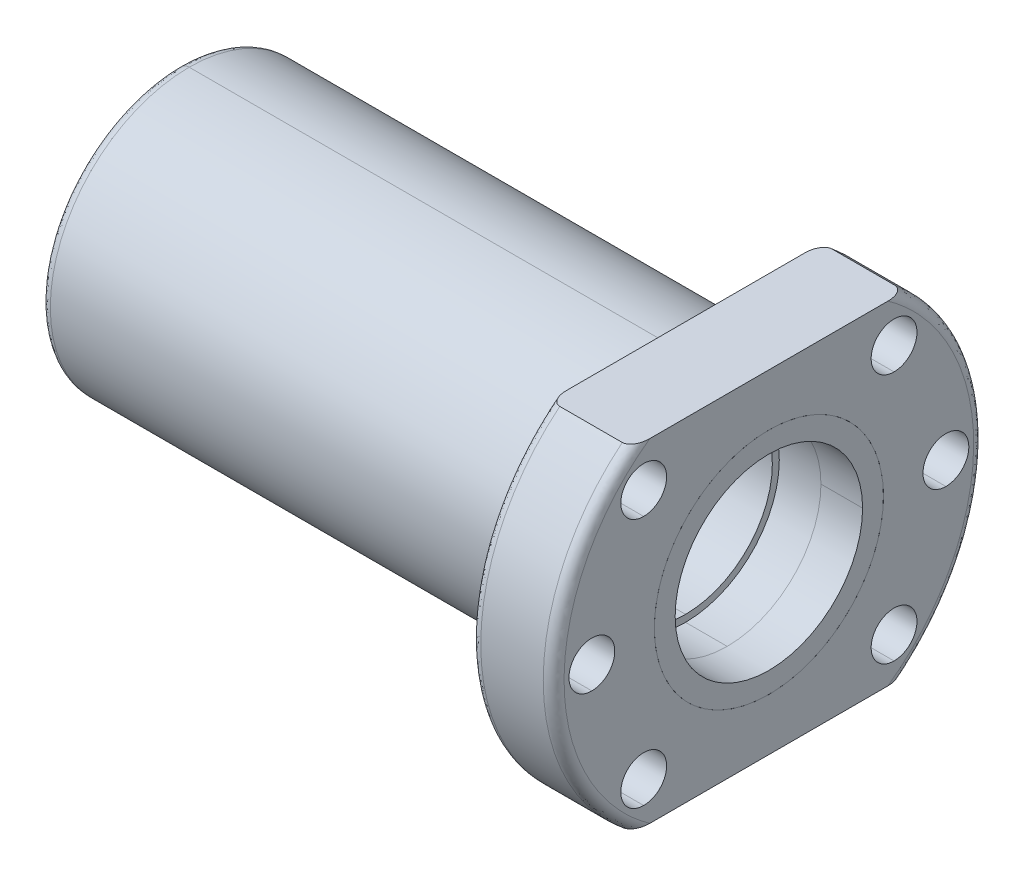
ISO-10303-21;
HEADER;
FILE_DESCRIPTION(('STEP AP214'),'2;1');
FILE_NAME('part.step','',(''),(''),'','','');
FILE_SCHEMA(('AUTOMOTIVE_DESIGN { 1 0 10303 214 1 1 1 1 }'));
ENDSEC;
DATA;
#1=APPLICATION_CONTEXT('core data for automotive mechanical design processes');
#2=APPLICATION_PROTOCOL_DEFINITION('international standard','automotive_design',2000,#1);
#3=PRODUCT_CONTEXT('',#1,'mechanical');
#4=PRODUCT('Part','Part','',(#3));
#5=PRODUCT_RELATED_PRODUCT_CATEGORY('part','',(#4));
#6=PRODUCT_DEFINITION_FORMATION('','',#4);
#7=PRODUCT_DEFINITION_CONTEXT('part definition',#1,'design');
#8=PRODUCT_DEFINITION('design','',#6,#7);
#9=PRODUCT_DEFINITION_SHAPE('','',#8);
#10=(LENGTH_UNIT() NAMED_UNIT(*) SI_UNIT(.MILLI.,.METRE.));
#11=(NAMED_UNIT(*) PLANE_ANGLE_UNIT() SI_UNIT($,.RADIAN.));
#12=(NAMED_UNIT(*) SI_UNIT($,.STERADIAN.) SOLID_ANGLE_UNIT());
#13=UNCERTAINTY_MEASURE_WITH_UNIT(LENGTH_MEASURE(1.E-05),#10,'distance_accuracy_value','');
#14=(GEOMETRIC_REPRESENTATION_CONTEXT(3) GLOBAL_UNCERTAINTY_ASSIGNED_CONTEXT((#13)) GLOBAL_UNIT_ASSIGNED_CONTEXT((#10,
#11,#12)) REPRESENTATION_CONTEXT('',''));
#15=CARTESIAN_POINT('',(0.,0.,0.));
#16=DIRECTION('',(0.,0.,1.));
#17=DIRECTION('',(1.,0.,0.));
#18=AXIS2_PLACEMENT_3D('',#15,#16,#17);
#19=CARTESIAN_POINT('',(-27.0000000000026,0.,0.));
#20=DIRECTION('',(-1.,0.,0.));
#21=DIRECTION('',(0.,0.,1.));
#22=AXIS2_PLACEMENT_3D('',#19,#20,#21);
#23=PLANE('',#22);
#24=CARTESIAN_POINT('',(-27.0000000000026,0.,0.));
#25=DIRECTION('',(-1.,0.,0.));
#26=DIRECTION('',(0.,-1.,0.));
#27=AXIS2_PLACEMENT_3D('',#24,#25,#26);
#28=CIRCLE('',#27,12.5);
#29=CARTESIAN_POINT('',(-27.0000000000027,-12.5,0.));
#30=VERTEX_POINT('',#29);
#31=CARTESIAN_POINT('',(-27.0000000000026,12.5,0.));
#32=VERTEX_POINT('',#31);
#33=EDGE_CURVE('P0_E11',#30,#32,#28,.T.);
#34=ORIENTED_EDGE('',*,*,#33,.T.);
#35=CARTESIAN_POINT('',(-27.0000000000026,0.,0.));
#36=DIRECTION('',(-1.,0.,0.));
#37=DIRECTION('',(0.,-1.,0.));
#38=AXIS2_PLACEMENT_3D('',#35,#36,#37);
#39=CIRCLE('',#38,12.5);
#40=EDGE_CURVE('P0_E296',#32,#30,#39,.T.);
#41=ORIENTED_EDGE('',*,*,#40,.T.);
#42=EDGE_LOOP('',(#34,#41));
#43=FACE_BOUND('',#42,.T.);
#44=CARTESIAN_POINT('',(-27.0000000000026,0.,0.));
#45=DIRECTION('',(1.,0.,0.));
#46=DIRECTION('',(0.,-1.,0.));
#47=AXIS2_PLACEMENT_3D('',#44,#45,#46);
#48=CIRCLE('',#47,13.5);
#49=CARTESIAN_POINT('',(-27.0000000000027,-13.5,0.));
#50=VERTEX_POINT('',#49);
#51=CARTESIAN_POINT('',(-27.0000000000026,13.5,0.));
#52=VERTEX_POINT('',#51);
#53=EDGE_CURVE('P0_E324',#50,#52,#48,.T.);
#54=ORIENTED_EDGE('',*,*,#53,.T.);
#55=CARTESIAN_POINT('',(-27.0000000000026,0.,0.));
#56=DIRECTION('',(1.,0.,0.));
#57=DIRECTION('',(0.,-1.,0.));
#58=AXIS2_PLACEMENT_3D('',#55,#56,#57);
#59=CIRCLE('',#58,13.5);
#60=EDGE_CURVE('P0_E334',#52,#50,#59,.T.);
#61=ORIENTED_EDGE('',*,*,#60,.T.);
#62=EDGE_LOOP('',(#54,#61));
#63=FACE_BOUND('',#62,.T.);
#64=ADVANCED_FACE('P0_F17',(#43,#63),#23,.F.);
#65=CARTESIAN_POINT('',(0.,0.,0.));
#66=DIRECTION('',(-1.,0.,0.));
#67=DIRECTION('',(0.,-1.,0.));
#68=AXIS2_PLACEMENT_3D('',#65,#66,#67);
#69=CYLINDRICAL_SURFACE('',#68,12.5);
#70=DIRECTION('',(-1.,0.,0.));
#71=VECTOR('',#70,1.);
#72=CARTESIAN_POINT('',(0.,12.5,0.));
#73=LINE('',#72,#71);
#74=CARTESIAN_POINT('',(-98.5,12.5,0.));
#75=VERTEX_POINT('',#74);
#76=EDGE_CURVE('P0_E301',#32,#75,#73,.T.);
#77=ORIENTED_EDGE('',*,*,#76,.F.);
#78=ORIENTED_EDGE('',*,*,#33,.F.);
#79=DIRECTION('',(-1.,0.,0.));
#80=VECTOR('',#79,1.);
#81=CARTESIAN_POINT('',(0.,-12.5,0.));
#82=LINE('',#81,#80);
#83=CARTESIAN_POINT('',(-98.5,-12.5,0.));
#84=VERTEX_POINT('',#83);
#85=EDGE_CURVE('P0_E311',#30,#84,#82,.T.);
#86=ORIENTED_EDGE('',*,*,#85,.T.);
#87=CARTESIAN_POINT('',(-98.5,0.,0.));
#88=DIRECTION('',(-1.,0.,0.));
#89=DIRECTION('',(0.,1.,0.));
#90=AXIS2_PLACEMENT_3D('',#87,#88,#89);
#91=CIRCLE('',#90,12.5);
#92=EDGE_CURVE('P0_E303',#84,#75,#91,.T.);
#93=ORIENTED_EDGE('',*,*,#92,.T.);
#94=EDGE_LOOP('',(#77,#78,#86,#93));
#95=FACE_BOUND('',#94,.T.);
#96=ADVANCED_FACE('P0_F302',(#95),#69,.F.);
#97=CARTESIAN_POINT('',(-98.5,-20.0000000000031,0.));
#98=CARTESIAN_POINT('',(-98.5,-20.0000000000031,-40.0000000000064));
#99=CARTESIAN_POINT('',(-98.5,20.0000000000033,-40.0000000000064));
#100=CARTESIAN_POINT('',(-98.5,20.0000000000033,0.));
#101=CARTESIAN_POINT('',(-99.3786796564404,-20.0000000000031,0.));
#102=CARTESIAN_POINT('',(-99.3786796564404,-20.0000000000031,-40.0000000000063));
#103=CARTESIAN_POINT('',(-99.3786796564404,20.0000000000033,-40.0000000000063));
#104=CARTESIAN_POINT('',(-99.3786796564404,20.0000000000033,0.));
#105=CARTESIAN_POINT('',(-100.,-19.3786796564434,0.));
#106=CARTESIAN_POINT('',(-100.,-19.3786796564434,-38.757359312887));
#107=CARTESIAN_POINT('',(-100.,19.3786796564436,-38.7573593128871));
#108=CARTESIAN_POINT('',(-100.,19.3786796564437,0.));
#109=CARTESIAN_POINT('',(-100.,-18.5000000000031,0.));
#110=CARTESIAN_POINT('',(-100.,-18.5000000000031,-37.0000000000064));
#111=CARTESIAN_POINT('',(-100.,18.5000000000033,-37.0000000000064));
#112=CARTESIAN_POINT('',(-100.,18.5000000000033,0.));
#113=(BOUNDED_SURFACE() B_SPLINE_SURFACE(3,3,((#97,#98,#99,#100),(#101,#102,#103,#104),(#105,
#106,#107,#108),(#109,#110,#111,#112)),.UNSPECIFIED.,.F.,.F.,
.F.) B_SPLINE_SURFACE_WITH_KNOTS((4,4),(4,4),(0.,1.),(0.,1.),
.UNSPECIFIED.) GEOMETRIC_REPRESENTATION_ITEM() RATIONAL_B_SPLINE_SURFACE(((1.,0.333333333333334,
0.333333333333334,1.),(0.804737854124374,0.268245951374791,0.268245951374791,0.804737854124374),
(0.804737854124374,0.268245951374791,0.268245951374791,0.804737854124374),(1.,0.333333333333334,
0.333333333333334,1.))) REPRESENTATION_ITEM('') SURFACE());
#114=CARTESIAN_POINT('',(-98.5,0.,0.));
#115=DIRECTION('',(1.,0.,0.));
#116=DIRECTION('',(0.,1.,0.));
#117=AXIS2_PLACEMENT_3D('',#114,#115,#116);
#118=CIRCLE('',#117,20.0000000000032);
#119=CARTESIAN_POINT('',(-98.5,-20.0000000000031,0.));
#120=VERTEX_POINT('',#119);
#121=CARTESIAN_POINT('',(-98.5,20.0000000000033,0.));
#122=VERTEX_POINT('',#121);
#123=EDGE_CURVE('P0_E28',#120,#122,#118,.T.);
#124=CARTESIAN_POINT('',(-98.5,-18.500000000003,0.));
#125=DIRECTION('',(0.,0.,-1.));
#126=DIRECTION('',(0.,-1.,0.));
#127=AXIS2_PLACEMENT_3D('',#124,#125,#126);
#128=CIRCLE('',#127,1.50000000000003);
#129=CARTESIAN_POINT('',(-100.,-18.5000000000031,0.));
#130=VERTEX_POINT('',#129);
#131=EDGE_CURVE('P0_E393',#120,#130,#128,.T.);
#132=CARTESIAN_POINT('',(-100.,-18.5000000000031,0.));
#133=CARTESIAN_POINT('',(-100.,-18.5000000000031,-37.0000000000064));
#134=CARTESIAN_POINT('',(-100.,18.5000000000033,-37.0000000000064));
#135=CARTESIAN_POINT('',(-100.,18.5000000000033,0.));
#136=(BOUNDED_CURVE() B_SPLINE_CURVE(3,(#132,#133,#134,#135),.UNSPECIFIED.,.F.,
.F.) B_SPLINE_CURVE_WITH_KNOTS((4,4),(0.,1.),
.UNSPECIFIED.) CURVE() GEOMETRIC_REPRESENTATION_ITEM() RATIONAL_B_SPLINE_CURVE((1.,
0.333333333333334,0.333333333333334,1.)) REPRESENTATION_ITEM(''));
#137=CARTESIAN_POINT('',(-100.,18.5000000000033,0.));
#138=VERTEX_POINT('',#137);
#139=EDGE_CURVE('P0_E484',#130,#138,#136,.T.);
#140=CARTESIAN_POINT('',(-98.5,18.5000000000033,0.));
#141=DIRECTION('',(0.,0.,1.));
#142=DIRECTION('',(0.,1.,0.));
#143=AXIS2_PLACEMENT_3D('',#140,#141,#142);
#144=CIRCLE('',#143,1.50000000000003);
#145=EDGE_CURVE('P0_E435',#122,#138,#144,.T.);
#146=ORIENTED_EDGE('',*,*,#123,.F.);
#147=ORIENTED_EDGE('',*,*,#131,.T.);
#148=ORIENTED_EDGE('',*,*,#139,.T.);
#149=ORIENTED_EDGE('',*,*,#145,.F.);
#150=EDGE_LOOP('',(#146,#147,#148,#149));
#151=FACE_BOUND('',#150,.T.);
#152=ADVANCED_FACE('P0_F849',(#151),#113,.T.);
#153=CARTESIAN_POINT('',(-98.5,0.,0.));
#154=DIRECTION('',(1.,0.,0.));
#155=DIRECTION('',(0.,1.,0.));
#156=AXIS2_PLACEMENT_3D('',#153,#154,#155);
#157=CYLINDRICAL_SURFACE('',#156,20.0000000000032);
#158=DIRECTION('',(1.,0.,0.));
#159=VECTOR('',#158,1.);
#160=CARTESIAN_POINT('',(-98.5,-20.0000000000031,0.));
#161=LINE('',#160,#159);
#162=CARTESIAN_POINT('',(-27.0000000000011,-20.0000000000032,0.));
#163=VERTEX_POINT('',#162);
#164=EDGE_CURVE('P0_E360',#120,#163,#161,.T.);
#165=ORIENTED_EDGE('',*,*,#164,.F.);
#166=ORIENTED_EDGE('',*,*,#123,.T.);
#167=DIRECTION('',(1.,0.,0.));
#168=VECTOR('',#167,1.);
#169=CARTESIAN_POINT('',(-98.5,20.0000000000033,0.));
#170=LINE('',#169,#168);
#171=CARTESIAN_POINT('',(-27.0000000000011,20.0000000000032,0.));
#172=VERTEX_POINT('',#171);
#173=EDGE_CURVE('P0_E359',#122,#172,#170,.T.);
#174=ORIENTED_EDGE('',*,*,#173,.T.);
#175=CARTESIAN_POINT('',(-27.0000000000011,0.,0.));
#176=DIRECTION('',(-1.,0.,0.));
#177=DIRECTION('',(0.,1.,0.));
#178=AXIS2_PLACEMENT_3D('',#175,#176,#177);
#179=CIRCLE('',#178,20.0000000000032);
#180=EDGE_CURVE('P0_E387',#172,#163,#179,.T.);
#181=ORIENTED_EDGE('',*,*,#180,.T.);
#182=EDGE_LOOP('',(#165,#166,#174,#181));
#183=FACE_BOUND('',#182,.T.);
#184=ADVANCED_FACE('P0_F854',(#183),#157,.T.);
#185=CARTESIAN_POINT('',(-15.,18.03,18.03));
#186=DIRECTION('',(-1.,0.,0.));
#187=DIRECTION('',(0.,-1.,0.));
#188=AXIS2_PLACEMENT_3D('',#185,#186,#187);
#189=CYLINDRICAL_SURFACE('',#188,3.3);
#190=CARTESIAN_POINT('',(-15.,18.03,18.03));
#191=DIRECTION('',(-1.,0.,0.));
#192=DIRECTION('',(0.,-1.,0.));
#193=AXIS2_PLACEMENT_3D('',#190,#191,#192);
#194=CIRCLE('',#193,3.3);
#195=CARTESIAN_POINT('',(-15.,21.33,18.03));
#196=VERTEX_POINT('',#195);
#197=CARTESIAN_POINT('',(-15.,14.73,18.03));
#198=VERTEX_POINT('',#197);
#199=EDGE_CURVE('P0_E52',#196,#198,#194,.T.);
#200=ORIENTED_EDGE('',*,*,#199,.F.);
#201=DIRECTION('',(-1.,0.,0.));
#202=VECTOR('',#201,1.);
#203=CARTESIAN_POINT('',(-15.,21.33,18.03));
#204=LINE('',#203,#202);
#205=CARTESIAN_POINT('',(-27.0000000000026,21.33,18.03));
#206=VERTEX_POINT('',#205);
#207=EDGE_CURVE('P0_E523',#196,#206,#204,.T.);
#208=ORIENTED_EDGE('',*,*,#207,.T.);
#209=CARTESIAN_POINT('',(-27.0000000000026,18.03,18.03));
#210=DIRECTION('',(-1.,0.,0.));
#211=DIRECTION('',(0.,-1.,0.));
#212=AXIS2_PLACEMENT_3D('',#209,#210,#211);
#213=CIRCLE('',#212,3.3);
#214=CARTESIAN_POINT('',(-27.0000000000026,14.73,18.03));
#215=VERTEX_POINT('',#214);
#216=EDGE_CURVE('P0_E42',#206,#215,#213,.T.);
#217=ORIENTED_EDGE('',*,*,#216,.T.);
#218=DIRECTION('',(-1.,0.,0.));
#219=VECTOR('',#218,1.);
#220=CARTESIAN_POINT('',(-15.,14.73,18.03));
#221=LINE('',#220,#219);
#222=EDGE_CURVE('P0_E394',#198,#215,#221,.T.);
#223=ORIENTED_EDGE('',*,*,#222,.F.);
#224=EDGE_LOOP('',(#200,#208,#217,#223));
#225=FACE_BOUND('',#224,.T.);
#226=ADVANCED_FACE('P0_F1380',(#225),#189,.F.);
#227=CARTESIAN_POINT('',(-15.,-18.03,18.03));
#228=DIRECTION('',(-1.,0.,0.));
#229=DIRECTION('',(0.,-1.,0.));
#230=AXIS2_PLACEMENT_3D('',#227,#228,#229);
#231=CYLINDRICAL_SURFACE('',#230,3.3);
#232=CARTESIAN_POINT('',(-15.,-18.03,18.03));
#233=DIRECTION('',(-1.,0.,0.));
#234=DIRECTION('',(0.,-1.,0.));
#235=AXIS2_PLACEMENT_3D('',#232,#233,#234);
#236=CIRCLE('',#235,3.3);
#237=CARTESIAN_POINT('',(-15.,-14.73,18.03));
#238=VERTEX_POINT('',#237);
#239=CARTESIAN_POINT('',(-15.,-21.33,18.03));
#240=VERTEX_POINT('',#239);
#241=EDGE_CURVE('P0_E410',#238,#240,#236,.T.);
#242=ORIENTED_EDGE('',*,*,#241,.F.);
#243=DIRECTION('',(-1.,0.,0.));
#244=VECTOR('',#243,1.);
#245=CARTESIAN_POINT('',(-15.,-14.73,18.03));
#246=LINE('',#245,#244);
#247=CARTESIAN_POINT('',(-27.0000000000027,-14.73,18.03));
#248=VERTEX_POINT('',#247);
#249=EDGE_CURVE('P0_E534',#238,#248,#246,.T.);
#250=ORIENTED_EDGE('',*,*,#249,.T.);
#251=CARTESIAN_POINT('',(-27.0000000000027,-18.03,18.03));
#252=DIRECTION('',(-1.,0.,0.));
#253=DIRECTION('',(0.,-1.,0.));
#254=AXIS2_PLACEMENT_3D('',#251,#252,#253);
#255=CIRCLE('',#254,3.3);
#256=CARTESIAN_POINT('',(-27.0000000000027,-21.33,18.03));
#257=VERTEX_POINT('',#256);
#258=EDGE_CURVE('P0_E388',#248,#257,#255,.T.);
#259=ORIENTED_EDGE('',*,*,#258,.T.);
#260=DIRECTION('',(-1.,0.,0.));
#261=VECTOR('',#260,1.);
#262=CARTESIAN_POINT('',(-15.,-21.33,18.03));
#263=LINE('',#262,#261);
#264=EDGE_CURVE('P0_E542',#240,#257,#263,.T.);
#265=ORIENTED_EDGE('',*,*,#264,.F.);
#266=EDGE_LOOP('',(#242,#250,#259,#265));
#267=FACE_BOUND('',#266,.T.);
#268=ADVANCED_FACE('P0_F1655',(#267),#231,.F.);
#269=CARTESIAN_POINT('',(-15.,-18.03,-18.03));
#270=DIRECTION('',(-1.,0.,0.));
#271=DIRECTION('',(0.,-1.,0.));
#272=AXIS2_PLACEMENT_3D('',#269,#270,#271);
#273=CYLINDRICAL_SURFACE('',#272,3.3);
#274=CARTESIAN_POINT('',(-15.,-18.03,-18.03));
#275=DIRECTION('',(-1.,0.,0.));
#276=DIRECTION('',(0.,-1.,0.));
#277=AXIS2_PLACEMENT_3D('',#274,#275,#276);
#278=CIRCLE('',#277,3.3);
#279=CARTESIAN_POINT('',(-15.,-14.73,-18.03));
#280=VERTEX_POINT('',#279);
#281=CARTESIAN_POINT('',(-15.,-21.33,-18.03));
#282=VERTEX_POINT('',#281);
#283=EDGE_CURVE('P0_E416',#280,#282,#278,.T.);
#284=ORIENTED_EDGE('',*,*,#283,.F.);
#285=DIRECTION('',(-1.,0.,0.));
#286=VECTOR('',#285,1.);
#287=CARTESIAN_POINT('',(-15.,-14.73,-18.03));
#288=LINE('',#287,#286);
#289=CARTESIAN_POINT('',(-27.0000000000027,-14.73,-18.03));
#290=VERTEX_POINT('',#289);
#291=EDGE_CURVE('P0_E381',#280,#290,#288,.T.);
#292=ORIENTED_EDGE('',*,*,#291,.T.);
#293=CARTESIAN_POINT('',(-27.0000000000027,-18.03,-18.03));
#294=DIRECTION('',(-1.,0.,0.));
#295=DIRECTION('',(0.,-1.,0.));
#296=AXIS2_PLACEMENT_3D('',#293,#294,#295);
#297=CIRCLE('',#296,3.3);
#298=CARTESIAN_POINT('',(-27.0000000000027,-21.33,-18.03));
#299=VERTEX_POINT('',#298);
#300=EDGE_CURVE('P0_E454',#290,#299,#297,.T.);
#301=ORIENTED_EDGE('',*,*,#300,.T.);
#302=DIRECTION('',(-1.,0.,0.));
#303=VECTOR('',#302,1.);
#304=CARTESIAN_POINT('',(-15.,-21.33,-18.03));
#305=LINE('',#304,#303);
#306=EDGE_CURVE('P0_E380',#282,#299,#305,.T.);
#307=ORIENTED_EDGE('',*,*,#306,.F.);
#308=EDGE_LOOP('',(#284,#292,#301,#307));
#309=FACE_BOUND('',#308,.T.);
#310=ADVANCED_FACE('P0_F879',(#309),#273,.F.);
#311=CARTESIAN_POINT('',(-15.,18.03,-18.03));
#312=DIRECTION('',(-1.,0.,0.));
#313=DIRECTION('',(0.,-1.,0.));
#314=AXIS2_PLACEMENT_3D('',#311,#312,#313);
#315=CYLINDRICAL_SURFACE('',#314,3.3);
#316=CARTESIAN_POINT('',(-15.,18.03,-18.03));
#317=DIRECTION('',(-1.,0.,0.));
#318=DIRECTION('',(0.,-1.,0.));
#319=AXIS2_PLACEMENT_3D('',#316,#317,#318);
#320=CIRCLE('',#319,3.3);
#321=CARTESIAN_POINT('',(-15.,21.33,-18.03));
#322=VERTEX_POINT('',#321);
#323=CARTESIAN_POINT('',(-15.,14.73,-18.03));
#324=VERTEX_POINT('',#323);
#325=EDGE_CURVE('P0_E419',#322,#324,#320,.T.);
#326=ORIENTED_EDGE('',*,*,#325,.F.);
#327=DIRECTION('',(-1.,0.,0.));
#328=VECTOR('',#327,1.);
#329=CARTESIAN_POINT('',(-15.,21.33,-18.03));
#330=LINE('',#329,#328);
#331=CARTESIAN_POINT('',(-27.0000000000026,21.33,-18.03));
#332=VERTEX_POINT('',#331);
#333=EDGE_CURVE('P0_E515',#322,#332,#330,.T.);
#334=ORIENTED_EDGE('',*,*,#333,.T.);
#335=CARTESIAN_POINT('',(-27.0000000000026,18.03,-18.03));
#336=DIRECTION('',(-1.,0.,0.));
#337=DIRECTION('',(0.,-1.,0.));
#338=AXIS2_PLACEMENT_3D('',#335,#336,#337);
#339=CIRCLE('',#338,3.3);
#340=CARTESIAN_POINT('',(-27.0000000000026,14.73,-18.03));
#341=VERTEX_POINT('',#340);
#342=EDGE_CURVE('P0_E432',#332,#341,#339,.T.);
#343=ORIENTED_EDGE('',*,*,#342,.T.);
#344=DIRECTION('',(-1.,0.,0.));
#345=VECTOR('',#344,1.);
#346=CARTESIAN_POINT('',(-15.,14.73,-18.03));
#347=LINE('',#346,#345);
#348=EDGE_CURVE('P0_E463',#324,#341,#347,.T.);
#349=ORIENTED_EDGE('',*,*,#348,.F.);
#350=EDGE_LOOP('',(#326,#334,#343,#349));
#351=FACE_BOUND('',#350,.T.);
#352=ADVANCED_FACE('P0_F876',(#351),#315,.F.);
#353=CARTESIAN_POINT('',(-15.,0.,25.5));
#354=DIRECTION('',(-1.,0.,0.));
#355=DIRECTION('',(0.,-1.,0.));
#356=AXIS2_PLACEMENT_3D('',#353,#354,#355);
#357=CYLINDRICAL_SURFACE('',#356,3.3);
#358=CARTESIAN_POINT('',(-15.,0.,25.5));
#359=DIRECTION('',(-1.,0.,0.));
#360=DIRECTION('',(0.,-1.,0.));
#361=AXIS2_PLACEMENT_3D('',#358,#359,#360);
#362=CIRCLE('',#361,3.3);
#363=CARTESIAN_POINT('',(-15.,3.3,25.5));
#364=VERTEX_POINT('',#363);
#365=CARTESIAN_POINT('',(-15.,-3.3,25.5));
#366=VERTEX_POINT('',#365);
#367=EDGE_CURVE('P0_E420',#364,#366,#362,.T.);
#368=ORIENTED_EDGE('',*,*,#367,.F.);
#369=DIRECTION('',(-1.,0.,0.));
#370=VECTOR('',#369,1.);
#371=CARTESIAN_POINT('',(-15.,3.3,25.5));
#372=LINE('',#371,#370);
#373=CARTESIAN_POINT('',(-27.0000000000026,3.30000000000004,25.5));
#374=VERTEX_POINT('',#373);
#375=EDGE_CURVE('P0_E323',#364,#374,#372,.T.);
#376=ORIENTED_EDGE('',*,*,#375,.T.);
#377=CARTESIAN_POINT('',(-27.0000000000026,0.,25.5));
#378=DIRECTION('',(-1.,0.,0.));
#379=DIRECTION('',(0.,-1.,0.));
#380=AXIS2_PLACEMENT_3D('',#377,#378,#379);
#381=CIRCLE('',#380,3.3);
#382=CARTESIAN_POINT('',(-27.0000000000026,-3.29999999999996,25.5));
#383=VERTEX_POINT('',#382);
#384=EDGE_CURVE('P0_E414',#374,#383,#381,.T.);
#385=ORIENTED_EDGE('',*,*,#384,.T.);
#386=DIRECTION('',(-1.,0.,0.));
#387=VECTOR('',#386,1.);
#388=CARTESIAN_POINT('',(-15.,-3.3,25.5));
#389=LINE('',#388,#387);
#390=EDGE_CURVE('P0_E322',#366,#383,#389,.T.);
#391=ORIENTED_EDGE('',*,*,#390,.F.);
#392=EDGE_LOOP('',(#368,#376,#385,#391));
#393=FACE_BOUND('',#392,.T.);
#394=ADVANCED_FACE('P0_F878',(#393),#357,.F.);
#395=CARTESIAN_POINT('',(-15.,0.,-25.5));
#396=DIRECTION('',(-1.,0.,0.));
#397=DIRECTION('',(0.,-1.,0.));
#398=AXIS2_PLACEMENT_3D('',#395,#396,#397);
#399=CYLINDRICAL_SURFACE('',#398,3.3);
#400=CARTESIAN_POINT('',(-15.,0.,-25.5));
#401=DIRECTION('',(-1.,0.,0.));
#402=DIRECTION('',(0.,-1.,0.));
#403=AXIS2_PLACEMENT_3D('',#400,#401,#402);
#404=CIRCLE('',#403,3.3);
#405=CARTESIAN_POINT('',(-15.,3.3,-25.5));
#406=VERTEX_POINT('',#405);
#407=CARTESIAN_POINT('',(-15.,-3.3,-25.5));
#408=VERTEX_POINT('',#407);
#409=EDGE_CURVE('P0_E423',#406,#408,#404,.T.);
#410=ORIENTED_EDGE('',*,*,#409,.F.);
#411=DIRECTION('',(-1.,0.,0.));
#412=VECTOR('',#411,1.);
#413=CARTESIAN_POINT('',(-15.,3.3,-25.5));
#414=LINE('',#413,#412);
#415=CARTESIAN_POINT('',(-27.0000000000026,3.30000000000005,-25.5));
#416=VERTEX_POINT('',#415);
#417=EDGE_CURVE('P0_E395',#406,#416,#414,.T.);
#418=ORIENTED_EDGE('',*,*,#417,.T.);
#419=CARTESIAN_POINT('',(-27.0000000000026,0.,-25.5));
#420=DIRECTION('',(-1.,0.,0.));
#421=DIRECTION('',(0.,-1.,0.));
#422=AXIS2_PLACEMENT_3D('',#419,#420,#421);
#423=CIRCLE('',#422,3.3);
#424=CARTESIAN_POINT('',(-27.0000000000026,-3.29999999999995,-25.5));
#425=VERTEX_POINT('',#424);
#426=EDGE_CURVE('P0_E411',#416,#425,#423,.T.);
#427=ORIENTED_EDGE('',*,*,#426,.T.);
#428=DIRECTION('',(-1.,0.,0.));
#429=VECTOR('',#428,1.);
#430=CARTESIAN_POINT('',(-15.,-3.3,-25.5));
#431=LINE('',#430,#429);
#432=EDGE_CURVE('P0_E467',#408,#425,#431,.T.);
#433=ORIENTED_EDGE('',*,*,#432,.F.);
#434=EDGE_LOOP('',(#410,#418,#427,#433));
#435=FACE_BOUND('',#434,.T.);
#436=ADVANCED_FACE('P0_F1512',(#435),#399,.F.);
#437=CARTESIAN_POINT('',(-94.,0.,0.));
#438=DIRECTION('',(-1.,0.,0.));
#439=DIRECTION('',(0.,0.,1.));
#440=AXIS2_PLACEMENT_3D('',#437,#438,#439);
#441=CYLINDRICAL_SURFACE('',#440,13.5);
#442=CARTESIAN_POINT('',(-98.5,0.,0.));
#443=DIRECTION('',(-1.,0.,0.));
#444=DIRECTION('',(0.,0.,1.));
#445=AXIS2_PLACEMENT_3D('',#442,#443,#444);
#446=CIRCLE('',#445,13.5);
#447=CARTESIAN_POINT('',(-98.5,1.0052283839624E-13,-13.5));
#448=VERTEX_POINT('',#447);
#449=CARTESIAN_POINT('',(-98.5,0.,13.5));
#450=VERTEX_POINT('',#449);
#451=EDGE_CURVE('P0_E439',#448,#450,#446,.T.);
#452=ORIENTED_EDGE('',*,*,#451,.F.);
#453=DIRECTION('',(-1.,0.,0.));
#454=VECTOR('',#453,1.);
#455=CARTESIAN_POINT('',(-94.,1.0052283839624E-13,-13.5));
#456=LINE('',#455,#454);
#457=CARTESIAN_POINT('',(-100.,1.0052283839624E-13,-13.5));
#458=VERTEX_POINT('',#457);
#459=EDGE_CURVE('P0_E337',#448,#458,#456,.T.);
#460=ORIENTED_EDGE('',*,*,#459,.T.);
#461=CARTESIAN_POINT('',(-100.,0.,0.));
#462=DIRECTION('',(1.,0.,0.));
#463=DIRECTION('',(0.,0.,1.));
#464=AXIS2_PLACEMENT_3D('',#461,#462,#463);
#465=CIRCLE('',#464,13.5);
#466=CARTESIAN_POINT('',(-100.,0.,13.5));
#467=VERTEX_POINT('',#466);
#468=EDGE_CURVE('P0_E400',#467,#458,#465,.T.);
#469=ORIENTED_EDGE('',*,*,#468,.F.);
#470=DIRECTION('',(-1.,0.,0.));
#471=VECTOR('',#470,1.);
#472=CARTESIAN_POINT('',(-94.,0.,13.5));
#473=LINE('',#472,#471);
#474=EDGE_CURVE('P0_E341',#450,#467,#473,.T.);
#475=ORIENTED_EDGE('',*,*,#474,.F.);
#476=EDGE_LOOP('',(#452,#460,#469,#475));
#477=FACE_BOUND('',#476,.T.);
#478=ADVANCED_FACE('P0_F1626',(#477),#441,.F.);
#479=CARTESIAN_POINT('',(-115.,1.137E-13,0.));
#480=DIRECTION('',(1.,0.,0.));
#481=DIRECTION('',(0.,1.,0.));
#482=AXIS2_PLACEMENT_3D('',#479,#480,#481);
#483=CYLINDRICAL_SURFACE('',#482,16.5000000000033);
#484=CARTESIAN_POINT('',(-21.0000000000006,0.,0.));
#485=DIRECTION('',(1.,0.,0.));
#486=DIRECTION('',(0.,1.,0.));
#487=AXIS2_PLACEMENT_3D('',#484,#485,#486);
#488=CIRCLE('',#487,16.5000000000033);
#489=CARTESIAN_POINT('',(-21.0000000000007,-16.5000000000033,0.));
#490=VERTEX_POINT('',#489);
#491=CARTESIAN_POINT('',(-21.0000000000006,16.5000000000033,0.));
#492=VERTEX_POINT('',#491);
#493=EDGE_CURVE('P0_E347',#490,#492,#488,.T.);
#494=ORIENTED_EDGE('',*,*,#493,.F.);
#495=DIRECTION('',(1.,0.,0.));
#496=VECTOR('',#495,1.);
#497=CARTESIAN_POINT('',(-115.,-16.5000000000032,0.));
#498=LINE('',#497,#496);
#499=CARTESIAN_POINT('',(-15.,-16.5000000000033,0.));
#500=VERTEX_POINT('',#499);
#501=EDGE_CURVE('P0_E449',#490,#500,#498,.T.);
#502=ORIENTED_EDGE('',*,*,#501,.T.);
#503=CARTESIAN_POINT('',(-15.,0.,0.));
#504=DIRECTION('',(-1.,0.,0.));
#505=DIRECTION('',(0.,1.,0.));
#506=AXIS2_PLACEMENT_3D('',#503,#504,#505);
#507=CIRCLE('',#506,16.5000000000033);
#508=CARTESIAN_POINT('',(-15.,16.5000000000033,0.));
#509=VERTEX_POINT('',#508);
#510=EDGE_CURVE('P0_E373',#509,#500,#507,.T.);
#511=ORIENTED_EDGE('',*,*,#510,.F.);
#512=DIRECTION('',(1.,0.,0.));
#513=VECTOR('',#512,1.);
#514=CARTESIAN_POINT('',(-115.,16.5000000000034,0.));
#515=LINE('',#514,#513);
#516=EDGE_CURVE('P0_E453',#492,#509,#515,.T.);
#517=ORIENTED_EDGE('',*,*,#516,.F.);
#518=EDGE_LOOP('',(#494,#502,#511,#517));
#519=FACE_BOUND('',#518,.T.);
#520=ADVANCED_FACE('P0_F895',(#519),#483,.F.);
#521=CARTESIAN_POINT('',(-15.,24.1940387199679,16.8789362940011));
#522=CARTESIAN_POINT('',(-15.,11.2827718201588,35.3857714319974));
#523=CARTESIAN_POINT('',(-15.,-11.2827718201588,35.3857714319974));
#524=CARTESIAN_POINT('',(-15.,-24.1940387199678,16.8789362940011));
#525=CARTESIAN_POINT('',(-15.,24.9146763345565,17.3816880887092));
#526=CARTESIAN_POINT('',(-15.,11.618837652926,36.4397632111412));
#527=CARTESIAN_POINT('',(-15.,-11.6188376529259,36.4397632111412));
#528=CARTESIAN_POINT('',(-15.,-24.9146763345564,17.3816880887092));
#529=CARTESIAN_POINT('',(-15.6213203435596,25.4242440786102,17.737187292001));
#530=CARTESIAN_POINT('',(-15.6213203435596,11.8564720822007,37.1850479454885));
#531=CARTESIAN_POINT('',(-15.6213203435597,-11.8564720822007,37.1850479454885));
#532=CARTESIAN_POINT('',(-15.6213203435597,-25.4242440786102,17.737187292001));
#533=CARTESIAN_POINT('',(-16.5,25.4242440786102,17.737187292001));
#534=CARTESIAN_POINT('',(-16.5,11.8564720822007,37.1850479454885));
#535=CARTESIAN_POINT('',(-16.5,-11.8564720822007,37.1850479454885));
#536=CARTESIAN_POINT('',(-16.5,-25.4242440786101,17.737187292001));
#537=(BOUNDED_SURFACE() B_SPLINE_SURFACE(3,3,((#521,#522,#523,#524),(#525,#526,#527,#528),(#529,
#530,#531,#532),(#533,#534,#535,#536)),.UNSPECIFIED.,.F.,.F.,
.F.) B_SPLINE_SURFACE_WITH_KNOTS((4,4),(4,4),(0.,1.),(0.,1.),
.UNSPECIFIED.) GEOMETRIC_REPRESENTATION_ITEM() RATIONAL_B_SPLINE_SURFACE(((1.,0.714778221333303,
0.714778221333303,1.),(0.804737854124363,0.575209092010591,0.575209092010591,0.804737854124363),
(0.804737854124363,0.575209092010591,0.575209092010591,0.804737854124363),(1.,0.714778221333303,
0.714778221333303,1.))) REPRESENTATION_ITEM('') SURFACE());
#538=CARTESIAN_POINT('',(-16.5,0.,0.));
#539=DIRECTION('',(-1.,0.,0.));
#540=DIRECTION('',(0.,1.,0.));
#541=AXIS2_PLACEMENT_3D('',#538,#539,#540);
#542=CIRCLE('',#541,31.0000000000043);
#543=CARTESIAN_POINT('',(-16.5,-24.,19.6214168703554));
#544=VERTEX_POINT('',#543);
#545=CARTESIAN_POINT('',(-16.5,24.,19.6214168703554));
#546=VERTEX_POINT('',#545);
#547=EDGE_CURVE('P0_E734',#544,#546,#542,.T.);
#548=CARTESIAN_POINT('',(-16.5,-24.,19.6214168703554));
#549=CARTESIAN_POINT('',(-16.4847672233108,-24.0000001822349,19.6214174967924));
#550=CARTESIAN_POINT('',(-16.4695351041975,-24.0000103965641,19.6210375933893));
#551=CARTESIAN_POINT('',(-16.4389880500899,-24.0000444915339,19.6195250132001));
#552=CARTESIAN_POINT('',(-16.4236734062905,-24.0000684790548,19.6183864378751));
#553=CARTESIAN_POINT('',(-16.3929832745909,-24.0001237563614,19.6153518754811));
#554=CARTESIAN_POINT('',(-16.3776084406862,-24.0001551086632,19.6134492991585));
#555=CARTESIAN_POINT('',(-16.3468200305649,-24.0002198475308,19.6088838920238));
#556=CARTESIAN_POINT('',(-16.3314075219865,-24.0002532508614,19.6062138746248));
#557=CARTESIAN_POINT('',(-16.3005665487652,-24.0003176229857,19.6001113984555));
#558=CARTESIAN_POINT('',(-16.2851396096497,-24.0003485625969,19.5966712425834));
#559=CARTESIAN_POINT('',(-16.2542929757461,-24.0004044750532,19.5890273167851));
#560=CARTESIAN_POINT('',(-16.2388752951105,-24.0004293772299,19.5848154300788));
#561=CARTESIAN_POINT('',(-16.2080707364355,-24.0004706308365,19.5756278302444));
#562=CARTESIAN_POINT('',(-16.1926863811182,-24.0004868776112,19.5706436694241));
#563=CARTESIAN_POINT('',(-16.1619722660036,-24.0005092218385,19.5599123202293));
#564=CARTESIAN_POINT('',(-16.1466455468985,-24.0005151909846,19.5541564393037));
#565=CARTESIAN_POINT('',(-16.1160706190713,-24.0005163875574,19.5418834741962));
#566=CARTESIAN_POINT('',(-16.1008259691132,-24.0005114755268,19.535357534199));
#567=CARTESIAN_POINT('',(-16.0704390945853,-24.0004913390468,19.5215473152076));
#568=CARTESIAN_POINT('',(-16.0553009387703,-24.0004759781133,19.5142540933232));
#569=CARTESIAN_POINT('',(-16.0251508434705,-24.0004364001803,19.4989132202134));
#570=CARTESIAN_POINT('',(-16.0101434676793,-24.0004120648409,19.4908566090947));
#571=CARTESIAN_POINT('',(-15.9802784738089,-24.0003570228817,19.4739939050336));
#572=CARTESIAN_POINT('',(-15.9654258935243,-24.0003262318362,19.4651788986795));
#573=CARTESIAN_POINT('',(-15.9358936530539,-24.0002617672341,19.4468053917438));
#574=CARTESIAN_POINT('',(-15.9212194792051,-24.0002280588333,19.4372380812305));
#575=CARTESIAN_POINT('',(-15.8920667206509,-24.0001622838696,19.4173669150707));
#576=CARTESIAN_POINT('',(-15.8775940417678,-24.0001302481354,19.4070544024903));
#577=CARTESIAN_POINT('',(-15.8488662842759,-24.0000731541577,19.385700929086));
#578=CARTESIAN_POINT('',(-15.8346174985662,-24.0000482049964,19.3746515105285));
#579=CARTESIAN_POINT('',(-15.8063589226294,-24.0000121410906,19.3518326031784));
#580=CARTESIAN_POINT('',(-15.7923557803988,-24.0000012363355,19.3400548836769));
#581=CARTESIAN_POINT('',(-15.7679088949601,-23.9999990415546,19.3186771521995));
#582=CARTESIAN_POINT('',(-15.7573725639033,-24.0000038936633,19.3091826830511));
#583=CARTESIAN_POINT('',(-15.7363497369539,-24.0000200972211,19.2896895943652));
#584=CARTESIAN_POINT('',(-15.7258692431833,-24.0000315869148,19.2796845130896));
#585=CARTESIAN_POINT('',(-15.6941893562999,-24.0000720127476,19.2485864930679));
#586=CARTESIAN_POINT('',(-15.6734496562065,-24.0001065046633,19.2270225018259));
#587=CARTESIAN_POINT('',(-15.6323003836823,-24.0001706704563,19.1819048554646));
#588=CARTESIAN_POINT('',(-15.6119409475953,-24.0002000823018,19.1583057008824));
#589=CARTESIAN_POINT('',(-15.5716566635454,-24.0002422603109,19.109124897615));
#590=CARTESIAN_POINT('',(-15.5517826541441,-24.0002543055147,19.0835016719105));
#591=CARTESIAN_POINT('',(-15.5125778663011,-24.0002571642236,19.0302904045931));
#592=CARTESIAN_POINT('',(-15.4932983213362,-24.0002471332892,19.0026647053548));
#593=CARTESIAN_POINT('',(-15.455390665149,-24.0002087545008,18.9454738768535));
#594=CARTESIAN_POINT('',(-15.436813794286,-24.0001797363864,18.9158748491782));
#595=CARTESIAN_POINT('',(-15.4004195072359,-24.0001162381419,18.8547712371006));
#596=CARTESIAN_POINT('',(-15.3826530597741,-24.0000815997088,18.8232363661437));
#597=CARTESIAN_POINT('',(-15.34798073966,-24.0000213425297,18.7583036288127));
#598=CARTESIAN_POINT('',(-15.3311251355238,-23.9999960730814,18.7248789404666));
#599=CARTESIAN_POINT('',(-15.303112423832,-24.0000029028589,18.666128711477));
#600=CARTESIAN_POINT('',(-15.2916155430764,-24.0000217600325,18.6409641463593));
#601=CARTESIAN_POINT('',(-15.2687777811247,-24.0000770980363,18.5888655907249));
#602=CARTESIAN_POINT('',(-15.257482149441,-24.000114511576,18.5619117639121));
#603=CARTESIAN_POINT('',(-15.2351481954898,-24.0001836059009,18.506241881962));
#604=CARTESIAN_POINT('',(-15.2241548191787,-24.0002148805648,18.4775078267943));
#605=CARTESIAN_POINT('',(-15.2025325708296,-24.0002603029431,18.4182899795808));
#606=CARTESIAN_POINT('',(-15.1919484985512,-24.0002735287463,18.3877898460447));
#607=CARTESIAN_POINT('',(-15.1712536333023,-24.0002767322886,18.3250605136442));
#608=CARTESIAN_POINT('',(-15.1611874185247,-24.000265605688,18.2928166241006));
#609=CARTESIAN_POINT('',(-15.141638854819,-24.0002257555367,18.2266282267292));
#610=CARTESIAN_POINT('',(-15.1322008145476,-24.0001962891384,18.1926706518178));
#611=CARTESIAN_POINT('',(-15.1140154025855,-24.0001226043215,18.1230917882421));
#612=CARTESIAN_POINT('',(-15.1053118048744,-24.0000778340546,18.0874590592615));
#613=CARTESIAN_POINT('',(-15.0887109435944,-24.0000325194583,18.0145740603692));
#614=CARTESIAN_POINT('',(-15.0808571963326,-24.0000337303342,17.9773119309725));
#615=CARTESIAN_POINT('',(-15.0608429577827,-23.9999410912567,17.8746657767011));
#616=CARTESIAN_POINT('',(-15.0498437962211,-23.9997756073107,17.8090524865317));
#617=CARTESIAN_POINT('',(-15.0312330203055,-23.999301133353,17.677730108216));
#618=CARTESIAN_POINT('',(-15.023602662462,-23.9989929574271,17.6120236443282));
#619=CARTESIAN_POINT('',(-15.0115871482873,-23.9986058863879,17.4807391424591));
#620=CARTESIAN_POINT('',(-15.0071815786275,-23.9985255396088,17.4151629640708));
#621=CARTESIAN_POINT('',(-15.0013965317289,-23.9988448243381,17.284332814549));
#622=CARTESIAN_POINT('',(-14.9999962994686,-23.9992411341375,17.2190797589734));
#623=CARTESIAN_POINT('',(-15.000000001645,-24.,17.1538376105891));
#624=B_SPLINE_CURVE_WITH_KNOTS('',3,(#548,#549,#550,#551,#552,#553,#554,#555,#556,#557,#558,
#559,#560,#561,#562,#563,#564,#565,#566,#567,#568,#569,#570,#571,#572,#573,#574,#575,#576,#577,
#578,#579,#580,#581,#582,#583,#584,#585,#586,#587,#588,#589,#590,#591,#592,#593,#594,#595,#596,
#597,#598,#599,#600,#601,#602,#603,#604,#605,#606,#607,#608,#609,#610,#611,#612,#613,#614,#615,
#616,#617,#618,#619,#620,#621,#622,#623),.UNSPECIFIED.,.F.,.F.,(4,2,2,2,2,2,2,2,2,2,2,2,2,2,2,2,
2,2,2,2,2,2,2,2,2,2,2,2,2,2,2,2,2,2,2,2,2,4),(0.,0.0456926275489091,0.0917447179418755,
0.138202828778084,0.185111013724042,0.232510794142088,0.280441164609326,0.328938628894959,
0.378037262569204,0.427768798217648,0.478162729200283,0.529246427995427,0.581045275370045,
0.63358279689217,0.686880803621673,0.740959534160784,0.79583779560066,0.838381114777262,
0.881844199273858,0.971550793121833,1.06501145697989,1.16225023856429,1.26327292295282,
1.36806947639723,1.47661631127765,1.58887840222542,1.67186496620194,1.75952511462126,
1.85180583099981,1.94864301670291,2.04996219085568,2.15567921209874,2.26570107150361,
2.37992679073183,2.57941765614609,2.77778415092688,2.97488383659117,3.17061790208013),.UNSPECIFIED.);
#625=CARTESIAN_POINT('',(-15.,-24.,17.1538376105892));
#626=VERTEX_POINT('',#625);
#627=EDGE_CURVE('P0_E791',#544,#626,#624,.T.);
#628=CARTESIAN_POINT('',(-15.,24.,17.1538919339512));
#629=CARTESIAN_POINT('',(-15.,23.2925339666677,18.1443287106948));
#630=CARTESIAN_POINT('',(-15.,22.5261519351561,19.0874052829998));
#631=CARTESIAN_POINT('',(-15.,21.2883291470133,20.4310686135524));
#632=CARTESIAN_POINT('',(-15.,20.8601058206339,20.8680479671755));
#633=CARTESIAN_POINT('',(-15.,19.9806345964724,21.7119073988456));
#634=CARTESIAN_POINT('',(-15.,19.0772139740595,22.5265927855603));
#635=CARTESIAN_POINT('',(-15.,17.8880647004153,23.4720144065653));
#636=CARTESIAN_POINT('',(-15.,17.0242266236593,24.095518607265));
#637=CARTESIAN_POINT('',(-15.,16.5844491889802,24.397697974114));
#638=CARTESIAN_POINT('',(-15.,16.3942892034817,24.5251521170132));
#639=CARTESIAN_POINT('',(-15.,16.2671416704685,24.6096657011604));
#640=CARTESIAN_POINT('',(-15.,16.2020414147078,24.6525698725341));
#641=CARTESIAN_POINT('',(-15.,15.1389156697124,25.3475081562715));
#642=CARTESIAN_POINT('',(-15.,13.5875802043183,26.2324788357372));
#643=CARTESIAN_POINT('',(-15.,11.8249821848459,27.0350042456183));
#644=CARTESIAN_POINT('',(-15.,11.1339213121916,27.3186369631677));
#645=CARTESIAN_POINT('',(-15.,10.9258147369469,27.4022249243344));
#646=CARTESIAN_POINT('',(-15.,10.8563995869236,27.4297958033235));
#647=CARTESIAN_POINT('',(-15.,10.7229697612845,27.4822423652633));
#648=CARTESIAN_POINT('',(-15.,10.3890278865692,27.6121092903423));
#649=CARTESIAN_POINT('',(-15.,8.97875848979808,28.1313113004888));
#650=CARTESIAN_POINT('',(-15.,7.33176021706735,28.6047349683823));
#651=CARTESIAN_POINT('',(-15.,5.85978263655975,28.9140243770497));
#652=CARTESIAN_POINT('',(-15.,5.50747523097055,28.981417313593));
#653=CARTESIAN_POINT('',(-15.,5.40167281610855,29.0012603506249));
#654=CARTESIAN_POINT('',(-15.,5.36647161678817,29.0077941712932));
#655=CARTESIAN_POINT('',(-15.,5.29998243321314,29.0200204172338));
#656=CARTESIAN_POINT('',(-15.,5.13373110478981,29.0502977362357));
#657=CARTESIAN_POINT('',(-15.,4.43487976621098,29.1714082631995));
#658=CARTESIAN_POINT('',(-15.,3.7670375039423,29.2636879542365));
#659=CARTESIAN_POINT('',(-15.,2.15985852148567,29.4408769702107));
#660=CARTESIAN_POINT('',(-15.,1.08134666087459,29.499960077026));
#661=CARTESIAN_POINT('',(-15.,-1.08229956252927,29.5000399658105));
#662=CARTESIAN_POINT('',(-15.,-2.69744076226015,29.4114322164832));
#663=CARTESIAN_POINT('',(-15.,-4.43483767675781,29.1713555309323));
#664=CARTESIAN_POINT('',(-15.,-5.13440239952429,29.0501564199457));
#665=CARTESIAN_POINT('',(-15.,-5.30084183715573,29.0198563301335));
#666=CARTESIAN_POINT('',(-15.,-5.36740772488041,29.0076208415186));
#667=CARTESIAN_POINT('',(-15.,-5.40263043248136,29.0010856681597));
#668=CARTESIAN_POINT('',(-15.,-5.50832254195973,28.9812705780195));
#669=CARTESIAN_POINT('',(-15.,-5.86027626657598,28.9139667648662));
#670=CARTESIAN_POINT('',(-15.,-7.33106246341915,28.6049669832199));
#671=CARTESIAN_POINT('',(-15.,-8.9780435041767,28.131487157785));
#672=CARTESIAN_POINT('',(-15.,-10.3894741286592,27.6118972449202));
#673=CARTESIAN_POINT('',(-15.,-10.7237625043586,27.4819177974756));
#674=CARTESIAN_POINT('',(-15.,-10.8573365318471,27.4294246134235));
#675=CARTESIAN_POINT('',(-15.,-10.9267252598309,27.4018698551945));
#676=CARTESIAN_POINT('',(-15.,-11.1346289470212,27.3183776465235));
#677=CARTESIAN_POINT('',(-15.,-11.8250659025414,27.0350370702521));
#678=CARTESIAN_POINT('',(-15.,-13.5867226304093,26.2329197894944));
#679=CARTESIAN_POINT('',(-15.,-15.1386976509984,25.3475472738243));
#680=CARTESIAN_POINT('',(-15.,-16.2029887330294,24.6519566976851));
#681=CARTESIAN_POINT('',(-15.,-16.2679193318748,24.6091697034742));
#682=CARTESIAN_POINT('',(-15.,-16.3949480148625,24.5247454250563));
#683=CARTESIAN_POINT('',(-15.,-16.5849367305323,24.3974195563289));
#684=CARTESIAN_POINT('',(-15.,-17.024363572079,24.0954997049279));
#685=CARTESIAN_POINT('',(-15.,-17.8876966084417,23.472355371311));
#686=CARTESIAN_POINT('',(-15.,-19.0766848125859,22.5269930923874));
#687=CARTESIAN_POINT('',(-15.,-19.9805743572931,21.7118701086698));
#688=CARTESIAN_POINT('',(-15.,-20.860813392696,20.867330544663));
#689=CARTESIAN_POINT('',(-15.,-21.2886710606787,20.4307891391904));
#690=CARTESIAN_POINT('',(-15.,-22.5257126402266,19.0879830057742));
#691=CARTESIAN_POINT('',(-15.,-23.292058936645,18.1448801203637));
#692=CARTESIAN_POINT('',(-15.,-24.,17.1538376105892));
#693=(BOUNDED_CURVE() B_SPLINE_CURVE(3,(#628,#629,#630,#631,#632,#633,#634,#635,#636,#637,#638,
#639,#640,#641,#642,#643,#644,#645,#646,#647,#648,#649,#650,#651,#652,#653,#654,#655,#656,#657,
#658,#659,#660,#661,#662,#663,#664,#665,#666,#667,#668,#669,#670,#671,#672,#673,#674,#675,#676,
#677,#678,#679,#680,#681,#682,#683,#684,#685,#686,#687,#688,#689,#690,#691,#692),.UNSPECIFIED.,
.F.,.F.) B_SPLINE_CURVE_WITH_KNOTS((4,2,2,1,1,1,1,2,2,1,1,2,2,1,1,1,1,2,2,1,1,2,2,1,1,1,2,2,1,1,
1,1,2,2,1,1,2,2,1,1,1,1,2,2,4),(0.200060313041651,0.237553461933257,0.256300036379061,
0.275046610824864,0.293793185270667,0.303166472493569,0.307853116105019,0.310196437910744,
0.31253975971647,0.350032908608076,0.36877948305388,0.373466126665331,0.375809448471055,
0.378152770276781,0.387526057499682,0.425019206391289,0.43439249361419,0.436735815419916,
0.437907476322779,0.439079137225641,0.443765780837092,0.462512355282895,0.500005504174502,
0.537498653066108,0.556245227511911,0.560931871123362,0.562103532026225,0.563275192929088,
0.565618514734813,0.574991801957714,0.61248495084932,0.621858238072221,0.624201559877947,
0.626544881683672,0.631231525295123,0.649978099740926,0.687471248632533,0.689814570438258,
0.692157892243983,0.696844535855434,0.706217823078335,0.724964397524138,0.743710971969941,
0.762457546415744,0.79995069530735),
.UNSPECIFIED.) CURVE() GEOMETRIC_REPRESENTATION_ITEM() RATIONAL_B_SPLINE_CURVE((1.,1.,1.,1.,1.,
1.,1.,1.,1.,1.,1.,1.,1.,1.,1.,1.,1.,1.,1.,1.,1.,1.,1.,1.,1.,1.,1.,1.,1.,1.,1.,1.,1.,1.,1.,1.,1.,
1.,1.,1.,1.,1.,1.,1.,1.,1.,1.,1.,1.,1.,1.,1.,1.,1.,1.,1.,1.,1.,1.,1.,1.,1.,1.,1.,1.)) REPRESENTATION_ITEM(''));
#694=CARTESIAN_POINT('',(-15.,24.,17.1538919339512));
#695=VERTEX_POINT('',#694);
#696=EDGE_CURVE('P0_E917',#695,#626,#693,.T.);
#697=CARTESIAN_POINT('',(-15.000000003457,23.9999999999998,17.153891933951));
#698=CARTESIAN_POINT('',(-15.0000011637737,23.9999666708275,17.1783685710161));
#699=CARTESIAN_POINT('',(-15.0002038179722,23.9999415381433,17.2028453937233));
#700=CARTESIAN_POINT('',(-15.00133688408,23.9998918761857,17.2710061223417));
#701=CARTESIAN_POINT('',(-15.0027137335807,23.9998833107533,17.3146830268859));
#702=CARTESIAN_POINT('',(-15.007722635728,23.9999068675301,17.4217078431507));
#703=CARTESIAN_POINT('',(-15.0120927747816,23.9999591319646,17.485023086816));
#704=CARTESIAN_POINT('',(-15.0224747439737,24.0000066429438,17.5977709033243));
#705=CARTESIAN_POINT('',(-15.0279300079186,24.0000117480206,17.6472554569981));
#706=CARTESIAN_POINT('',(-15.0398943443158,24.0000254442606,17.7398665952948));
#707=CARTESIAN_POINT('',(-15.0461888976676,24.0000335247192,17.7830207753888));
#708=CARTESIAN_POINT('',(-15.0592093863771,24.0000179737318,17.8628302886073));
#709=CARTESIAN_POINT('',(-15.0657393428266,23.999998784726,17.8995177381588));
#710=CARTESIAN_POINT('',(-15.0824107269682,24.0000016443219,17.9855952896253));
#711=CARTESIAN_POINT('',(-15.0930132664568,24.0000406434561,18.0348972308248));
#712=CARTESIAN_POINT('',(-15.1157548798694,24.0001327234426,18.1305586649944));
#713=CARTESIAN_POINT('',(-15.127791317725,24.0001850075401,18.1769425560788));
#714=CARTESIAN_POINT('',(-15.1531475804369,24.0002565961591,18.2666639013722));
#715=CARTESIAN_POINT('',(-15.1663631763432,24.0002775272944,18.3100307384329));
#716=CARTESIAN_POINT('',(-15.1938200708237,24.0002740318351,18.3936378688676));
#717=CARTESIAN_POINT('',(-15.2079561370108,24.0002521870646,18.4339126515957));
#718=CARTESIAN_POINT('',(-15.2369970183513,24.0001773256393,18.5112810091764));
#719=CARTESIAN_POINT('',(-15.2517960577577,24.0001263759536,18.5484142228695));
#720=CARTESIAN_POINT('',(-15.2819183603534,24.0000403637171,18.6194681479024));
#721=CARTESIAN_POINT('',(-15.2971351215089,24.0000044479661,18.6534338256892));
#722=CARTESIAN_POINT('',(-15.3238726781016,23.9999969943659,18.7097617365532));
#723=CARTESIAN_POINT('',(-15.3349919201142,24.0000083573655,18.7323151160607));
#724=CARTESIAN_POINT('',(-15.3576676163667,24.0000393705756,18.7765815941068));
#725=CARTESIAN_POINT('',(-15.3692092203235,24.000058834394,18.7983022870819));
#726=CARTESIAN_POINT('',(-15.3927010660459,24.0001016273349,18.8408868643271));
#727=CARTESIAN_POINT('',(-15.4046362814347,24.0001248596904,18.8617590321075));
#728=CARTESIAN_POINT('',(-15.4288841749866,24.0001684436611,18.9026328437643));
#729=CARTESIAN_POINT('',(-15.4411817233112,24.0001888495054,18.9226434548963));
#730=CARTESIAN_POINT('',(-15.4661228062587,24.000222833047,18.9617816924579));
#731=CARTESIAN_POINT('',(-15.4787511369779,24.0002365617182,18.9809189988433));
#732=CARTESIAN_POINT('',(-15.5043217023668,24.0002547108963,19.0182998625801));
#733=CARTESIAN_POINT('',(-15.5172487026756,24.0002593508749,19.0365538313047));
#734=CARTESIAN_POINT('',(-15.5433842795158,24.0002586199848,19.0721588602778));
#735=CARTESIAN_POINT('',(-15.5565776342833,24.0002534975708,19.0895210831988));
#736=CARTESIAN_POINT('',(-15.5832135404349,24.0002342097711,19.123335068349));
#737=CARTESIAN_POINT('',(-15.5966409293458,24.0002202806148,19.1397987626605));
#738=CARTESIAN_POINT('',(-15.6237126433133,24.0001858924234,19.1718097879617));
#739=CARTESIAN_POINT('',(-15.6373419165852,24.0001656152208,19.1873698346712));
#740=CARTESIAN_POINT('',(-15.664785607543,24.0001228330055,19.2175690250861));
#741=CARTESIAN_POINT('',(-15.6785851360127,24.0001004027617,19.2322216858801));
#742=CARTESIAN_POINT('',(-15.7063376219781,24.0000581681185,19.2606037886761));
#743=CARTESIAN_POINT('',(-15.7202759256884,24.0000383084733,19.2743475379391));
#744=CARTESIAN_POINT('',(-15.7482765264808,24.0000106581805,19.3009084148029));
#745=CARTESIAN_POINT('',(-15.7623244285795,24.0000025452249,19.3137407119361));
#746=CARTESIAN_POINT('',(-15.7942127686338,23.9999968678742,19.341736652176));
#747=CARTESIAN_POINT('',(-15.8121807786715,24.0000021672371,19.3567555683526));
#748=CARTESIAN_POINT('',(-15.8484424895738,24.0000119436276,19.3855389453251));
#749=CARTESIAN_POINT('',(-15.8667198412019,24.0000164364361,19.3993239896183));
#750=CARTESIAN_POINT('',(-15.903553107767,24.0000233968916,19.4256255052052));
#751=CARTESIAN_POINT('',(-15.9220936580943,24.0000259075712,19.4381634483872));
#752=CARTESIAN_POINT('',(-15.9594021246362,24.0000265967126,19.4619614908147));
#753=CARTESIAN_POINT('',(-15.9781558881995,24.0000248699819,19.4732437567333));
#754=CARTESIAN_POINT('',(-16.0158420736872,24.0000183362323,19.4945245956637));
#755=CARTESIAN_POINT('',(-16.0347616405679,24.0000135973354,19.5045458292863));
#756=CARTESIAN_POINT('',(-16.063386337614,24.0000070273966,19.518685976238));
#757=CARTESIAN_POINT('',(-16.0728896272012,24.0000049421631,19.5232170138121));
#758=CARTESIAN_POINT('',(-16.09192032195,24.0000015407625,19.5319601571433));
#759=CARTESIAN_POINT('',(-16.1014464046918,24.0000002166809,19.536175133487));
#760=CARTESIAN_POINT('',(-16.1215746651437,23.9999997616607,19.5447353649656));
#761=CARTESIAN_POINT('',(-16.1321892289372,24.0000008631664,19.5490515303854));
#762=CARTESIAN_POINT('',(-16.1534823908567,24.0000050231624,19.5573103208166));
#763=CARTESIAN_POINT('',(-16.1641601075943,24.0000080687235,19.5612552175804));
#764=CARTESIAN_POINT('',(-16.1855710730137,24.0000147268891,19.5687700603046));
#765=CARTESIAN_POINT('',(-16.1963035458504,24.0000183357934,19.572342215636));
#766=CARTESIAN_POINT('',(-16.2178155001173,24.000025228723,19.5791101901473));
#767=CARTESIAN_POINT('',(-16.2285943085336,24.0000285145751,19.5823081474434));
#768=CARTESIAN_POINT('',(-16.2501903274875,24.0000340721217,19.5883266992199));
#769=CARTESIAN_POINT('',(-16.2610069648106,24.000036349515,19.5911493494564));
#770=CARTESIAN_POINT('',(-16.2826699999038,24.0000394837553,19.596416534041));
#771=CARTESIAN_POINT('',(-16.2935159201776,24.00004034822,19.5988630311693));
#772=CARTESIAN_POINT('',(-16.3152288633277,24.0000405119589,19.6033774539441));
#773=CARTESIAN_POINT('',(-16.3260954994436,24.0000398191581,19.6054472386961));
#774=CARTESIAN_POINT('',(-16.3478412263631,24.0000369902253,19.6092080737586));
#775=CARTESIAN_POINT('',(-16.3587200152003,24.0000348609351,19.6109008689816));
#776=CARTESIAN_POINT('',(-16.3804814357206,24.0000295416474,19.61390784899));
#777=CARTESIAN_POINT('',(-16.3913638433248,24.0000263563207,19.6152236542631));
#778=CARTESIAN_POINT('',(-16.4131239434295,24.0000195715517,19.6174770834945));
#779=CARTESIAN_POINT('',(-16.42400148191,24.0000159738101,19.6184161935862));
#780=CARTESIAN_POINT('',(-16.4457433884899,24.0000092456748,19.619916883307));
#781=CARTESIAN_POINT('',(-16.4566076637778,24.0000061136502,19.62047980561));
#782=CARTESIAN_POINT('',(-16.4783146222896,24.0000015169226,19.6212292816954));
#783=CARTESIAN_POINT('',(-16.4891572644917,24.0000000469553,19.6214170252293));
#784=CARTESIAN_POINT('',(-16.5,24.,19.6214168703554));
#785=B_SPLINE_CURVE_WITH_KNOTS('',3,(#697,#698,#699,#700,#701,#702,#703,#704,#705,#706,#707,
#708,#709,#710,#711,#712,#713,#714,#715,#716,#717,#718,#719,#720,#721,#722,#723,#724,#725,#726,
#727,#728,#729,#730,#731,#732,#733,#734,#735,#736,#737,#738,#739,#740,#741,#742,#743,#744,#745,
#746,#747,#748,#749,#750,#751,#752,#753,#754,#755,#756,#757,#758,#759,#760,#761,#762,#763,#764,
#765,#766,#767,#768,#769,#770,#771,#772,#773,#774,#775,#776,#777,#778,#779,#780,#781,#782,#783,
#784),.UNSPECIFIED.,.F.,.F.,(4,2,2,2,2,2,2,2,2,2,2,2,2,2,2,2,2,2,2,2,2,2,2,2,2,2,2,2,2,2,2,2,2,
2,2,2,2,2,2,2,2,2,2,4),(0.,0.0734296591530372,0.204506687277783,0.394834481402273,
0.54415573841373,0.674963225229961,0.786740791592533,0.937981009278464,1.08169985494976,
1.21766746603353,1.34568088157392,1.46556744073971,1.5771877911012,1.65261326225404,
1.7263916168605,1.79851082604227,1.86896084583,1.93773388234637,2.00482466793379,
2.07023074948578,2.13395279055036,2.19599488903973,2.25636491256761,2.31507485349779,
2.37214120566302,2.44236642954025,2.51101624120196,2.57813118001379,2.64375823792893,
2.70795148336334,2.73953253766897,2.77077897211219,2.80514863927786,2.83929207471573,
2.87322001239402,2.90694349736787,2.94047389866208,2.97382292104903,3.00700261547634,
3.04002538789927,3.07290400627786,3.10565160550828,3.13828169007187,3.17080813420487),.UNSPECIFIED.);
#786=EDGE_CURVE('P0_E947',#695,#546,#785,.T.);
#787=ORIENTED_EDGE('',*,*,#547,.F.);
#788=ORIENTED_EDGE('',*,*,#627,.T.);
#789=ORIENTED_EDGE('',*,*,#696,.F.);
#790=ORIENTED_EDGE('',*,*,#786,.T.);
#791=EDGE_LOOP('',(#787,#788,#789,#790));
#792=FACE_BOUND('',#791,.T.);
#793=ADVANCED_FACE('P0_F594',(#792),#537,.T.);
#794=CARTESIAN_POINT('',(-15.,-24.1940387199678,-16.8789362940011));
#795=CARTESIAN_POINT('',(-15.,-11.2827718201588,-35.3857714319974));
#796=CARTESIAN_POINT('',(-15.,11.2827718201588,-35.3857714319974));
#797=CARTESIAN_POINT('',(-15.,24.1940387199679,-16.8789362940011));
#798=CARTESIAN_POINT('',(-15.,-24.9146763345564,-17.3816880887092));
#799=CARTESIAN_POINT('',(-15.,-11.6188376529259,-36.4397632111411));
#800=CARTESIAN_POINT('',(-15.,11.618837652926,-36.4397632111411));
#801=CARTESIAN_POINT('',(-14.9999999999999,24.9146763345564,-17.3816880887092));
#802=CARTESIAN_POINT('',(-15.6213203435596,-25.4242440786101,-17.737187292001));
#803=CARTESIAN_POINT('',(-15.6213203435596,-11.8564720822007,-37.1850479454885));
#804=CARTESIAN_POINT('',(-15.6213203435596,11.8564720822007,-37.1850479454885));
#805=CARTESIAN_POINT('',(-15.6213203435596,25.4242440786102,-17.737187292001));
#806=CARTESIAN_POINT('',(-16.5,-25.4242440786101,-17.737187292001));
#807=CARTESIAN_POINT('',(-16.5,-11.8564720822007,-37.1850479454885));
#808=CARTESIAN_POINT('',(-16.5,11.8564720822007,-37.1850479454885));
#809=CARTESIAN_POINT('',(-16.5,25.4242440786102,-17.737187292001));
#810=(BOUNDED_SURFACE() B_SPLINE_SURFACE(3,3,((#794,#795,#796,#797),(#798,#799,#800,#801),(#802,
#803,#804,#805),(#806,#807,#808,#809)),.UNSPECIFIED.,.F.,.F.,
.F.) B_SPLINE_SURFACE_WITH_KNOTS((4,4),(4,4),(0.,1.),(0.,1.),
.UNSPECIFIED.) GEOMETRIC_REPRESENTATION_ITEM() RATIONAL_B_SPLINE_SURFACE(((1.,0.714778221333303,
0.714778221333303,1.),(0.804737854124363,0.575209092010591,0.575209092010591,0.804737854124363),
(0.804737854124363,0.575209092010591,0.575209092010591,0.804737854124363),(1.,0.714778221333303,
0.714778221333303,1.))) REPRESENTATION_ITEM('') SURFACE());
#811=CARTESIAN_POINT('',(-15.,-24.,-17.153891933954));
#812=CARTESIAN_POINT('',(-15.,-23.2925339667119,-18.1443287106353));
#813=CARTESIAN_POINT('',(-15.,-22.5261519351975,-19.0874052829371));
#814=CARTESIAN_POINT('',(-15.,-21.2883291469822,-20.4310686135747));
#815=CARTESIAN_POINT('',(-15.,-20.8601058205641,-20.8680479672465));
#816=CARTESIAN_POINT('',(-15.,-19.9806345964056,-21.7119073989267));
#817=CARTESIAN_POINT('',(-15.,-19.0772139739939,-22.5265927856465));
#818=CARTESIAN_POINT('',(-15.,-17.8880647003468,-23.4720144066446));
#819=CARTESIAN_POINT('',(-15.,-17.0242266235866,-24.0955186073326));
#820=CARTESIAN_POINT('',(-15.,-16.5844491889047,-24.3976979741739));
#821=CARTESIAN_POINT('',(-15.,-16.394289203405,-24.5251521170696));
#822=CARTESIAN_POINT('',(-15.,-16.2671416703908,-24.6096657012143));
#823=CARTESIAN_POINT('',(-15.,-16.2020414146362,-24.6525698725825));
#824=CARTESIAN_POINT('',(-15.,-15.1389156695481,-25.3475081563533));
#825=CARTESIAN_POINT('',(-15.,-13.5875802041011,-26.2324788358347));
#826=CARTESIAN_POINT('',(-15.,-11.8249821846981,-27.0350042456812));
#827=CARTESIAN_POINT('',(-15.,-11.1339213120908,-27.3186369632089));
#828=CARTESIAN_POINT('',(-15.,-10.9258147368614,-27.4022249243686));
#829=CARTESIAN_POINT('',(-15.,-10.8563995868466,-27.429795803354));
#830=CARTESIAN_POINT('',(-15.,-10.7229697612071,-27.4822423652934));
#831=CARTESIAN_POINT('',(-15.,-10.3890278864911,-27.6121092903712));
#832=CARTESIAN_POINT('',(-15.,-8.97875848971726,-28.1313113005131));
#833=CARTESIAN_POINT('',(-15.,-7.33176021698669,-28.6047349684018));
#834=CARTESIAN_POINT('',(-15.,-5.85978263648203,-28.9140243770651));
#835=CARTESIAN_POINT('',(-15.,-5.50747523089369,-28.9814173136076));
#836=CARTESIAN_POINT('',(-15.,-5.40167281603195,-29.0012603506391));
#837=CARTESIAN_POINT('',(-15.,-5.3664716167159,-29.0077941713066));
#838=CARTESIAN_POINT('',(-15.,-5.29998243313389,-29.0200204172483));
#839=CARTESIAN_POINT('',(-15.,-5.13373110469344,-29.050297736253));
#840=CARTESIAN_POINT('',(-15.,-4.43487976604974,-29.1714082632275));
#841=CARTESIAN_POINT('',(-15.,-3.76703750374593,-29.2636879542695));
#842=CARTESIAN_POINT('',(-15.,-2.15985852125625,-29.4408769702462));
#843=CARTESIAN_POINT('',(-15.,-1.08134666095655,-29.4999600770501));
#844=CARTESIAN_POINT('',(-15.,1.08229956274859,-29.5000399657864));
#845=CARTESIAN_POINT('',(-15.,2.69744076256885,-29.4114322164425));
#846=CARTESIAN_POINT('',(-15.,4.43483767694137,-29.1713555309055));
#847=CARTESIAN_POINT('',(-15.,5.13440239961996,-29.0501564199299));
#848=CARTESIAN_POINT('',(-15.,5.30084183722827,-29.0198563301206));
#849=CARTESIAN_POINT('',(-15.,5.36740772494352,-29.0076208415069));
#850=CARTESIAN_POINT('',(-15.,5.40263043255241,-29.0010856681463));
#851=CARTESIAN_POINT('',(-15.,5.50832254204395,-28.9812705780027));
#852=CARTESIAN_POINT('',(-15.,5.86027626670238,-28.9139667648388));
#853=CARTESIAN_POINT('',(-15.,7.33106246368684,-28.6049669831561));
#854=CARTESIAN_POINT('',(-15.,8.97804350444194,-28.131487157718));
#855=CARTESIAN_POINT('',(-15.,10.3894741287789,-27.6118972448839));
#856=CARTESIAN_POINT('',(-15.,10.7237625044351,-27.4819177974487));
#857=CARTESIAN_POINT('',(-15.,10.8573365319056,-27.4294246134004));
#858=CARTESIAN_POINT('',(-15.,10.9267252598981,-27.4018698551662));
#859=CARTESIAN_POINT('',(-15.,11.1346289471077,-27.3183776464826));
#860=CARTESIAN_POINT('',(-15.,11.8250659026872,-27.0350370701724));
#861=CARTESIAN_POINT('',(-15.,13.5867226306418,-26.2329197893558));
#862=CARTESIAN_POINT('',(-15.,15.138697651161,-25.3475472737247));
#863=CARTESIAN_POINT('',(-15.,16.2029887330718,-24.651956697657));
#864=CARTESIAN_POINT('',(-15.,16.2679193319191,-24.6091697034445));
#865=CARTESIAN_POINT('',(-15.,16.3949480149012,-24.5247454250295));
#866=CARTESIAN_POINT('',(-15.,16.5849367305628,-24.3974195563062));
#867=CARTESIAN_POINT('',(-15.,17.0243635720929,-24.0954997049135));
#868=CARTESIAN_POINT('',(-15.,17.8876966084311,-23.4723553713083));
#869=CARTESIAN_POINT('',(-15.,19.0766848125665,-22.5269930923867));
#870=CARTESIAN_POINT('',(-15.,19.9805743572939,-21.7118701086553));
#871=CARTESIAN_POINT('',(-15.,20.860813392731,-20.8673305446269));
#872=CARTESIAN_POINT('',(-15.,21.2886710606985,-20.4307891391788));
#873=CARTESIAN_POINT('',(-15.,22.5257126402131,-19.0879830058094));
#874=CARTESIAN_POINT('',(-15.,23.292058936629,-18.1448801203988));
#875=CARTESIAN_POINT('',(-15.,24.,-17.1538376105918));
#876=(BOUNDED_CURVE() B_SPLINE_CURVE(3,(#811,#812,#813,#814,#815,#816,#817,#818,#819,#820,#821,
#822,#823,#824,#825,#826,#827,#828,#829,#830,#831,#832,#833,#834,#835,#836,#837,#838,#839,#840,
#841,#842,#843,#844,#845,#846,#847,#848,#849,#850,#851,#852,#853,#854,#855,#856,#857,#858,#859,
#860,#861,#862,#863,#864,#865,#866,#867,#868,#869,#870,#871,#872,#873,#874,#875),.UNSPECIFIED.,
.F.,.F.) B_SPLINE_CURVE_WITH_KNOTS((4,2,2,1,1,1,1,2,2,1,1,2,2,1,1,1,1,2,2,1,1,2,2,1,1,1,2,2,1,1,
1,1,2,2,1,1,2,2,1,1,1,1,2,2,4),(0.200060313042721,0.237553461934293,0.256300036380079,
0.275046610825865,0.29379318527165,0.303166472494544,0.30785311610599,0.310196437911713,
0.312539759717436,0.350032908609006,0.368779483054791,0.373466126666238,0.375809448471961,
0.378152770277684,0.387526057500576,0.425019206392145,0.434392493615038,0.436735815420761,
0.437907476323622,0.439079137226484,0.44376578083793,0.462512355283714,0.500005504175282,
0.537498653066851,0.556245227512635,0.560931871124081,0.562103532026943,0.563275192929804,
0.565618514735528,0.57499180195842,0.612484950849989,0.621858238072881,0.624201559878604,
0.626544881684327,0.631231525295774,0.649978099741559,0.687471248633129,0.689814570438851,
0.692157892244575,0.696844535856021,0.706217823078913,0.724964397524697,0.743710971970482,
0.762457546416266,0.799950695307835),
.UNSPECIFIED.) CURVE() GEOMETRIC_REPRESENTATION_ITEM() RATIONAL_B_SPLINE_CURVE((1.,1.,1.,1.,1.,
1.,1.,1.,1.,1.,1.,1.,1.,1.,1.,1.,1.,1.,1.,1.,1.,1.,1.,1.,1.,1.,1.,1.,1.,1.,1.,1.,1.,1.,1.,1.,1.,
1.,1.,1.,1.,1.,1.,1.,1.,1.,1.,1.,1.,1.,1.,1.,1.,1.,1.,1.,1.,1.,1.,1.,1.,1.,1.,1.,1.)) REPRESENTATION_ITEM(''));
#877=CARTESIAN_POINT('',(-15.,-24.,-17.153891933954));
#878=VERTEX_POINT('',#877);
#879=CARTESIAN_POINT('',(-15.,24.,-17.1538376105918));
#880=VERTEX_POINT('',#879);
#881=EDGE_CURVE('P0_E566',#878,#880,#876,.T.);
#882=CARTESIAN_POINT('',(-15.000000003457,-23.9999999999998,-17.1538919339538));
#883=CARTESIAN_POINT('',(-15.000001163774,-23.9999666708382,-17.1783685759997));
#884=CARTESIAN_POINT('',(-15.0002038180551,-23.9999415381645,-17.2028454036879));
#885=CARTESIAN_POINT('',(-15.0013368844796,-23.9998918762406,-17.2710061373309));
#886=CARTESIAN_POINT('',(-15.0027137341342,-23.9998833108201,-17.3146830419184));
#887=CARTESIAN_POINT('',(-15.0077226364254,-23.9999068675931,-17.4217078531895));
#888=CARTESIAN_POINT('',(-15.0120927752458,-23.9999591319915,-17.4850230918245));
#889=CARTESIAN_POINT('',(-15.0224747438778,-24.0000066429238,-17.5977709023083));
#890=CARTESIAN_POINT('',(-15.0279300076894,-24.0000117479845,-17.6472554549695));
#891=CARTESIAN_POINT('',(-15.0398943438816,-24.0000254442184,-17.739866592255));
#892=CARTESIAN_POINT('',(-15.046188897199,-24.000033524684,-17.7830207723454));
#893=CARTESIAN_POINT('',(-15.0592093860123,-24.000017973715,-17.8628302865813));
#894=CARTESIAN_POINT('',(-15.0657393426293,-23.9999987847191,-17.8995177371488));
#895=CARTESIAN_POINT('',(-15.0824107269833,-24.0000016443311,-17.9855952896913));
#896=CARTESIAN_POINT('',(-15.0930132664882,-24.0000406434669,-18.0348972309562));
#897=CARTESIAN_POINT('',(-15.1157548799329,-24.0001327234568,-18.1305586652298));
#898=CARTESIAN_POINT('',(-15.1277913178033,-24.0001850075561,-18.1769425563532));
#899=CARTESIAN_POINT('',(-15.1531475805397,-24.0002565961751,-18.2666639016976));
#900=CARTESIAN_POINT('',(-15.1663631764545,-24.000277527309,-18.3100307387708));
#901=CARTESIAN_POINT('',(-15.1938200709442,-24.0002740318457,-18.3936378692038));
#902=CARTESIAN_POINT('',(-15.2079561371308,-24.0002521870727,-18.4339126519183));
#903=CARTESIAN_POINT('',(-15.236997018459,-24.0001773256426,-18.5112810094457));
#904=CARTESIAN_POINT('',(-15.2517960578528,-24.0001263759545,-18.5484142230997));
#905=CARTESIAN_POINT('',(-15.2819183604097,-24.0000403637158,-18.6194681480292));
#906=CARTESIAN_POINT('',(-15.2971351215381,-24.0000044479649,-18.6534338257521));
#907=CARTESIAN_POINT('',(-15.3238726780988,-23.9999969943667,-18.7097617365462));
#908=CARTESIAN_POINT('',(-15.3349919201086,-24.0000083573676,-18.7323151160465));
#909=CARTESIAN_POINT('',(-15.3576676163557,-24.0000393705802,-18.7765815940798));
#910=CARTESIAN_POINT('',(-15.3692092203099,-24.0000588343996,-18.7983022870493));
#911=CARTESIAN_POINT('',(-15.3927010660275,-24.0001016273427,-18.8408868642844));
#912=CARTESIAN_POINT('',(-15.4046362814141,-24.0001248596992,-18.8617590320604));
#913=CARTESIAN_POINT('',(-15.4288841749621,-24.0001684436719,-18.9026328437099));
#914=CARTESIAN_POINT('',(-15.4411817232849,-24.0001888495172,-18.9226434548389));
#915=CARTESIAN_POINT('',(-15.4661228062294,-24.0002228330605,-18.9617816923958));
#916=CARTESIAN_POINT('',(-15.4787511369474,-24.0002365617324,-18.9809189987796));
#917=CARTESIAN_POINT('',(-15.5043217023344,-24.0002547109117,-19.0182998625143));
#918=CARTESIAN_POINT('',(-15.5172487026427,-24.0002593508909,-19.0365538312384));
#919=CARTESIAN_POINT('',(-15.5433842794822,-24.0002586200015,-19.072158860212));
#920=CARTESIAN_POINT('',(-15.5565776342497,-24.0002534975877,-19.0895210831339));
#921=CARTESIAN_POINT('',(-15.5832135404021,-24.0002342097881,-19.123335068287));
#922=CARTESIAN_POINT('',(-15.5966409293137,-24.0002202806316,-19.1397987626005));
#923=CARTESIAN_POINT('',(-15.6237126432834,-24.0001858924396,-19.1718097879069));
#924=CARTESIAN_POINT('',(-15.6373419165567,-24.0001656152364,-19.1873698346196));
#925=CARTESIAN_POINT('',(-15.6647856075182,-24.0001228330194,-19.217569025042));
#926=CARTESIAN_POINT('',(-15.6785851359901,-24.0001004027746,-19.2322216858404));
#927=CARTESIAN_POINT('',(-15.7063376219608,-24.0000581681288,-19.260603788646));
#928=CARTESIAN_POINT('',(-15.7202759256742,-24.0000383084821,-19.2743475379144));
#929=CARTESIAN_POINT('',(-15.7482765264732,-24.0000106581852,-19.3009084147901));
#930=CARTESIAN_POINT('',(-15.7623244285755,-24.000002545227,-19.3137407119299));
#931=CARTESIAN_POINT('',(-15.7942127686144,-23.9999968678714,-19.3417366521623));
#932=CARTESIAN_POINT('',(-15.812180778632,-24.0000021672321,-19.3567555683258));
#933=CARTESIAN_POINT('',(-15.8484424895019,-24.0000119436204,-19.3855389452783));
#934=CARTESIAN_POINT('',(-15.8667198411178,-24.0000164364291,-19.3993239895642));
#935=CARTESIAN_POINT('',(-15.9035531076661,-24.0000233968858,-19.4256255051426));
#936=CARTESIAN_POINT('',(-15.9220936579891,-24.0000259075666,-19.4381634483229));
#937=CARTESIAN_POINT('',(-15.9594021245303,-24.0000265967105,-19.4619614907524));
#938=CARTESIAN_POINT('',(-15.9781558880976,-24.0000248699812,-19.4732437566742));
#939=CARTESIAN_POINT('',(-16.0158420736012,-24.0000183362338,-19.4945245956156));
#940=CARTESIAN_POINT('',(-16.0347616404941,-24.0000135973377,-19.5045458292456));
#941=CARTESIAN_POINT('',(-16.0633863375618,-24.0000070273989,-19.5186859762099));
#942=CARTESIAN_POINT('',(-16.0728896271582,-24.0000049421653,-19.5232170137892));
#943=CARTESIAN_POINT('',(-16.0919203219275,-24.0000015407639,-19.5319601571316));
#944=CARTESIAN_POINT('',(-16.1014464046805,-24.0000002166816,-19.5361751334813));
#945=CARTESIAN_POINT('',(-16.1215746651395,-23.9999997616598,-19.5447353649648));
#946=CARTESIAN_POINT('',(-16.1321892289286,-24.0000008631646,-19.5490515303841));
#947=CARTESIAN_POINT('',(-16.1534823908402,-24.0000050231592,-19.5573103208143));
#948=CARTESIAN_POINT('',(-16.1641601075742,-24.0000080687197,-19.5612552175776));
#949=CARTESIAN_POINT('',(-16.1855710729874,-24.0000147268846,-19.5687700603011));
#950=CARTESIAN_POINT('',(-16.1963035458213,-24.0000183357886,-19.5723422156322));
#951=CARTESIAN_POINT('',(-16.2178155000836,-24.0000252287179,-19.5791101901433));
#952=CARTESIAN_POINT('',(-16.2285943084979,-24.0000285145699,-19.5823081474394));
#953=CARTESIAN_POINT('',(-16.2501903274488,-24.0000340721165,-19.5883266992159));
#954=CARTESIAN_POINT('',(-16.2610069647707,-24.0000363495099,-19.5911493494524));
#955=CARTESIAN_POINT('',(-16.2826699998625,-24.0000394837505,-19.5964165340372));
#956=CARTESIAN_POINT('',(-16.2935159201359,-24.0000403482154,-19.5988630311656));
#957=CARTESIAN_POINT('',(-16.3152288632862,-24.0000405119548,-19.6033774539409));
#958=CARTESIAN_POINT('',(-16.3260954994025,-24.0000398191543,-19.6054472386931));
#959=CARTESIAN_POINT('',(-16.3478412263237,-24.0000369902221,-19.6092080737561));
#960=CARTESIAN_POINT('',(-16.3587200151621,-24.0000348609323,-19.6109008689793));
#961=CARTESIAN_POINT('',(-16.3804814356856,-24.0000295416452,-19.6139078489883));
#962=CARTESIAN_POINT('',(-16.3913638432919,-24.0000263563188,-19.6152236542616));
#963=CARTESIAN_POINT('',(-16.4131239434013,-24.0000195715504,-19.6174770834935));
#964=CARTESIAN_POINT('',(-16.4240014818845,-24.0000159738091,-19.6184161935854));
#965=CARTESIAN_POINT('',(-16.4457433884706,-24.0000092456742,-19.6199168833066));
#966=CARTESIAN_POINT('',(-16.4566076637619,-24.0000061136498,-19.6204798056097));
#967=CARTESIAN_POINT('',(-16.4783146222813,-24.0000015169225,-19.6212292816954));
#968=CARTESIAN_POINT('',(-16.4891572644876,-24.0000000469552,-19.6214170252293));
#969=CARTESIAN_POINT('',(-16.5,-24.,-19.6214168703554));
#970=B_SPLINE_CURVE_WITH_KNOTS('',3,(#882,#883,#884,#885,#886,#887,#888,#889,#890,#891,#892,
#893,#894,#895,#896,#897,#898,#899,#900,#901,#902,#903,#904,#905,#906,#907,#908,#909,#910,#911,
#912,#913,#914,#915,#916,#917,#918,#919,#920,#921,#922,#923,#924,#925,#926,#927,#928,#929,#930,
#931,#932,#933,#934,#935,#936,#937,#938,#939,#940,#941,#942,#943,#944,#945,#946,#947,#948,#949,
#950,#951,#952,#953,#954,#955,#956,#957,#958,#959,#960,#961,#962,#963,#964,#965,#966,#967,#968,
#969),.UNSPECIFIED.,.F.,.F.,(4,2,2,2,2,2,2,2,2,2,2,2,2,2,2,2,2,2,2,2,2,2,2,2,2,2,2,2,2,2,2,2,2,
2,2,2,2,2,2,2,2,2,2,4),(0.,0.0734296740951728,0.204506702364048,0.394834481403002,
0.544155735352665,0.674963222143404,0.786740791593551,0.93798100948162,1.08169985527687,
1.21766746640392,1.34568088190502,1.46556744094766,1.57718779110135,1.6526132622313,
1.72639161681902,1.79851082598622,1.86896084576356,1.93773388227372,2.00482466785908,
2.07023074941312,2.13395279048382,2.19599488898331,2.2563649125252,2.31507485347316,
2.37214120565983,2.44236642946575,2.51101624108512,2.57813117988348,2.64375823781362,
2.7079514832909,2.73953253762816,2.77077897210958,2.80514863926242,2.83929207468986,
2.87322001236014,2.90694349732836,2.94047389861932,2.97382292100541,3.0070026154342,
3.04002538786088,3.07290400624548,3.10565160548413,3.13828169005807,3.17080813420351),.UNSPECIFIED.);
#971=CARTESIAN_POINT('',(-16.5,-24.,-19.6214168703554));
#972=VERTEX_POINT('',#971);
#973=EDGE_CURVE('P0_E623',#878,#972,#970,.T.);
#974=CARTESIAN_POINT('',(-16.5,0.,0.));
#975=DIRECTION('',(-1.,0.,0.));
#976=DIRECTION('',(0.,1.,0.));
#977=AXIS2_PLACEMENT_3D('',#974,#975,#976);
#978=CIRCLE('',#977,31.0000000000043);
#979=CARTESIAN_POINT('',(-16.5,24.,-19.6214168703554));
#980=VERTEX_POINT('',#979);
#981=EDGE_CURVE('P0_E921',#980,#972,#978,.T.);
#982=CARTESIAN_POINT('',(-16.5,24.0000000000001,-19.6214168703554));
#983=CARTESIAN_POINT('',(-16.4847672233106,24.000000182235,-19.6214174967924));
#984=CARTESIAN_POINT('',(-16.4695351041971,24.0000103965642,-19.6210375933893));
#985=CARTESIAN_POINT('',(-16.4389880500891,24.0000444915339,-19.6195250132));
#986=CARTESIAN_POINT('',(-16.4236734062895,24.0000684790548,-19.6183864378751));
#987=CARTESIAN_POINT('',(-16.3929832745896,24.0001237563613,-19.6153518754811));
#988=CARTESIAN_POINT('',(-16.3776084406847,24.0001551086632,-19.6134492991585));
#989=CARTESIAN_POINT('',(-16.3468200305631,24.0002198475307,-19.6088838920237));
#990=CARTESIAN_POINT('',(-16.3314075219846,24.0002532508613,-19.6062138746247));
#991=CARTESIAN_POINT('',(-16.3005665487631,24.0003176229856,-19.6001113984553));
#992=CARTESIAN_POINT('',(-16.2851396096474,24.0003485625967,-19.5966712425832));
#993=CARTESIAN_POINT('',(-16.2542929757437,24.0004044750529,-19.5890273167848));
#994=CARTESIAN_POINT('',(-16.238875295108,24.0004293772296,-19.5848154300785));
#995=CARTESIAN_POINT('',(-16.2080707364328,24.0004706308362,-19.575627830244));
#996=CARTESIAN_POINT('',(-16.1926863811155,24.0004868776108,-19.5706436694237));
#997=CARTESIAN_POINT('',(-16.1619722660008,24.000509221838,-19.5599123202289));
#998=CARTESIAN_POINT('',(-16.1466455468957,24.0005151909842,-19.5541564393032));
#999=CARTESIAN_POINT('',(-16.1160706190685,24.0005163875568,-19.5418834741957));
#1000=CARTESIAN_POINT('',(-16.1008259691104,24.0005114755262,-19.5353575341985));
#1001=CARTESIAN_POINT('',(-16.0704390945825,24.0004913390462,-19.521547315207));
#1002=CARTESIAN_POINT('',(-16.0553009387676,24.0004759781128,-19.5142540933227));
#1003=CARTESIAN_POINT('',(-16.025150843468,24.0004364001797,-19.4989132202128));
#1004=CARTESIAN_POINT('',(-16.0101434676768,24.0004120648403,-19.4908566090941));
#1005=CARTESIAN_POINT('',(-15.9802784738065,24.0003570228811,-19.473993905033));
#1006=CARTESIAN_POINT('',(-15.9654258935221,24.0003262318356,-19.4651788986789));
#1007=CARTESIAN_POINT('',(-15.9358936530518,24.0002617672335,-19.4468053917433));
#1008=CARTESIAN_POINT('',(-15.9212194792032,24.0002280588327,-19.4372380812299));
#1009=CARTESIAN_POINT('',(-15.8920667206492,24.0001622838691,-19.4173669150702));
#1010=CARTESIAN_POINT('',(-15.8775940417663,24.0001302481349,-19.4070544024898));
#1011=CARTESIAN_POINT('',(-15.8488662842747,24.0000731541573,-19.3857009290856));
#1012=CARTESIAN_POINT('',(-15.8346174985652,24.0000482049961,-19.3746515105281));
#1013=CARTESIAN_POINT('',(-15.8063589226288,24.0000121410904,-19.3518326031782));
#1014=CARTESIAN_POINT('',(-15.7923557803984,24.0000012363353,-19.3400548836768));
#1015=CARTESIAN_POINT('',(-15.7679088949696,23.9999990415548,-19.3186771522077));
#1016=CARTESIAN_POINT('',(-15.7573725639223,24.0000038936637,-19.3091826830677));
#1017=CARTESIAN_POINT('',(-15.7363497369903,24.0000200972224,-19.289689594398));
#1018=CARTESIAN_POINT('',(-15.7258692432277,24.0000315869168,-19.2796845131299));
#1019=CARTESIAN_POINT('',(-15.6941893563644,24.0000720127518,-19.2485864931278));
#1020=CARTESIAN_POINT('',(-15.6734496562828,24.0001065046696,-19.2270225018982));
#1021=CARTESIAN_POINT('',(-15.6323003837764,24.000170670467,-19.1819048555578));
#1022=CARTESIAN_POINT('',(-15.6119409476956,24.0002000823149,-19.1583057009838));
#1023=CARTESIAN_POINT('',(-15.5716566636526,24.0002422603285,-19.1091248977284));
#1024=CARTESIAN_POINT('',(-15.5517826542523,24.0002543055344,-19.0835016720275));
#1025=CARTESIAN_POINT('',(-15.5125778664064,24.0002571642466,-19.0302904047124));
#1026=CARTESIAN_POINT('',(-15.4932983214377,24.0002471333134,-19.0026647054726));
#1027=CARTESIAN_POINT('',(-15.4553906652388,24.0002087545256,-18.945473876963));
#1028=CARTESIAN_POINT('',(-15.4368137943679,24.0001797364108,-18.9158748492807));
#1029=CARTESIAN_POINT('',(-15.4004195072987,24.0001162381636,-18.8547712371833));
#1030=CARTESIAN_POINT('',(-15.3826530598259,24.0000815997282,-18.8232363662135));
#1031=CARTESIAN_POINT('',(-15.3479807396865,24.0000213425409,-18.7583036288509));
#1032=CARTESIAN_POINT('',(-15.3311251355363,23.9999960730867,-18.7248789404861));
#1033=CARTESIAN_POINT('',(-15.303112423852,24.0000029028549,-18.6661287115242));
#1034=CARTESIAN_POINT('',(-15.2916155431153,24.0000217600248,-18.6409641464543));
#1035=CARTESIAN_POINT('',(-15.2687777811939,24.0000770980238,-18.5888655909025));
#1036=CARTESIAN_POINT('',(-15.257482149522,24.0001145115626,-18.5619117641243));
#1037=CARTESIAN_POINT('',(-15.2351481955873,24.0001836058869,-18.5062418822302));
#1038=CARTESIAN_POINT('',(-15.2241548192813,24.0002148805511,-18.4775078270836));
#1039=CARTESIAN_POINT('',(-15.2025325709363,24.0002603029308,-18.4182899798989));
#1040=CARTESIAN_POINT('',(-15.1919484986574,24.0002735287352,-18.3877898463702));
#1041=CARTESIAN_POINT('',(-15.1712536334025,24.0002767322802,-18.3250605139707));
#1042=CARTESIAN_POINT('',(-15.1611874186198,24.0002656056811,-18.2928166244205));
#1043=CARTESIAN_POINT('',(-15.1416388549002,24.0002257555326,-18.2266282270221));
#1044=CARTESIAN_POINT('',(-15.1322008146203,24.0001962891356,-18.1926706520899));
#1045=CARTESIAN_POINT('',(-15.1140154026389,24.0001226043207,-18.1230917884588));
#1046=CARTESIAN_POINT('',(-15.1053118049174,24.0000778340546,-18.0874590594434));
#1047=CARTESIAN_POINT('',(-15.0887109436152,24.0000325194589,-18.0145740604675));
#1048=CARTESIAN_POINT('',(-15.0808571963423,24.0000337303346,-17.9773119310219));
#1049=CARTESIAN_POINT('',(-15.0608429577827,23.9999410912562,-17.8746657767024));
#1050=CARTESIAN_POINT('',(-15.0498437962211,23.9997756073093,-17.809052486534));
#1051=CARTESIAN_POINT('',(-15.0312330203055,23.9993011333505,-17.6777301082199));
#1052=CARTESIAN_POINT('',(-15.023602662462,23.9989929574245,-17.6120236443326));
#1053=CARTESIAN_POINT('',(-15.0115871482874,23.9986058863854,-17.480739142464));
#1054=CARTESIAN_POINT('',(-15.0071815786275,23.9985255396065,-17.4151629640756));
#1055=CARTESIAN_POINT('',(-15.0013965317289,23.9988448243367,-17.284332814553));
#1056=CARTESIAN_POINT('',(-14.9999962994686,23.9992411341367,-17.2190797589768));
#1057=CARTESIAN_POINT('',(-15.000000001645,24.,-17.1538376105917));
#1058=B_SPLINE_CURVE_WITH_KNOTS('',3,(#982,#983,#984,#985,#986,#987,#988,#989,#990,#991,#992,
#993,#994,#995,#996,#997,#998,#999,#1000,#1001,#1002,#1003,#1004,#1005,#1006,#1007,#1008,#1009,
#1010,#1011,#1012,#1013,#1014,#1015,#1016,#1017,#1018,#1019,#1020,#1021,#1022,#1023,#1024,#1025,
#1026,#1027,#1028,#1029,#1030,#1031,#1032,#1033,#1034,#1035,#1036,#1037,#1038,#1039,#1040,#1041,
#1042,#1043,#1044,#1045,#1046,#1047,#1048,#1049,#1050,#1051,#1052,#1053,#1054,#1055,#1056,
#1057),.UNSPECIFIED.,.F.,.F.,(4,2,2,2,2,2,2,2,2,2,2,2,2,2,2,2,2,2,2,2,2,2,2,2,2,2,2,2,2,2,2,2,2,
2,2,2,2,4),(0.,0.0456926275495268,0.091744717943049,0.138202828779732,0.185111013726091,
0.232510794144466,0.280441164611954,0.328938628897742,0.378037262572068,0.427768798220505,
0.478162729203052,0.529246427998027,0.581045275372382,0.633582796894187,0.68688080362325,
0.740959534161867,0.795837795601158,0.838381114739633,0.881844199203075,0.971550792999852,
1.06501145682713,1.1622502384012,1.26327292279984,1.36806947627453,1.47661631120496,
1.58887840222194,1.67186496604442,1.75952511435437,1.8518058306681,1.94864301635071,
2.04996219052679,2.15567921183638,2.26570107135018,2.37992679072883,2.57941765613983,
2.77778415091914,2.97488383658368,3.17061790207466),.UNSPECIFIED.);
#1059=EDGE_CURVE('P0_E348',#980,#880,#1058,.T.);
#1060=ORIENTED_EDGE('',*,*,#881,.F.);
#1061=ORIENTED_EDGE('',*,*,#973,.T.);
#1062=ORIENTED_EDGE('',*,*,#981,.F.);
#1063=ORIENTED_EDGE('',*,*,#1059,.T.);
#1064=EDGE_LOOP('',(#1060,#1061,#1062,#1063));
#1065=FACE_BOUND('',#1064,.T.);
#1066=ADVANCED_FACE('P0_F581',(#1065),#810,.T.);
#1067=CARTESIAN_POINT('',(-15.,23.0000000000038,0.));
#1068=DIRECTION('',(1.,0.,0.));
#1069=DIRECTION('',(0.,-1.,0.));
#1070=AXIS2_PLACEMENT_3D('',#1067,#1068,#1069);
#1071=PLANE('',#1070);
#1072=ORIENTED_EDGE('',*,*,#510,.T.);
#1073=CARTESIAN_POINT('',(-15.,0.,0.));
#1074=DIRECTION('',(-1.,0.,0.));
#1075=DIRECTION('',(0.,1.,0.));
#1076=AXIS2_PLACEMENT_3D('',#1073,#1074,#1075);
#1077=CIRCLE('',#1076,16.5000000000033);
#1078=EDGE_CURVE('P0_E342',#500,#509,#1077,.T.);
#1079=ORIENTED_EDGE('',*,*,#1078,.T.);
#1080=EDGE_LOOP('',(#1072,#1079));
#1081=FACE_BOUND('',#1080,.T.);
#1082=CARTESIAN_POINT('',(-15.,18.03,18.03));
#1083=DIRECTION('',(-1.,0.,0.));
#1084=DIRECTION('',(0.,-1.,0.));
#1085=AXIS2_PLACEMENT_3D('',#1082,#1083,#1084);
#1086=CIRCLE('',#1085,3.3);
#1087=EDGE_CURVE('P0_E526',#198,#196,#1086,.T.);
#1088=ORIENTED_EDGE('',*,*,#1087,.T.);
#1089=ORIENTED_EDGE('',*,*,#199,.T.);
#1090=EDGE_LOOP('',(#1088,#1089));
#1091=FACE_BOUND('',#1090,.T.);
#1092=CARTESIAN_POINT('',(-15.,-18.03,18.03));
#1093=DIRECTION('',(-1.,0.,0.));
#1094=DIRECTION('',(0.,-1.,0.));
#1095=AXIS2_PLACEMENT_3D('',#1092,#1093,#1094);
#1096=CIRCLE('',#1095,3.3);
#1097=EDGE_CURVE('P0_E538',#240,#238,#1096,.T.);
#1098=ORIENTED_EDGE('',*,*,#1097,.T.);
#1099=ORIENTED_EDGE('',*,*,#241,.T.);
#1100=EDGE_LOOP('',(#1098,#1099));
#1101=FACE_BOUND('',#1100,.T.);
#1102=CARTESIAN_POINT('',(-15.,-18.03,-18.03));
#1103=DIRECTION('',(-1.,0.,0.));
#1104=DIRECTION('',(0.,-1.,0.));
#1105=AXIS2_PLACEMENT_3D('',#1102,#1103,#1104);
#1106=CIRCLE('',#1105,3.3);
#1107=EDGE_CURVE('P0_E376',#282,#280,#1106,.T.);
#1108=ORIENTED_EDGE('',*,*,#1107,.T.);
#1109=ORIENTED_EDGE('',*,*,#283,.T.);
#1110=EDGE_LOOP('',(#1108,#1109));
#1111=FACE_BOUND('',#1110,.T.);
#1112=CARTESIAN_POINT('',(-15.,18.03,-18.03));
#1113=DIRECTION('',(-1.,0.,0.));
#1114=DIRECTION('',(0.,-1.,0.));
#1115=AXIS2_PLACEMENT_3D('',#1112,#1113,#1114);
#1116=CIRCLE('',#1115,3.3);
#1117=EDGE_CURVE('P0_E519',#324,#322,#1116,.T.);
#1118=ORIENTED_EDGE('',*,*,#1117,.T.);
#1119=ORIENTED_EDGE('',*,*,#325,.T.);
#1120=EDGE_LOOP('',(#1118,#1119));
#1121=FACE_BOUND('',#1120,.T.);
#1122=CARTESIAN_POINT('',(-15.,0.,25.5));
#1123=DIRECTION('',(-1.,0.,0.));
#1124=DIRECTION('',(0.,-1.,0.));
#1125=AXIS2_PLACEMENT_3D('',#1122,#1123,#1124);
#1126=CIRCLE('',#1125,3.3);
#1127=EDGE_CURVE('P0_E318',#366,#364,#1126,.T.);
#1128=ORIENTED_EDGE('',*,*,#1127,.T.);
#1129=ORIENTED_EDGE('',*,*,#367,.T.);
#1130=EDGE_LOOP('',(#1128,#1129));
#1131=FACE_BOUND('',#1130,.T.);
#1132=CARTESIAN_POINT('',(-15.,0.,-25.5));
#1133=DIRECTION('',(-1.,0.,0.));
#1134=DIRECTION('',(0.,-1.,0.));
#1135=AXIS2_PLACEMENT_3D('',#1132,#1133,#1134);
#1136=CIRCLE('',#1135,3.3);
#1137=EDGE_CURVE('P0_E399',#408,#406,#1136,.T.);
#1138=ORIENTED_EDGE('',*,*,#1137,.T.);
#1139=ORIENTED_EDGE('',*,*,#409,.T.);
#1140=EDGE_LOOP('',(#1138,#1139));
#1141=FACE_BOUND('',#1140,.T.);
#1142=ORIENTED_EDGE('',*,*,#696,.T.);
#1143=DIRECTION('',(0.,0.,-1.));
#1144=VECTOR('',#1143,1.);
#1145=CARTESIAN_POINT('',(-15.,-24.,42.843442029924));
#1146=LINE('',#1145,#1144);
#1147=EDGE_CURVE('P0_E801',#626,#878,#1146,.T.);
#1148=ORIENTED_EDGE('',*,*,#1147,.T.);
#1149=ORIENTED_EDGE('',*,*,#881,.T.);
#1150=DIRECTION('',(0.,0.,1.));
#1151=VECTOR('',#1150,1.);
#1152=CARTESIAN_POINT('',(-15.,24.,42.843442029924));
#1153=LINE('',#1152,#1151);
#1154=EDGE_CURVE('P0_E918',#880,#695,#1153,.T.);
#1155=ORIENTED_EDGE('',*,*,#1154,.T.);
#1156=EDGE_LOOP('',(#1142,#1148,#1149,#1155));
#1157=FACE_BOUND('',#1156,.T.);
#1158=ADVANCED_FACE('P0_F593',(#1081,#1091,#1101,#1111,#1121,#1131,#1141,#1157),#1071,.T.);
#1159=CARTESIAN_POINT('',(-115.,1.137E-13,0.));
#1160=DIRECTION('',(1.,0.,0.));
#1161=DIRECTION('',(0.,1.,0.));
#1162=AXIS2_PLACEMENT_3D('',#1159,#1160,#1161);
#1163=CYLINDRICAL_SURFACE('',#1162,31.0000000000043);
#1164=ORIENTED_EDGE('',*,*,#981,.T.);
#1165=DIRECTION('',(-1.,0.,0.));
#1166=VECTOR('',#1165,1.);
#1167=CARTESIAN_POINT('',(-115.,-24.,-19.6214168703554));
#1168=LINE('',#1167,#1166);
#1169=CARTESIAN_POINT('',(-25.5000000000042,-24.,-19.6214168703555));
#1170=VERTEX_POINT('',#1169);
#1171=EDGE_CURVE('P0_E627',#972,#1170,#1168,.T.);
#1172=ORIENTED_EDGE('',*,*,#1171,.T.);
#1173=CARTESIAN_POINT('',(-25.5000000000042,0.,0.));
#1174=DIRECTION('',(-1.,0.,0.));
#1175=DIRECTION('',(0.,1.,0.));
#1176=AXIS2_PLACEMENT_3D('',#1173,#1174,#1175);
#1177=CIRCLE('',#1176,31.0000000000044);
#1178=CARTESIAN_POINT('',(-25.5000000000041,24.,-19.6214168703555));
#1179=VERTEX_POINT('',#1178);
#1180=EDGE_CURVE('P0_E563',#1179,#1170,#1177,.T.);
#1181=ORIENTED_EDGE('',*,*,#1180,.F.);
#1182=DIRECTION('',(1.,0.,0.));
#1183=VECTOR('',#1182,1.);
#1184=CARTESIAN_POINT('',(-115.,24.,-19.6214168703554));
#1185=LINE('',#1184,#1183);
#1186=EDGE_CURVE('P0_E803',#1179,#980,#1185,.T.);
#1187=ORIENTED_EDGE('',*,*,#1186,.T.);
#1188=EDGE_LOOP('',(#1164,#1172,#1181,#1187));
#1189=FACE_BOUND('',#1188,.T.);
#1190=ADVANCED_FACE('P0_F898',(#1189),#1163,.T.);
#1191=CARTESIAN_POINT('',(-115.,1.137E-13,0.));
#1192=DIRECTION('',(1.,0.,0.));
#1193=DIRECTION('',(0.,1.,0.));
#1194=AXIS2_PLACEMENT_3D('',#1191,#1192,#1193);
#1195=CYLINDRICAL_SURFACE('',#1194,31.0000000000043);
#1196=CARTESIAN_POINT('',(-25.5000000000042,0.,0.));
#1197=DIRECTION('',(-1.,0.,0.));
#1198=DIRECTION('',(0.,1.,0.));
#1199=AXIS2_PLACEMENT_3D('',#1196,#1197,#1198);
#1200=CIRCLE('',#1199,31.0000000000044);
#1201=CARTESIAN_POINT('',(-25.5000000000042,-24.,19.6214168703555));
#1202=VERTEX_POINT('',#1201);
#1203=CARTESIAN_POINT('',(-25.5000000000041,24.,19.6214168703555));
#1204=VERTEX_POINT('',#1203);
#1205=EDGE_CURVE('P0_E726',#1202,#1204,#1200,.T.);
#1206=ORIENTED_EDGE('',*,*,#1205,.F.);
#1207=DIRECTION('',(1.,0.,0.));
#1208=VECTOR('',#1207,1.);
#1209=CARTESIAN_POINT('',(-115.,-24.,19.6214168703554));
#1210=LINE('',#1209,#1208);
#1211=EDGE_CURVE('P0_E403',#1202,#544,#1210,.T.);
#1212=ORIENTED_EDGE('',*,*,#1211,.T.);
#1213=ORIENTED_EDGE('',*,*,#547,.T.);
#1214=DIRECTION('',(-1.,0.,0.));
#1215=VECTOR('',#1214,1.);
#1216=CARTESIAN_POINT('',(-115.,24.,19.6214168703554));
#1217=LINE('',#1216,#1215);
#1218=EDGE_CURVE('P0_E945',#546,#1204,#1217,.T.);
#1219=ORIENTED_EDGE('',*,*,#1218,.T.);
#1220=EDGE_LOOP('',(#1206,#1212,#1213,#1219));
#1221=FACE_BOUND('',#1220,.T.);
#1222=ADVANCED_FACE('P0_F694',(#1221),#1195,.T.);
#1223=CARTESIAN_POINT('',(-25.5000000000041,25.4242440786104,17.7371872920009));
#1224=CARTESIAN_POINT('',(-25.5000000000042,11.8564720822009,37.1850479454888));
#1225=CARTESIAN_POINT('',(-25.5000000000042,-11.8564720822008,37.1850479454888));
#1226=CARTESIAN_POINT('',(-25.5000000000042,-25.4242440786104,17.7371872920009));
#1227=CARTESIAN_POINT('',(-26.3786796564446,25.4242440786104,17.7371872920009));
#1228=CARTESIAN_POINT('',(-26.3786796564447,11.8564720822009,37.1850479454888));
#1229=CARTESIAN_POINT('',(-26.3786796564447,-11.8564720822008,37.1850479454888));
#1230=CARTESIAN_POINT('',(-26.3786796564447,-25.4242440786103,17.7371872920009));
#1231=CARTESIAN_POINT('',(-27.0000000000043,24.9146763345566,17.381688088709));
#1232=CARTESIAN_POINT('',(-27.0000000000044,11.6188376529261,36.4397632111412));
#1233=CARTESIAN_POINT('',(-27.0000000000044,-11.618837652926,36.4397632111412));
#1234=CARTESIAN_POINT('',(-27.0000000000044,-24.9146763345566,17.381688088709));
#1235=CARTESIAN_POINT('',(-27.0000000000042,24.1940387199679,16.8789362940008));
#1236=CARTESIAN_POINT('',(-27.0000000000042,11.2827718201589,35.3857714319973));
#1237=CARTESIAN_POINT('',(-27.0000000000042,-11.2827718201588,35.3857714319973));
#1238=CARTESIAN_POINT('',(-27.0000000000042,-24.1940387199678,16.8789362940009));
#1239=(BOUNDED_SURFACE() B_SPLINE_SURFACE(3,3,((#1223,#1224,#1225,#1226),(#1227,#1228,#1229,
#1230),(#1231,#1232,#1233,#1234),(#1235,#1236,#1237,#1238)),.UNSPECIFIED.,.F.,.F.,
.F.) B_SPLINE_SURFACE_WITH_KNOTS((4,4),(4,4),(0.,1.),(0.,1.),
.UNSPECIFIED.) GEOMETRIC_REPRESENTATION_ITEM() RATIONAL_B_SPLINE_SURFACE(((1.,0.714778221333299,
0.714778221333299,1.),(0.804737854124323,0.575209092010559,0.575209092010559,0.804737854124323),
(0.804737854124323,0.575209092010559,0.575209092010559,0.804737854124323),(1.,0.714778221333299,
0.714778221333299,1.))) REPRESENTATION_ITEM('') SURFACE());
#1240=CARTESIAN_POINT('',(-27.000000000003,23.9999999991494,17.1539535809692));
#1241=CARTESIAN_POINT('',(-27.0000000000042,11.0958102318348,35.2079792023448));
#1242=CARTESIAN_POINT('',(-27.0000000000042,-11.0958279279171,35.2079736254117));
#1243=CARTESIAN_POINT('',(-27.000000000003,-23.9999999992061,17.1539262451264));
#1244=(BOUNDED_CURVE() B_SPLINE_CURVE(3,(#1240,#1241,#1242,#1243),.UNSPECIFIED.,.F.,
.F.) B_SPLINE_CURVE_WITH_KNOTS((4,4),(0.197528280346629,0.802471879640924),
.UNSPECIFIED.) CURVE() GEOMETRIC_REPRESENTATION_ITEM() RATIONAL_B_SPLINE_CURVE((1.,
0.720990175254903,0.720990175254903,1.)) REPRESENTATION_ITEM(''));
#1245=CARTESIAN_POINT('',(-27.000000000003,23.9999999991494,17.1539535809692));
#1246=VERTEX_POINT('',#1245);
#1247=CARTESIAN_POINT('',(-27.000000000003,-23.9999999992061,17.1539262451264));
#1248=VERTEX_POINT('',#1247);
#1249=EDGE_CURVE('P0_E556',#1246,#1248,#1244,.T.);
#1250=CARTESIAN_POINT('',(-26.99999999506,-23.9999999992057,17.1539262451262));
#1251=CARTESIAN_POINT('',(-26.9999986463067,-23.999966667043,17.1783958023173));
#1252=CARTESIAN_POINT('',(-26.9997959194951,-23.9999415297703,17.2028655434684));
#1253=CARTESIAN_POINT('',(-26.9986628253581,-23.9998918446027,17.2710158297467));
#1254=CARTESIAN_POINT('',(-26.9972860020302,-23.9998832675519,17.3146893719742));
#1255=CARTESIAN_POINT('',(-26.9922771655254,-23.9999068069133,17.4217112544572));
#1256=CARTESIAN_POINT('',(-26.987906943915,-23.9999590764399,17.485026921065));
#1257=CARTESIAN_POINT('',(-26.9775248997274,-24.0000065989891,17.5977742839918));
#1258=CARTESIAN_POINT('',(-26.9720696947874,-24.0000117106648,17.6472579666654));
#1259=CARTESIAN_POINT('',(-26.9601054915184,-24.0000254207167,17.7398677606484));
#1260=CARTESIAN_POINT('',(-26.9538109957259,-24.0000335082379,17.7830214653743));
#1261=CARTESIAN_POINT('',(-26.940790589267,-24.000017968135,17.8628304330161));
#1262=CARTESIAN_POINT('',(-26.9342606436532,-23.999998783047,17.8995178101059));
#1263=CARTESIAN_POINT('',(-26.9175892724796,-24.0000016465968,17.9855952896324));
#1264=CARTESIAN_POINT('',(-26.9069867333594,-24.0000406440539,18.034897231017));
#1265=CARTESIAN_POINT('',(-26.8842451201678,-24.0001327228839,18.1305586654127));
#1266=CARTESIAN_POINT('',(-26.8722086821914,-24.0001850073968,18.1769425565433));
#1267=CARTESIAN_POINT('',(-26.846852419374,-24.0002565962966,18.2666639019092));
#1268=CARTESIAN_POINT('',(-26.8336368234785,-24.000277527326,18.3100307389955));
#1269=CARTESIAN_POINT('',(-26.806179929,-24.0002740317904,18.3936378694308));
#1270=CARTESIAN_POINT('',(-26.7920438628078,-24.0002521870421,18.433912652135));
#1271=CARTESIAN_POINT('',(-26.7630029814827,-24.00017732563,18.5112810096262));
#1272=CARTESIAN_POINT('',(-26.7482039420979,-24.0001263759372,18.5484142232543));
#1273=CARTESIAN_POINT('',(-26.7180816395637,-24.000040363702,18.6194681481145));
#1274=CARTESIAN_POINT('',(-26.70286487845,-24.0000044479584,18.6534338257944));
#1275=CARTESIAN_POINT('',(-26.6761273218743,-23.999996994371,18.7097617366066));
#1276=CARTESIAN_POINT('',(-26.6650080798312,-24.000008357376,18.7323151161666));
#1277=CARTESIAN_POINT('',(-26.6423323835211,-24.0000393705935,18.7765815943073));
#1278=CARTESIAN_POINT('',(-26.6307907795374,-24.0000588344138,18.7983022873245));
#1279=CARTESIAN_POINT('',(-26.6072989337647,-24.0001016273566,18.8408868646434));
#1280=CARTESIAN_POINT('',(-26.5953637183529,-24.000124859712,18.8617590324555));
#1281=CARTESIAN_POINT('',(-26.5711158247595,-24.0001684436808,18.9026328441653));
#1282=CARTESIAN_POINT('',(-26.5588182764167,-24.0001888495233,18.9226434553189));
#1283=CARTESIAN_POINT('',(-26.533877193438,-24.0002228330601,18.9617816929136));
#1284=CARTESIAN_POINT('',(-26.5212488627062,-24.0002365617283,18.9809189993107));
#1285=CARTESIAN_POINT('',(-26.4956782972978,-24.0002547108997,19.0182998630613));
#1286=CARTESIAN_POINT('',(-26.4827512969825,-24.0002593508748,19.036553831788));
#1287=CARTESIAN_POINT('',(-26.4566157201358,-24.0002586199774,19.0721588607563));
#1288=CARTESIAN_POINT('',(-26.4434223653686,-24.0002534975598,19.0895210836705));
#1289=CARTESIAN_POINT('',(-26.4167864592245,-24.0002342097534,19.1233350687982));
#1290=CARTESIAN_POINT('',(-26.4033590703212,-24.0002202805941,19.1397987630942));
#1291=CARTESIAN_POINT('',(-26.3762873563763,-24.000185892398,19.1718097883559));
#1292=CARTESIAN_POINT('',(-26.3626580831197,-24.0001656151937,19.1873698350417));
#1293=CARTESIAN_POINT('',(-26.3352143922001,-24.0001228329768,19.2175690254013));
#1294=CARTESIAN_POINT('',(-26.3214148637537,-24.0001004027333,19.2322216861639));
#1295=CARTESIAN_POINT('',(-26.2936623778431,-24.0000581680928,19.2606037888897));
#1296=CARTESIAN_POINT('',(-26.2797240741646,-24.00003830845,19.2743475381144));
#1297=CARTESIAN_POINT('',(-26.251723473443,-24.000010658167,19.3009084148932));
#1298=CARTESIAN_POINT('',(-26.2376755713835,-24.0000025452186,19.3137407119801));
#1299=CARTESIAN_POINT('',(-26.2057872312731,-23.9999968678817,19.341736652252));
#1300=CARTESIAN_POINT('',(-26.1878192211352,-24.0000021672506,19.356755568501));
#1301=CARTESIAN_POINT('',(-26.1515575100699,-24.000011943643,19.3855389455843));
#1302=CARTESIAN_POINT('',(-26.1332801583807,-24.0000164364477,19.3993239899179));
#1303=CARTESIAN_POINT('',(-26.0964468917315,-24.0000233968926,19.4256255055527));
#1304=CARTESIAN_POINT('',(-26.0779063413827,-24.0000259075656,19.4381634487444));
#1305=CARTESIAN_POINT('',(-26.0405978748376,-24.0000265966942,19.4619614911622));
#1306=CARTESIAN_POINT('',(-26.021844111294,-24.0000248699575,19.4732437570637));
#1307=CARTESIAN_POINT('',(-25.984157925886,-24.0000183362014,19.4945245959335));
#1308=CARTESIAN_POINT('',(-25.9652383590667,-24.0000135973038,19.504545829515));
#1309=CARTESIAN_POINT('',(-25.9366136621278,-24.0000070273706,19.518685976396));
#1310=CARTESIAN_POINT('',(-25.927110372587,-24.00000494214,19.5232170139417));
#1311=CARTESIAN_POINT('',(-25.9080796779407,-24.000001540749,19.5319601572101));
#1312=CARTESIAN_POINT('',(-25.8985535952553,-24.000000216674,19.5361751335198));
#1313=CARTESIAN_POINT('',(-25.8784253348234,-23.9999997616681,19.5447353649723));
#1314=CARTESIAN_POINT('',(-25.8678107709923,-24.0000008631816,19.5490515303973));
#1315=CARTESIAN_POINT('',(-25.8465176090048,-24.0000050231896,19.5573103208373));
#1316=CARTESIAN_POINT('',(-25.835839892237,-24.000008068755,19.5612552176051));
#1317=CARTESIAN_POINT('',(-25.8144289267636,-24.0000147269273,19.5687700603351));
#1318=CARTESIAN_POINT('',(-25.8036964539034,-24.000018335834,19.5723422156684));
#1319=CARTESIAN_POINT('',(-25.7821844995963,-24.0000252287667,19.5791101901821));
#1320=CARTESIAN_POINT('',(-25.7714056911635,-24.0000285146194,19.5823081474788));
#1321=CARTESIAN_POINT('',(-25.7498096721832,-24.0000340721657,19.5883266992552));
#1322=CARTESIAN_POINT('',(-25.7389930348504,-24.0000363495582,19.5911493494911));
#1323=CARTESIAN_POINT('',(-25.7173299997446,-24.000039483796,19.5964165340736));
#1324=CARTESIAN_POINT('',(-25.706484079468,-24.0000403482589,19.5988630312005));
#1325=CARTESIAN_POINT('',(-25.684771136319,-24.0000405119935,19.6033774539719));
#1326=CARTESIAN_POINT('',(-25.673904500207,-24.0000398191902,19.605447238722));
#1327=CARTESIAN_POINT('',(-25.652158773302,-24.0000369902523,19.6092080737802));
#1328=CARTESIAN_POINT('',(-25.6412799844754,-24.0000348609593,19.6109008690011));
#1329=CARTESIAN_POINT('',(-25.6195185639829,-24.000029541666,19.613907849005));
#1330=CARTESIAN_POINT('',(-25.6086361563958,-24.0000263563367,19.615223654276));
#1331=CARTESIAN_POINT('',(-25.5868760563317,-24.0000195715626,19.6174770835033));
#1332=CARTESIAN_POINT('',(-25.5759985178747,-24.0000159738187,19.6184161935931));
#1333=CARTESIAN_POINT('',(-25.554256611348,-24.0000092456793,19.6199168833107));
#1334=CARTESIAN_POINT('',(-25.5433923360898,-24.0000061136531,19.6204798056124));
#1335=CARTESIAN_POINT('',(-25.5216853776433,-24.0000015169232,19.621229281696));
#1336=CARTESIAN_POINT('',(-25.5108427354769,-24.0000000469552,19.6214170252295));
#1337=CARTESIAN_POINT('',(-25.5000000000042,-24.,19.6214168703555));
#1338=B_SPLINE_CURVE_WITH_KNOTS('',3,(#1250,#1251,#1252,#1253,#1254,#1255,#1256,#1257,#1258,
#1259,#1260,#1261,#1262,#1263,#1264,#1265,#1266,#1267,#1268,#1269,#1270,#1271,#1272,#1273,#1274,
#1275,#1276,#1277,#1278,#1279,#1280,#1281,#1282,#1283,#1284,#1285,#1286,#1287,#1288,#1289,#1290,
#1291,#1292,#1293,#1294,#1295,#1296,#1297,#1298,#1299,#1300,#1301,#1302,#1303,#1304,#1305,#1306,
#1307,#1308,#1309,#1310,#1311,#1312,#1313,#1314,#1315,#1316,#1317,#1318,#1319,#1320,#1321,#1322,
#1323,#1324,#1325,#1326,#1327,#1328,#1329,#1330,#1331,#1332,#1333,#1334,#1335,#1336,#1337),
.UNSPECIFIED.,.F.,.F.,(4,2,2,2,2,2,2,2,2,2,2,2,2,2,2,2,2,2,2,2,2,2,2,2,2,2,2,2,2,2,2,2,2,2,2,2,
2,2,2,2,2,2,2,4),(0.,0.073408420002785,0.20447536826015,0.394804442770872,0.544123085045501,
0.674929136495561,0.786706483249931,0.937946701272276,1.08166554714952,1.21763315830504,
1.34564657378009,1.46553313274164,1.57715348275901,1.65257895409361,1.72635730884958,
1.79847651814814,1.86892653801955,1.93769957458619,2.00479036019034,2.07019644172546,
2.13391848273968,2.19596058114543,2.25633060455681,2.31504054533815,2.37210689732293,
2.44233212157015,2.51098193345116,2.57809687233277,2.64372393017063,2.70791717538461,
2.73949822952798,2.77074466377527,2.80511433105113,2.83925776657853,2.8731857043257,
2.90690918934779,2.94043959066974,2.97378861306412,3.00696830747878,3.0399910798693,
3.07286969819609,3.10561729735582,3.13824738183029,3.17077382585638),.UNSPECIFIED.);
#1339=EDGE_CURVE('P0_E670',#1248,#1202,#1338,.T.);
#1340=CARTESIAN_POINT('',(-25.5000000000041,24.,19.6214168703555));
#1341=CARTESIAN_POINT('',(-25.5152327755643,24.0000001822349,19.6214174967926));
#1342=CARTESIAN_POINT('',(-25.5304648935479,24.0000103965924,19.6210375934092));
#1343=CARTESIAN_POINT('',(-25.561011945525,24.000044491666,19.6195250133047));
#1344=CARTESIAN_POINT('',(-25.5763265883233,24.0000684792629,19.6183864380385));
#1345=CARTESIAN_POINT('',(-25.607016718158,24.0001237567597,19.6153518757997));
#1346=CARTESIAN_POINT('',(-25.6223915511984,24.0001551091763,19.6134492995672));
#1347=CARTESIAN_POINT('',(-25.6531799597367,24.0002198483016,19.6088838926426));
#1348=CARTESIAN_POINT('',(-25.6685924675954,24.0002532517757,19.6062138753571));
#1349=CARTESIAN_POINT('',(-25.69943343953,24.0003176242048,19.6001113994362));
#1350=CARTESIAN_POINT('',(-25.7148603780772,24.0003485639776,19.5966712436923));
#1351=CARTESIAN_POINT('',(-25.7457070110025,24.000404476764,19.5890273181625));
#1352=CARTESIAN_POINT('',(-25.7611246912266,24.0004293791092,19.58481543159));
#1353=CARTESIAN_POINT('',(-25.7919292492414,24.0004706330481,19.5756278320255));
#1354=CARTESIAN_POINT('',(-25.8073136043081,24.0004868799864,19.5706436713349));
#1355=CARTESIAN_POINT('',(-25.8380277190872,24.0005092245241,19.5599123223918));
#1356=CARTESIAN_POINT('',(-25.8533544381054,24.0005151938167,19.5541564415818));
#1357=CARTESIAN_POINT('',(-25.883929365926,24.0005163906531,19.5418834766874));
#1358=CARTESIAN_POINT('',(-25.899174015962,24.0005114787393,19.5353575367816));
#1359=CARTESIAN_POINT('',(-25.9295608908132,24.0004913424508,19.5215473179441));
#1360=CARTESIAN_POINT('',(-25.9446990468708,24.0004759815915,19.5142540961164));
#1361=CARTESIAN_POINT('',(-25.9748491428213,24.0004364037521,19.4989132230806));
#1362=CARTESIAN_POINT('',(-25.9898565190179,24.0004120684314,19.4908566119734));
#1363=CARTESIAN_POINT('',(-26.0197215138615,24.0003570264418,19.4739939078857));
#1364=CARTESIAN_POINT('',(-26.0345740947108,24.0003262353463,19.4651789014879));
#1365=CARTESIAN_POINT('',(-26.0641063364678,24.0002617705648,19.446805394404));
#1366=CARTESIAN_POINT('',(-26.0787805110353,24.0002280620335,19.4372380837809));
#1367=CARTESIAN_POINT('',(-26.1079332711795,24.0001622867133,19.4173669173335));
#1368=CARTESIAN_POINT('',(-26.1224059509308,24.0001302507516,19.4070544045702));
#1369=CARTESIAN_POINT('',(-26.1511337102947,24.0000731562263,19.3857009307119));
#1370=CARTESIAN_POINT('',(-26.1653824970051,24.0000482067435,19.3746515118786));
#1371=CARTESIAN_POINT('',(-26.1936410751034,24.0000121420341,19.351832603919));
#1372=CARTESIAN_POINT('',(-26.2076442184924,24.0000012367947,19.3400548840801));
#1373=CARTESIAN_POINT('',(-26.2320911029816,23.9999990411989,19.3186771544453));
#1374=CARTESIAN_POINT('',(-26.2426274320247,24.0000038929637,19.3091826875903));
#1375=CARTESIAN_POINT('',(-26.2636502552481,24.0000200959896,19.2896896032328));
#1376=CARTESIAN_POINT('',(-26.2741307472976,24.000031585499,19.2796845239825));
#1377=CARTESIAN_POINT('',(-26.3058106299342,24.000072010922,19.2485865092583));
#1378=CARTESIAN_POINT('',(-26.3265503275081,24.0001065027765,19.2270225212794));
#1379=CARTESIAN_POINT('',(-26.367699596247,24.0001706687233,19.1819048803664));
#1380=CARTESIAN_POINT('',(-26.3880590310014,24.0002000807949,19.1583057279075));
#1381=CARTESIAN_POINT('',(-26.4283433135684,24.0002422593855,19.1091249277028));
#1382=CARTESIAN_POINT('',(-26.4482173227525,24.0002543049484,19.0835017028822));
#1383=CARTESIAN_POINT('',(-26.487422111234,24.0002571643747,19.030290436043));
#1384=CARTESIAN_POINT('',(-26.5067016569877,24.0002471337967,19.0026647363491));
#1385=CARTESIAN_POINT('',(-26.5446093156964,24.0002087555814,18.9454739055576));
#1386=CARTESIAN_POINT('',(-26.5631861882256,24.0001797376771,18.9158748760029));
#1387=CARTESIAN_POINT('',(-26.5995804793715,24.0001162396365,18.8547712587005));
#1388=CARTESIAN_POINT('',(-26.6173469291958,24.0000816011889,18.8232363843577));
#1389=CARTESIAN_POINT('',(-26.6520192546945,24.0000213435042,18.7583036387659));
#1390=CARTESIAN_POINT('',(-26.6688748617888,23.9999960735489,18.7248789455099));
#1391=CARTESIAN_POINT('',(-26.6968875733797,24.0000029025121,18.6661287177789));
#1392=CARTESIAN_POINT('',(-26.7083844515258,24.0000217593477,18.6409641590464));
#1393=CARTESIAN_POINT('',(-26.7312222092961,24.0000770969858,18.5888656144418));
#1394=CARTESIAN_POINT('',(-26.7425178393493,24.000114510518,18.5619117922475));
#1395=CARTESIAN_POINT('',(-26.7648517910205,24.0001836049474,18.5062419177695));
#1396=CARTESIAN_POINT('',(-26.7758451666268,24.000214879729,18.4775078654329));
#1397=CARTESIAN_POINT('',(-26.7974674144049,24.0002603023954,18.4182900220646));
#1398=CARTESIAN_POINT('',(-26.8080514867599,24.0002735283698,18.3877898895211));
#1399=CARTESIAN_POINT('',(-26.8287463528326,24.0002767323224,18.3250605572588));
#1400=CARTESIAN_POINT('',(-26.8388125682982,24.0002656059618,18.2928166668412));
#1401=CARTESIAN_POINT('',(-26.8583611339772,24.0002257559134,18.2266282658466));
#1402=CARTESIAN_POINT('',(-26.8677991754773,24.00019628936,18.1926706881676));
#1403=CARTESIAN_POINT('',(-26.8859845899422,24.0001226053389,18.1230918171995));
#1404=CARTESIAN_POINT('',(-26.8946881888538,24.0000778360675,18.0874590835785));
#1405=CARTESIAN_POINT('',(-26.9112890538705,24.0000325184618,18.0145740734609));
#1406=CARTESIAN_POINT('',(-26.919142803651,24.0000337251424,17.9773119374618));
#1407=CARTESIAN_POINT('',(-26.9391551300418,23.9999411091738,17.874675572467));
#1408=CARTESIAN_POINT('',(-26.9501528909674,23.9997757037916,17.8090721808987));
#1409=CARTESIAN_POINT('',(-26.9687618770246,23.9993014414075,17.6777695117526));
#1410=CARTESIAN_POINT('',(-26.9763918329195,23.9989933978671,17.612072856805));
#1411=CARTESIAN_POINT('',(-26.988407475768,23.9986064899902,17.480807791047));
#1412=CARTESIAN_POINT('',(-26.992813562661,23.9985261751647,17.4152412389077));
#1413=CARTESIAN_POINT('',(-26.9986004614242,23.9988453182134,17.2844300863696));
#1414=CARTESIAN_POINT('',(-27.0000020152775,23.9992414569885,17.2191864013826));
#1415=CARTESIAN_POINT('',(-26.9999999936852,23.999999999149,17.1539535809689));
#1416=B_SPLINE_CURVE_WITH_KNOTS('',3,(#1340,#1341,#1342,#1343,#1344,#1345,#1346,#1347,#1348,
#1349,#1350,#1351,#1352,#1353,#1354,#1355,#1356,#1357,#1358,#1359,#1360,#1361,#1362,#1363,#1364,
#1365,#1366,#1367,#1368,#1369,#1370,#1371,#1372,#1373,#1374,#1375,#1376,#1377,#1378,#1379,#1380,
#1381,#1382,#1383,#1384,#1385,#1386,#1387,#1388,#1389,#1390,#1391,#1392,#1393,#1394,#1395,#1396,
#1397,#1398,#1399,#1400,#1401,#1402,#1403,#1404,#1405,#1406,#1407,#1408,#1409,#1410,#1411,#1412,
#1413,#1414,#1415),.UNSPECIFIED.,.F.,.F.,(4,2,2,2,2,2,2,2,2,2,2,2,2,2,2,2,2,2,2,2,2,2,2,2,2,2,2,
2,2,2,2,2,2,2,2,2,2,4),(0.,0.0456926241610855,0.0917447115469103,0.138202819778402,
0.185111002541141,0.232510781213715,0.280441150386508,0.328938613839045,0.378037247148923,
0.427768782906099,0.478162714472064,0.529246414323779,0.58104526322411,0.633582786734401,
0.686880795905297,0.740959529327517,0.795837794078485,0.838381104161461,0.88184418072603,
0.971550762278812,1.06501141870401,1.16225019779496,1.26327288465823,1.36806944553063,
1.47661629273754,1.58887840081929,1.67186494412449,1.7595250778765,1.85180578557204,
1.9486429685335,2.04996214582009,2.15567917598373,2.26570104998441,2.37992678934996,
2.5793877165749,2.77772487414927,2.97479587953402,3.17050195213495),.UNSPECIFIED.);
#1417=EDGE_CURVE('P0_E722',#1204,#1246,#1416,.T.);
#1418=ORIENTED_EDGE('',*,*,#1249,.T.);
#1419=ORIENTED_EDGE('',*,*,#1339,.T.);
#1420=ORIENTED_EDGE('',*,*,#1205,.T.);
#1421=ORIENTED_EDGE('',*,*,#1417,.T.);
#1422=EDGE_LOOP('',(#1418,#1419,#1420,#1421));
#1423=FACE_BOUND('',#1422,.T.);
#1424=ADVANCED_FACE('P0_F681',(#1423),#1239,.T.);
#1425=CARTESIAN_POINT('',(-25.5000000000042,-25.4242440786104,-17.7371872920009));
#1426=CARTESIAN_POINT('',(-25.5000000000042,-11.8564720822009,-37.1850479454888));
#1427=CARTESIAN_POINT('',(-25.5000000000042,11.8564720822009,-37.1850479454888));
#1428=CARTESIAN_POINT('',(-25.5000000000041,25.4242440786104,-17.7371872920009));
#1429=CARTESIAN_POINT('',(-26.3786796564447,-25.4242440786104,-17.7371872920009));
#1430=CARTESIAN_POINT('',(-26.3786796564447,-11.8564720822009,-37.1850479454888));
#1431=CARTESIAN_POINT('',(-26.3786796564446,11.8564720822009,-37.1850479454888));
#1432=CARTESIAN_POINT('',(-26.3786796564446,25.4242440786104,-17.7371872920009));
#1433=CARTESIAN_POINT('',(-27.0000000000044,-24.9146763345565,-17.381688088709));
#1434=CARTESIAN_POINT('',(-27.0000000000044,-11.6188376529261,-36.4397632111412));
#1435=CARTESIAN_POINT('',(-27.0000000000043,11.6188376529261,-36.4397632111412));
#1436=CARTESIAN_POINT('',(-27.0000000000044,24.9146763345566,-17.381688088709));
#1437=CARTESIAN_POINT('',(-27.0000000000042,-24.1940387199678,-16.8789362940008));
#1438=CARTESIAN_POINT('',(-27.0000000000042,-11.2827718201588,-35.3857714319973));
#1439=CARTESIAN_POINT('',(-27.0000000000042,11.2827718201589,-35.3857714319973));
#1440=CARTESIAN_POINT('',(-27.0000000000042,24.1940387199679,-16.8789362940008));
#1441=(BOUNDED_SURFACE() B_SPLINE_SURFACE(3,3,((#1425,#1426,#1427,#1428),(#1429,#1430,#1431,
#1432),(#1433,#1434,#1435,#1436),(#1437,#1438,#1439,#1440)),.UNSPECIFIED.,.F.,.F.,
.F.) B_SPLINE_SURFACE_WITH_KNOTS((4,4),(4,4),(0.,1.),(0.,1.),
.UNSPECIFIED.) GEOMETRIC_REPRESENTATION_ITEM() RATIONAL_B_SPLINE_SURFACE(((1.,0.714778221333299,
0.714778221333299,1.),(0.804737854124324,0.57520909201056,0.57520909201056,0.804737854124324),
(0.804737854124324,0.57520909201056,0.57520909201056,0.804737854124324),(1.,0.714778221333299,
0.714778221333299,1.))) REPRESENTATION_ITEM('') SURFACE());
#1442=CARTESIAN_POINT('',(-25.5000000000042,-24.,-19.6214168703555));
#1443=CARTESIAN_POINT('',(-25.5152327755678,-24.0000001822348,-19.6214174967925));
#1444=CARTESIAN_POINT('',(-25.5304648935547,-24.0000103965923,-19.6210375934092));
#1445=CARTESIAN_POINT('',(-25.5610119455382,-24.0000444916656,-19.6195250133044));
#1446=CARTESIAN_POINT('',(-25.5763265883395,-24.0000684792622,-19.6183864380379));
#1447=CARTESIAN_POINT('',(-25.6070167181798,-24.0001237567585,-19.6153518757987));
#1448=CARTESIAN_POINT('',(-25.6223915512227,-24.0001551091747,-19.6134492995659));
#1449=CARTESIAN_POINT('',(-25.6531799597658,-24.0002198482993,-19.6088838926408));
#1450=CARTESIAN_POINT('',(-25.6685924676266,-24.0002532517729,-19.6062138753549));
#1451=CARTESIAN_POINT('',(-25.6994334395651,-24.0003176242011,-19.6001113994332));
#1452=CARTESIAN_POINT('',(-25.7148603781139,-24.0003485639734,-19.596671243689));
#1453=CARTESIAN_POINT('',(-25.7457070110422,-24.0004044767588,-19.5890273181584));
#1454=CARTESIAN_POINT('',(-25.7611246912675,-24.0004293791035,-19.5848154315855));
#1455=CARTESIAN_POINT('',(-25.7919292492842,-24.0004706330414,-19.5756278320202));
#1456=CARTESIAN_POINT('',(-25.8073136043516,-24.0004868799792,-19.5706436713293));
#1457=CARTESIAN_POINT('',(-25.8380277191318,-24.0005092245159,-19.5599123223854));
#1458=CARTESIAN_POINT('',(-25.8533544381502,-24.0005151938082,-19.554156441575));
#1459=CARTESIAN_POINT('',(-25.8839293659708,-24.0005163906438,-19.54188347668));
#1460=CARTESIAN_POINT('',(-25.8991740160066,-24.0005114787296,-19.535357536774));
#1461=CARTESIAN_POINT('',(-25.9295608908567,-24.0004913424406,-19.521547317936));
#1462=CARTESIAN_POINT('',(-25.9446990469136,-24.000475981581,-19.5142540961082));
#1463=CARTESIAN_POINT('',(-25.9748491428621,-24.0004364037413,-19.4989132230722));
#1464=CARTESIAN_POINT('',(-25.9898565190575,-24.0004120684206,-19.490856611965));
#1465=CARTESIAN_POINT('',(-26.0197215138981,-24.000357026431,-19.4739939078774));
#1466=CARTESIAN_POINT('',(-26.0345740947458,-24.0003262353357,-19.4651789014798));
#1467=CARTESIAN_POINT('',(-26.0641063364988,-24.0002617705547,-19.4468053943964));
#1468=CARTESIAN_POINT('',(-26.0787805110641,-24.0002280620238,-19.4372380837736));
#1469=CARTESIAN_POINT('',(-26.1079332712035,-24.0001622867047,-19.4173669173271));
#1470=CARTESIAN_POINT('',(-26.1224059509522,-24.0001302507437,-19.4070544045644));
#1471=CARTESIAN_POINT('',(-26.1511337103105,-24.00007315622,-19.3857009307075));
#1472=CARTESIAN_POINT('',(-26.1653824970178,-24.0000482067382,-19.374651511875));
#1473=CARTESIAN_POINT('',(-26.1936410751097,-24.0000121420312,-19.3518326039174));
#1474=CARTESIAN_POINT('',(-26.2076442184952,-24.0000012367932,-19.3400548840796));
#1475=CARTESIAN_POINT('',(-26.2320911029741,-23.9999990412,-19.3186771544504));
#1476=CARTESIAN_POINT('',(-26.2426274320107,-24.000003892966,-19.3091826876));
#1477=CARTESIAN_POINT('',(-26.2636502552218,-24.0000200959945,-19.2896896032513));
#1478=CARTESIAN_POINT('',(-26.2741307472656,-24.0000315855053,-19.2796845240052));
#1479=CARTESIAN_POINT('',(-26.3058106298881,-24.0000720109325,-19.2485865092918));
#1480=CARTESIAN_POINT('',(-26.3265503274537,-24.0001065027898,-19.2270225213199));
#1481=CARTESIAN_POINT('',(-26.3676995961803,-24.0001706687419,-19.1819048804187));
#1482=CARTESIAN_POINT('',(-26.3880590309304,-24.000200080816,-19.1583057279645));
#1483=CARTESIAN_POINT('',(-26.4283433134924,-24.0002422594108,-19.1091249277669));
#1484=CARTESIAN_POINT('',(-26.4482173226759,-24.0002543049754,-19.0835017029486));
#1485=CARTESIAN_POINT('',(-26.4874221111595,-24.0002571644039,-19.030290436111));
#1486=CARTESIAN_POINT('',(-26.5067016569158,-24.0002471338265,-19.0026647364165));
#1487=CARTESIAN_POINT('',(-26.5446093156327,-24.0002087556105,-18.9454739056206));
#1488=CARTESIAN_POINT('',(-26.5631861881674,-24.000179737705,-18.915874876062));
#1489=CARTESIAN_POINT('',(-26.5995804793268,-24.0001162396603,-18.8547712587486));
#1490=CARTESIAN_POINT('',(-26.6173469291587,-24.0000816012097,-18.8232363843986));
#1491=CARTESIAN_POINT('',(-26.6520192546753,-24.000021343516,-18.7583036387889));
#1492=CARTESIAN_POINT('',(-26.6688748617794,-23.9999960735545,-18.7248789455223));
#1493=CARTESIAN_POINT('',(-26.6968875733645,-24.0000029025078,-18.6661287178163));
#1494=CARTESIAN_POINT('',(-26.7083844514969,-24.0000217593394,-18.6409641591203));
#1495=CARTESIAN_POINT('',(-26.7312222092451,-24.000077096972,-18.5888656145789));
#1496=CARTESIAN_POINT('',(-26.7425178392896,-24.0001145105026,-18.5619117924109));
#1497=CARTESIAN_POINT('',(-26.7648517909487,-24.0001836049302,-18.5062419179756));
#1498=CARTESIAN_POINT('',(-26.7758451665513,-24.0002148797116,-18.4775078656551));
#1499=CARTESIAN_POINT('',(-26.7974674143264,-24.0002603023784,-18.4182900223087));
#1500=CARTESIAN_POINT('',(-26.8080514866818,-24.0002735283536,-18.3877898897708));
#1501=CARTESIAN_POINT('',(-26.8287463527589,-24.0002767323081,-18.3250605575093));
#1502=CARTESIAN_POINT('',(-26.8388125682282,-24.0002656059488,-18.2928166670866));
#1503=CARTESIAN_POINT('',(-26.8583611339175,-24.0002257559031,-18.2266282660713));
#1504=CARTESIAN_POINT('',(-26.8677991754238,-24.0001962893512,-18.1926706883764));
#1505=CARTESIAN_POINT('',(-26.8859845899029,-24.0001226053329,-18.123091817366));
#1506=CARTESIAN_POINT('',(-26.8946881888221,-24.0000778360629,-18.0874590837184));
#1507=CARTESIAN_POINT('',(-26.911289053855,-24.0000325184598,-18.0145740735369));
#1508=CARTESIAN_POINT('',(-26.9191428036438,-24.0000337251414,-17.9773119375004));
#1509=CARTESIAN_POINT('',(-26.9391551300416,-23.9999411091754,-17.8746755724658));
#1510=CARTESIAN_POINT('',(-26.9501528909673,-23.9997757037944,-17.8090721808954));
#1511=CARTESIAN_POINT('',(-26.9687618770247,-23.9993014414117,-17.6777695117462));
#1512=CARTESIAN_POINT('',(-26.9763918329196,-23.9989933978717,-17.6120728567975));
#1513=CARTESIAN_POINT('',(-26.9884074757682,-23.9986064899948,-17.4808077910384));
#1514=CARTESIAN_POINT('',(-26.9928135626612,-23.9985261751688,-17.4152412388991));
#1515=CARTESIAN_POINT('',(-26.9986004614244,-23.998845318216,-17.284430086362));
#1516=CARTESIAN_POINT('',(-27.0000020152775,-23.9992414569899,-17.2191864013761));
#1517=CARTESIAN_POINT('',(-26.9999999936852,-23.9999999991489,-17.1539535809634));
#1518=B_SPLINE_CURVE_WITH_KNOTS('',3,(#1442,#1443,#1444,#1445,#1446,#1447,#1448,#1449,#1450,
#1451,#1452,#1453,#1454,#1455,#1456,#1457,#1458,#1459,#1460,#1461,#1462,#1463,#1464,#1465,#1466,
#1467,#1468,#1469,#1470,#1471,#1472,#1473,#1474,#1475,#1476,#1477,#1478,#1479,#1480,#1481,#1482,
#1483,#1484,#1485,#1486,#1487,#1488,#1489,#1490,#1491,#1492,#1493,#1494,#1495,#1496,#1497,#1498,
#1499,#1500,#1501,#1502,#1503,#1504,#1505,#1506,#1507,#1508,#1509,#1510,#1511,#1512,#1513,#1514,
#1515,#1516,#1517),.UNSPECIFIED.,.F.,.F.,(4,2,2,2,2,2,2,2,2,2,2,2,2,2,2,2,2,2,2,2,2,2,2,2,2,2,2,
2,2,2,2,2,2,2,2,2,2,4),(0.,0.0456926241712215,0.091744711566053,0.138202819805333,
0.185111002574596,0.232510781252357,0.280441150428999,0.328938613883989,0.3780372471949,
0.427768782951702,0.478162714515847,0.529246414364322,0.581045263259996,0.633582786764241,
0.686880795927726,0.740959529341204,0.795837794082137,0.838381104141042,0.881844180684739,
0.971550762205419,1.06501141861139,1.1622501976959,1.26327288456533,1.36806944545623,
1.47661629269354,1.58887840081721,1.67186494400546,1.7595250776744,1.8518057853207,
1.94864296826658,2.04996214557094,2.15567917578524,2.26570104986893,2.37992678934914,
2.57938771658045,2.77772487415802,2.97479587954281,3.17050195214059),.UNSPECIFIED.);
#1519=CARTESIAN_POINT('',(-27.000000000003,-23.9999999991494,-17.1539535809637));
#1520=VERTEX_POINT('',#1519);
#1521=EDGE_CURVE('P0_E669',#1170,#1520,#1518,.T.);
#1522=CARTESIAN_POINT('',(-27.000000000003,-23.9999999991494,-17.1539535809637));
#1523=CARTESIAN_POINT('',(-27.0000000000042,-11.0958102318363,-35.2079792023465));
#1524=CARTESIAN_POINT('',(-27.0000000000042,11.095827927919,-35.2079736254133));
#1525=CARTESIAN_POINT('',(-27.000000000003,23.9999999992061,-17.1539262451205));
#1526=(BOUNDED_CURVE() B_SPLINE_CURVE(3,(#1522,#1523,#1524,#1525),.UNSPECIFIED.,.F.,
.F.) B_SPLINE_CURVE_WITH_KNOTS((4,4),(0.197528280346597,0.802471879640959),
.UNSPECIFIED.) CURVE() GEOMETRIC_REPRESENTATION_ITEM() RATIONAL_B_SPLINE_CURVE((1.,
0.720990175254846,0.720990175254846,1.)) REPRESENTATION_ITEM(''));
#1527=CARTESIAN_POINT('',(-27.000000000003,23.9999999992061,-17.1539262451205));
#1528=VERTEX_POINT('',#1527);
#1529=EDGE_CURVE('P0_E415',#1520,#1528,#1526,.T.);
#1530=CARTESIAN_POINT('',(-26.99999999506,23.9999999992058,-17.1539262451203));
#1531=CARTESIAN_POINT('',(-26.9999986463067,23.9999666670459,-17.1783958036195));
#1532=CARTESIAN_POINT('',(-26.9997959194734,23.999941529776,-17.2028655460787));
#1533=CARTESIAN_POINT('',(-26.9986628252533,23.9998918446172,-17.2710158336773));
#1534=CARTESIAN_POINT('',(-26.997286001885,23.9998832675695,-17.3146893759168));
#1535=CARTESIAN_POINT('',(-26.9922771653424,23.9999068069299,-17.4217112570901));
#1536=CARTESIAN_POINT('',(-26.9879069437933,23.9999590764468,-17.4850269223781));
#1537=CARTESIAN_POINT('',(-26.9775248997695,24.000006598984,-17.5977742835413));
#1538=CARTESIAN_POINT('',(-26.9720696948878,24.0000117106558,-17.6472579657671));
#1539=CARTESIAN_POINT('',(-26.9601054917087,24.0000254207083,-17.7398677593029));
#1540=CARTESIAN_POINT('',(-26.9538109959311,24.000033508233,-17.7830214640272));
#1541=CARTESIAN_POINT('',(-26.9407905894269,24.0000179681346,-17.8628304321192));
#1542=CARTESIAN_POINT('',(-26.9342606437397,23.9999987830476,-17.8995178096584));
#1543=CARTESIAN_POINT('',(-26.9175892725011,24.0000016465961,-17.9855952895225));
#1544=CARTESIAN_POINT('',(-26.9069867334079,24.0000406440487,-18.0348972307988));
#1545=CARTESIAN_POINT('',(-26.8842451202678,24.0001327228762,-18.130558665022));
#1546=CARTESIAN_POINT('',(-26.872208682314,24.0001850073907,-18.176942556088));
#1547=CARTESIAN_POINT('',(-26.8468524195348,24.0002565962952,-18.266663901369));
#1548=CARTESIAN_POINT('',(-26.8336368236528,24.0002775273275,-18.3100307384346));
#1549=CARTESIAN_POINT('',(-26.8061799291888,24.000274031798,-18.3936378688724));
#1550=CARTESIAN_POINT('',(-26.7920438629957,24.0002521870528,-18.4339126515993));
#1551=CARTESIAN_POINT('',(-26.7630029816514,24.0001773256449,-18.5112810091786));
#1552=CARTESIAN_POINT('',(-26.7482039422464,24.0001263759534,-18.5484142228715));
#1553=CARTESIAN_POINT('',(-26.7180816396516,24.0000403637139,-18.6194681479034));
#1554=CARTESIAN_POINT('',(-26.7028648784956,24.0000044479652,-18.6534338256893));
#1555=CARTESIAN_POINT('',(-26.6761273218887,23.9999969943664,-18.7097617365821));
#1556=CARTESIAN_POINT('',(-26.6650080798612,24.0000083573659,-18.7323151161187));
#1557=CARTESIAN_POINT('',(-26.6423323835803,24.000039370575,-18.7765815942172));
#1558=CARTESIAN_POINT('',(-26.6307907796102,24.0000588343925,-18.7983022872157));
#1559=CARTESIAN_POINT('',(-26.6072989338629,24.0001016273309,-18.8408868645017));
#1560=CARTESIAN_POINT('',(-26.5953637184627,24.0001248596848,-18.8617590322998));
#1561=CARTESIAN_POINT('',(-26.5711158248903,24.0001684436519,-18.9026328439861));
#1562=CARTESIAN_POINT('',(-26.5588182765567,24.0001888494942,-18.9226434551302));
#1563=CARTESIAN_POINT('',(-26.5338771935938,24.0002228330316,-18.9617816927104));
#1564=CARTESIAN_POINT('',(-26.5212488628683,24.0002365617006,-18.9809189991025));
#1565=CARTESIAN_POINT('',(-26.4956782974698,24.0002547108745,-19.0182998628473));
#1566=CARTESIAN_POINT('',(-26.4827512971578,24.0002593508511,-19.0365538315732));
#1567=CARTESIAN_POINT('',(-26.4566157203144,24.0002586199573,-19.072158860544));
#1568=CARTESIAN_POINT('',(-26.443422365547,24.0002534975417,-19.0895210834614));
#1569=CARTESIAN_POINT('',(-26.4167864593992,24.0002342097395,-19.1233350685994));
#1570=CARTESIAN_POINT('',(-26.403359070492,24.0002202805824,-19.1397987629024));
#1571=CARTESIAN_POINT('',(-26.3762873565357,24.0001858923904,-19.1718097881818));
#1572=CARTESIAN_POINT('',(-26.3626580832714,24.000165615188,-19.1873698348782));
#1573=CARTESIAN_POINT('',(-26.3352143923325,24.0001228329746,-19.2175690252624));
#1574=CARTESIAN_POINT('',(-26.3214148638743,24.0001004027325,-19.232221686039));
#1575=CARTESIAN_POINT('',(-26.2936623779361,24.0000581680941,-19.2606037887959));
#1576=CARTESIAN_POINT('',(-26.2797240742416,24.000038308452,-19.2743475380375));
#1577=CARTESIAN_POINT('',(-26.251723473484,24.0000106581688,-19.3009084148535));
#1578=CARTESIAN_POINT('',(-26.2376755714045,24.0000025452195,-19.3137407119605));
#1579=CARTESIAN_POINT('',(-26.2057872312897,23.9999968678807,-19.3417366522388));
#1580=CARTESIAN_POINT('',(-26.1878192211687,24.0000021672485,-19.3567555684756));
#1581=CARTESIAN_POINT('',(-26.1515575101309,24.0000119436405,-19.3855389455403));
#1582=CARTESIAN_POINT('',(-26.133280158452,24.0000164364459,-19.3993239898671));
#1583=CARTESIAN_POINT('',(-26.0964468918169,24.0000233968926,-19.4256255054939));
#1584=CARTESIAN_POINT('',(-26.0779063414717,24.0000259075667,-19.4381634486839));
#1585=CARTESIAN_POINT('',(-26.0405978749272,24.0000265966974,-19.4619614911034));
#1586=CARTESIAN_POINT('',(-26.0218441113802,24.0000248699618,-19.4732437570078));
#1587=CARTESIAN_POINT('',(-25.9841579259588,24.0000183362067,-19.4945245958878));
#1588=CARTESIAN_POINT('',(-25.9652383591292,24.0000135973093,-19.5045458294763));
#1589=CARTESIAN_POINT('',(-25.9366136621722,24.0000070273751,-19.5186859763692));
#1590=CARTESIAN_POINT('',(-25.9271103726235,24.000004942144,-19.5232170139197));
#1591=CARTESIAN_POINT('',(-25.90807967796,24.0000015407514,-19.5319601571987));
#1592=CARTESIAN_POINT('',(-25.8985535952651,24.0000002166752,-19.5361751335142));
#1593=CARTESIAN_POINT('',(-25.8784253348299,23.9999997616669,-19.5447353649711));
#1594=CARTESIAN_POINT('',(-25.8678107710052,24.0000008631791,-19.5490515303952));
#1595=CARTESIAN_POINT('',(-25.8465176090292,24.000005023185,-19.5573103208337));
#1596=CARTESIAN_POINT('',(-25.8358398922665,24.0000080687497,-19.5612552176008));
#1597=CARTESIAN_POINT('',(-25.8144289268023,24.0000147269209,-19.5687700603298));
#1598=CARTESIAN_POINT('',(-25.803696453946,24.0000183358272,-19.5723422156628));
#1599=CARTESIAN_POINT('',(-25.7821844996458,24.0000252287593,-19.5791101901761));
#1600=CARTESIAN_POINT('',(-25.7714056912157,24.0000285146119,-19.5823081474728));
#1601=CARTESIAN_POINT('',(-25.7498096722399,24.0000340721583,-19.5883266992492));
#1602=CARTESIAN_POINT('',(-25.7389930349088,24.0000363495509,-19.5911493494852));
#1603=CARTESIAN_POINT('',(-25.7173299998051,24.0000394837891,-19.596416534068));
#1604=CARTESIAN_POINT('',(-25.706484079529,24.0000403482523,-19.5988630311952));
#1605=CARTESIAN_POINT('',(-25.6847711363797,24.0000405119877,-19.6033774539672));
#1606=CARTESIAN_POINT('',(-25.6739045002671,24.0000398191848,-19.6054472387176));
#1607=CARTESIAN_POINT('',(-25.6521587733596,24.0000369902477,-19.6092080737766));
#1608=CARTESIAN_POINT('',(-25.6412799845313,24.0000348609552,-19.6109008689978));
#1609=CARTESIAN_POINT('',(-25.619518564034,24.0000295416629,-19.6139078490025));
#1610=CARTESIAN_POINT('',(-25.6086361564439,24.000026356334,-19.6152236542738));
#1611=CARTESIAN_POINT('',(-25.5868760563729,24.0000195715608,-19.6174770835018));
#1612=CARTESIAN_POINT('',(-25.575998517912,24.0000159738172,-19.618416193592));
#1613=CARTESIAN_POINT('',(-25.5542566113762,24.0000092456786,-19.6199168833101));
#1614=CARTESIAN_POINT('',(-25.543392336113,24.0000061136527,-19.620479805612));
#1615=CARTESIAN_POINT('',(-25.5216853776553,24.0000015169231,-19.6212292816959));
#1616=CARTESIAN_POINT('',(-25.5108427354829,24.0000000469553,-19.6214170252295));
#1617=CARTESIAN_POINT('',(-25.5000000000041,24.,-19.6214168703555));
#1618=B_SPLINE_CURVE_WITH_KNOTS('',3,(#1530,#1531,#1532,#1533,#1534,#1535,#1536,#1537,#1538,
#1539,#1540,#1541,#1542,#1543,#1544,#1545,#1546,#1547,#1548,#1549,#1550,#1551,#1552,#1553,#1554,
#1555,#1556,#1557,#1558,#1559,#1560,#1561,#1562,#1563,#1564,#1565,#1566,#1567,#1568,#1569,#1570,
#1571,#1572,#1573,#1574,#1575,#1576,#1577,#1578,#1579,#1580,#1581,#1582,#1583,#1584,#1585,#1586,
#1587,#1588,#1589,#1590,#1591,#1592,#1593,#1594,#1595,#1596,#1597,#1598,#1599,#1600,#1601,#1602,
#1603,#1604,#1605,#1606,#1607,#1608,#1609,#1610,#1611,#1612,#1613,#1614,#1615,#1616,#1617),
.UNSPECIFIED.,.F.,.F.,(4,2,2,2,2,2,2,2,2,2,2,2,2,2,2,2,2,2,2,2,2,2,2,2,2,2,2,2,2,2,2,2,2,2,2,2,
2,2,2,2,2,2,2,4),(0.,0.0734084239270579,0.204475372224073,0.39480444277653,0.544123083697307,
0.674929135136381,0.786706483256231,0.937946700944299,1.08166554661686,1.21763315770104,
1.34564657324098,1.46553313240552,1.57715348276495,1.65257895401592,1.72635730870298,
1.79847651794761,1.8689265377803,1.93769957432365,2.00479035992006,2.07019644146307,
2.13391848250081,2.19596058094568,2.25633060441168,2.31504054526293,2.37210689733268,
2.44233212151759,2.5109819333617,2.57809687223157,2.6437239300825,2.70791717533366,
2.73949822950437,2.77074466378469,2.80511433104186,2.83925776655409,2.87318570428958,
2.90690918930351,2.94043959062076,2.97378861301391,3.00696830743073,3.03999107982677,
3.07286969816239,3.10561729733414,3.13824738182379,3.17077382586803),.UNSPECIFIED.);
#1619=EDGE_CURVE('P0_E749',#1528,#1179,#1618,.T.);
#1620=ORIENTED_EDGE('',*,*,#1180,.T.);
#1621=ORIENTED_EDGE('',*,*,#1521,.T.);
#1622=ORIENTED_EDGE('',*,*,#1529,.T.);
#1623=ORIENTED_EDGE('',*,*,#1619,.T.);
#1624=EDGE_LOOP('',(#1620,#1621,#1622,#1623));
#1625=FACE_BOUND('',#1624,.T.);
#1626=ADVANCED_FACE('P0_F693',(#1625),#1441,.T.);
#1627=CARTESIAN_POINT('',(-27.0000000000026,24.7500000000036,0.));
#1628=DIRECTION('',(1.,0.,0.));
#1629=DIRECTION('',(0.,-1.,0.));
#1630=AXIS2_PLACEMENT_3D('',#1627,#1628,#1629);
#1631=PLANE('',#1630);
#1632=ORIENTED_EDGE('',*,*,#180,.F.);
#1633=CARTESIAN_POINT('',(-27.0000000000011,0.,0.));
#1634=DIRECTION('',(-1.,0.,0.));
#1635=DIRECTION('',(0.,1.,0.));
#1636=AXIS2_PLACEMENT_3D('',#1633,#1634,#1635);
#1637=CIRCLE('',#1636,20.0000000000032);
#1638=EDGE_CURVE('P0_E355',#163,#172,#1637,.T.);
#1639=ORIENTED_EDGE('',*,*,#1638,.F.);
#1640=EDGE_LOOP('',(#1632,#1639));
#1641=FACE_BOUND('',#1640,.T.);
#1642=CARTESIAN_POINT('',(-27.0000000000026,18.03,18.03));
#1643=DIRECTION('',(-1.,0.,0.));
#1644=DIRECTION('',(0.,-1.,0.));
#1645=AXIS2_PLACEMENT_3D('',#1642,#1643,#1644);
#1646=CIRCLE('',#1645,3.3);
#1647=EDGE_CURVE('P0_E389',#215,#206,#1646,.T.);
#1648=ORIENTED_EDGE('',*,*,#1647,.F.);
#1649=ORIENTED_EDGE('',*,*,#216,.F.);
#1650=EDGE_LOOP('',(#1648,#1649));
#1651=FACE_BOUND('',#1650,.T.);
#1652=CARTESIAN_POINT('',(-27.0000000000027,-18.03,18.03));
#1653=DIRECTION('',(-1.,0.,0.));
#1654=DIRECTION('',(0.,-1.,0.));
#1655=AXIS2_PLACEMENT_3D('',#1652,#1653,#1654);
#1656=CIRCLE('',#1655,3.3);
#1657=EDGE_CURVE('P0_E527',#257,#248,#1656,.T.);
#1658=ORIENTED_EDGE('',*,*,#1657,.F.);
#1659=ORIENTED_EDGE('',*,*,#258,.F.);
#1660=EDGE_LOOP('',(#1658,#1659));
#1661=FACE_BOUND('',#1660,.T.);
#1662=CARTESIAN_POINT('',(-27.0000000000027,-18.03,-18.03));
#1663=DIRECTION('',(-1.,0.,0.));
#1664=DIRECTION('',(0.,-1.,0.));
#1665=AXIS2_PLACEMENT_3D('',#1662,#1663,#1664);
#1666=CIRCLE('',#1665,3.3);
#1667=EDGE_CURVE('P0_E491',#299,#290,#1666,.T.);
#1668=ORIENTED_EDGE('',*,*,#1667,.F.);
#1669=ORIENTED_EDGE('',*,*,#300,.F.);
#1670=EDGE_LOOP('',(#1668,#1669));
#1671=FACE_BOUND('',#1670,.T.);
#1672=CARTESIAN_POINT('',(-27.0000000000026,18.03,-18.03));
#1673=DIRECTION('',(-1.,0.,0.));
#1674=DIRECTION('',(0.,-1.,0.));
#1675=AXIS2_PLACEMENT_3D('',#1672,#1673,#1674);
#1676=CIRCLE('',#1675,3.3);
#1677=EDGE_CURVE('P0_E443',#341,#332,#1676,.T.);
#1678=ORIENTED_EDGE('',*,*,#1677,.F.);
#1679=ORIENTED_EDGE('',*,*,#342,.F.);
#1680=EDGE_LOOP('',(#1678,#1679));
#1681=FACE_BOUND('',#1680,.T.);
#1682=CARTESIAN_POINT('',(-27.0000000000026,0.,25.5));
#1683=DIRECTION('',(-1.,0.,0.));
#1684=DIRECTION('',(0.,-1.,0.));
#1685=AXIS2_PLACEMENT_3D('',#1682,#1683,#1684);
#1686=CIRCLE('',#1685,3.3);
#1687=EDGE_CURVE('P0_E511',#383,#374,#1686,.T.);
#1688=ORIENTED_EDGE('',*,*,#1687,.F.);
#1689=ORIENTED_EDGE('',*,*,#384,.F.);
#1690=EDGE_LOOP('',(#1688,#1689));
#1691=FACE_BOUND('',#1690,.T.);
#1692=CARTESIAN_POINT('',(-27.0000000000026,0.,-25.5));
#1693=DIRECTION('',(-1.,0.,0.));
#1694=DIRECTION('',(0.,-1.,0.));
#1695=AXIS2_PLACEMENT_3D('',#1692,#1693,#1694);
#1696=CIRCLE('',#1695,3.3);
#1697=EDGE_CURVE('P0_E407',#425,#416,#1696,.T.);
#1698=ORIENTED_EDGE('',*,*,#1697,.F.);
#1699=ORIENTED_EDGE('',*,*,#426,.F.);
#1700=EDGE_LOOP('',(#1698,#1699));
#1701=FACE_BOUND('',#1700,.T.);
#1702=DIRECTION('',(0.,0.,-1.));
#1703=VECTOR('',#1702,1.);
#1704=CARTESIAN_POINT('',(-27.0000000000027,-24.,0.));
#1705=LINE('',#1704,#1703);
#1706=EDGE_CURVE('P0_E660',#1248,#1520,#1705,.T.);
#1707=ORIENTED_EDGE('',*,*,#1706,.F.);
#1708=ORIENTED_EDGE('',*,*,#1249,.F.);
#1709=DIRECTION('',(0.,0.,1.));
#1710=VECTOR('',#1709,1.);
#1711=CARTESIAN_POINT('',(-27.0000000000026,24.,0.));
#1712=LINE('',#1711,#1710);
#1713=EDGE_CURVE('P0_E743',#1528,#1246,#1712,.T.);
#1714=ORIENTED_EDGE('',*,*,#1713,.F.);
#1715=ORIENTED_EDGE('',*,*,#1529,.F.);
#1716=EDGE_LOOP('',(#1707,#1708,#1714,#1715));
#1717=FACE_BOUND('',#1716,.T.);
#1718=ADVANCED_FACE('P0_F835',(#1641,#1651,#1661,#1671,#1681,#1691,#1701,#1717),#1631,.F.);
#1719=CARTESIAN_POINT('',(-98.5,20.0000000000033,0.));
#1720=CARTESIAN_POINT('',(-98.5,20.0000000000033,40.0000000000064));
#1721=CARTESIAN_POINT('',(-98.5000000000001,-20.0000000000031,40.0000000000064));
#1722=CARTESIAN_POINT('',(-98.5,-20.0000000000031,0.));
#1723=CARTESIAN_POINT('',(-99.3786796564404,20.0000000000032,0.));
#1724=CARTESIAN_POINT('',(-99.3786796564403,20.0000000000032,40.0000000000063));
#1725=CARTESIAN_POINT('',(-99.3786796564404,-20.0000000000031,40.0000000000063));
#1726=CARTESIAN_POINT('',(-99.3786796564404,-20.0000000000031,0.));
#1727=CARTESIAN_POINT('',(-100.,19.3786796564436,0.));
#1728=CARTESIAN_POINT('',(-100.,19.3786796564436,38.757359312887));
#1729=CARTESIAN_POINT('',(-100.,-19.3786796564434,38.757359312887));
#1730=CARTESIAN_POINT('',(-100.,-19.3786796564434,0.));
#1731=CARTESIAN_POINT('',(-100.,18.5000000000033,0.));
#1732=CARTESIAN_POINT('',(-100.,18.5000000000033,37.0000000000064));
#1733=CARTESIAN_POINT('',(-100.,-18.5000000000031,37.0000000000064));
#1734=CARTESIAN_POINT('',(-100.,-18.5000000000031,0.));
#1735=(BOUNDED_SURFACE() B_SPLINE_SURFACE(3,3,((#1719,#1720,#1721,#1722),(#1723,#1724,#1725,
#1726),(#1727,#1728,#1729,#1730),(#1731,#1732,#1733,#1734)),.UNSPECIFIED.,.F.,.F.,
.F.) B_SPLINE_SURFACE_WITH_KNOTS((4,4),(4,4),(0.,1.),(0.,1.),
.UNSPECIFIED.) GEOMETRIC_REPRESENTATION_ITEM() RATIONAL_B_SPLINE_SURFACE(((1.,0.333333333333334,
0.333333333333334,1.),(0.804737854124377,0.268245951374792,0.268245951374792,0.804737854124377),
(0.804737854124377,0.268245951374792,0.268245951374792,0.804737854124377),(1.,0.333333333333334,
0.333333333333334,1.))) REPRESENTATION_ITEM('') SURFACE());
#1736=CARTESIAN_POINT('',(-98.5,0.,0.));
#1737=DIRECTION('',(1.,0.,0.));
#1738=DIRECTION('',(0.,1.,0.));
#1739=AXIS2_PLACEMENT_3D('',#1736,#1737,#1738);
#1740=CIRCLE('',#1739,20.0000000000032);
#1741=EDGE_CURVE('P0_E351',#122,#120,#1740,.T.);
#1742=CARTESIAN_POINT('',(-100.,18.5000000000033,0.));
#1743=CARTESIAN_POINT('',(-100.,18.5000000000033,37.0000000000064));
#1744=CARTESIAN_POINT('',(-100.,-18.5000000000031,37.0000000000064));
#1745=CARTESIAN_POINT('',(-100.,-18.5000000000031,0.));
#1746=(BOUNDED_CURVE() B_SPLINE_CURVE(3,(#1742,#1743,#1744,#1745),.UNSPECIFIED.,.F.,
.F.) B_SPLINE_CURVE_WITH_KNOTS((4,4),(0.,1.),
.UNSPECIFIED.) CURVE() GEOMETRIC_REPRESENTATION_ITEM() RATIONAL_B_SPLINE_CURVE((1.,
0.333333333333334,0.333333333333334,1.)) REPRESENTATION_ITEM(''));
#1747=EDGE_CURVE('P0_E478',#138,#130,#1746,.T.);
#1748=ORIENTED_EDGE('',*,*,#131,.F.);
#1749=ORIENTED_EDGE('',*,*,#1741,.F.);
#1750=ORIENTED_EDGE('',*,*,#145,.T.);
#1751=ORIENTED_EDGE('',*,*,#1747,.T.);
#1752=EDGE_LOOP('',(#1748,#1749,#1750,#1751));
#1753=FACE_BOUND('',#1752,.T.);
#1754=ADVANCED_FACE('P0_F1543',(#1753),#1735,.T.);
#1755=CARTESIAN_POINT('',(-15.,18.03,18.03));
#1756=DIRECTION('',(-1.,0.,0.));
#1757=DIRECTION('',(0.,-1.,0.));
#1758=AXIS2_PLACEMENT_3D('',#1755,#1756,#1757);
#1759=CYLINDRICAL_SURFACE('',#1758,3.3);
#1760=ORIENTED_EDGE('',*,*,#207,.F.);
#1761=ORIENTED_EDGE('',*,*,#1087,.F.);
#1762=ORIENTED_EDGE('',*,*,#222,.T.);
#1763=ORIENTED_EDGE('',*,*,#1647,.T.);
#1764=EDGE_LOOP('',(#1760,#1761,#1762,#1763));
#1765=FACE_BOUND('',#1764,.T.);
#1766=ADVANCED_FACE('P0_F1358',(#1765),#1759,.F.);
#1767=CARTESIAN_POINT('',(-15.,-18.03,18.03));
#1768=DIRECTION('',(-1.,0.,0.));
#1769=DIRECTION('',(0.,-1.,0.));
#1770=AXIS2_PLACEMENT_3D('',#1767,#1768,#1769);
#1771=CYLINDRICAL_SURFACE('',#1770,3.3);
#1772=ORIENTED_EDGE('',*,*,#249,.F.);
#1773=ORIENTED_EDGE('',*,*,#1097,.F.);
#1774=ORIENTED_EDGE('',*,*,#264,.T.);
#1775=ORIENTED_EDGE('',*,*,#1657,.T.);
#1776=EDGE_LOOP('',(#1772,#1773,#1774,#1775));
#1777=FACE_BOUND('',#1776,.T.);
#1778=ADVANCED_FACE('P0_F1352',(#1777),#1771,.F.);
#1779=CARTESIAN_POINT('',(-15.,-18.03,-18.03));
#1780=DIRECTION('',(-1.,0.,0.));
#1781=DIRECTION('',(0.,-1.,0.));
#1782=AXIS2_PLACEMENT_3D('',#1779,#1780,#1781);
#1783=CYLINDRICAL_SURFACE('',#1782,3.3);
#1784=ORIENTED_EDGE('',*,*,#291,.F.);
#1785=ORIENTED_EDGE('',*,*,#1107,.F.);
#1786=ORIENTED_EDGE('',*,*,#306,.T.);
#1787=ORIENTED_EDGE('',*,*,#1667,.T.);
#1788=EDGE_LOOP('',(#1784,#1785,#1786,#1787));
#1789=FACE_BOUND('',#1788,.T.);
#1790=ADVANCED_FACE('P0_F1357',(#1789),#1783,.F.);
#1791=CARTESIAN_POINT('',(-15.,18.03,-18.03));
#1792=DIRECTION('',(-1.,0.,0.));
#1793=DIRECTION('',(0.,-1.,0.));
#1794=AXIS2_PLACEMENT_3D('',#1791,#1792,#1793);
#1795=CYLINDRICAL_SURFACE('',#1794,3.3);
#1796=ORIENTED_EDGE('',*,*,#333,.F.);
#1797=ORIENTED_EDGE('',*,*,#1117,.F.);
#1798=ORIENTED_EDGE('',*,*,#348,.T.);
#1799=ORIENTED_EDGE('',*,*,#1677,.T.);
#1800=EDGE_LOOP('',(#1796,#1797,#1798,#1799));
#1801=FACE_BOUND('',#1800,.T.);
#1802=ADVANCED_FACE('P0_F1369',(#1801),#1795,.F.);
#1803=CARTESIAN_POINT('',(-15.,0.,25.5));
#1804=DIRECTION('',(-1.,0.,0.));
#1805=DIRECTION('',(0.,-1.,0.));
#1806=AXIS2_PLACEMENT_3D('',#1803,#1804,#1805);
#1807=CYLINDRICAL_SURFACE('',#1806,3.3);
#1808=ORIENTED_EDGE('',*,*,#375,.F.);
#1809=ORIENTED_EDGE('',*,*,#1127,.F.);
#1810=ORIENTED_EDGE('',*,*,#390,.T.);
#1811=ORIENTED_EDGE('',*,*,#1687,.T.);
#1812=EDGE_LOOP('',(#1808,#1809,#1810,#1811));
#1813=FACE_BOUND('',#1812,.T.);
#1814=ADVANCED_FACE('P0_F1388',(#1813),#1807,.F.);
#1815=CARTESIAN_POINT('',(-15.,0.,-25.5));
#1816=DIRECTION('',(-1.,0.,0.));
#1817=DIRECTION('',(0.,-1.,0.));
#1818=AXIS2_PLACEMENT_3D('',#1815,#1816,#1817);
#1819=CYLINDRICAL_SURFACE('',#1818,3.3);
#1820=ORIENTED_EDGE('',*,*,#417,.F.);
#1821=ORIENTED_EDGE('',*,*,#1137,.F.);
#1822=ORIENTED_EDGE('',*,*,#432,.T.);
#1823=ORIENTED_EDGE('',*,*,#1697,.T.);
#1824=EDGE_LOOP('',(#1820,#1821,#1822,#1823));
#1825=FACE_BOUND('',#1824,.T.);
#1826=ADVANCED_FACE('P0_F643',(#1825),#1819,.F.);
#1827=CARTESIAN_POINT('',(-100.,17.5000000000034,0.));
#1828=DIRECTION('',(-1.,0.,0.));
#1829=DIRECTION('',(0.,0.,1.));
#1830=AXIS2_PLACEMENT_3D('',#1827,#1828,#1829);
#1831=PLANE('',#1830);
#1832=ORIENTED_EDGE('',*,*,#468,.T.);
#1833=CARTESIAN_POINT('',(-100.,0.,0.));
#1834=DIRECTION('',(1.,0.,0.));
#1835=DIRECTION('',(0.,0.,1.));
#1836=AXIS2_PLACEMENT_3D('',#1833,#1834,#1835);
#1837=CIRCLE('',#1836,13.5);
#1838=EDGE_CURVE('P0_E474',#458,#467,#1837,.T.);
#1839=ORIENTED_EDGE('',*,*,#1838,.T.);
#1840=EDGE_LOOP('',(#1832,#1839));
#1841=FACE_BOUND('',#1840,.T.);
#1842=ORIENTED_EDGE('',*,*,#1747,.F.);
#1843=ORIENTED_EDGE('',*,*,#139,.F.);
#1844=EDGE_LOOP('',(#1842,#1843));
#1845=FACE_BOUND('',#1844,.T.);
#1846=ADVANCED_FACE('P0_F1475',(#1841,#1845),#1831,.T.);
#1847=CARTESIAN_POINT('',(-94.,0.,0.));
#1848=DIRECTION('',(-1.,0.,0.));
#1849=DIRECTION('',(0.,0.,1.));
#1850=AXIS2_PLACEMENT_3D('',#1847,#1848,#1849);
#1851=CYLINDRICAL_SURFACE('',#1850,13.5);
#1852=ORIENTED_EDGE('',*,*,#459,.F.);
#1853=CARTESIAN_POINT('',(-98.5,0.,0.));
#1854=DIRECTION('',(-1.,0.,0.));
#1855=DIRECTION('',(0.,0.,1.));
#1856=AXIS2_PLACEMENT_3D('',#1853,#1854,#1855);
#1857=CIRCLE('',#1856,13.5);
#1858=EDGE_CURVE('P0_E429',#450,#448,#1857,.T.);
#1859=ORIENTED_EDGE('',*,*,#1858,.F.);
#1860=ORIENTED_EDGE('',*,*,#474,.T.);
#1861=ORIENTED_EDGE('',*,*,#1838,.F.);
#1862=EDGE_LOOP('',(#1852,#1859,#1860,#1861));
#1863=FACE_BOUND('',#1862,.T.);
#1864=ADVANCED_FACE('P0_F1492',(#1863),#1851,.F.);
#1865=CARTESIAN_POINT('',(-115.,1.137E-13,0.));
#1866=DIRECTION('',(1.,0.,0.));
#1867=DIRECTION('',(0.,1.,0.));
#1868=AXIS2_PLACEMENT_3D('',#1865,#1866,#1867);
#1869=CYLINDRICAL_SURFACE('',#1868,16.5000000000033);
#1870=ORIENTED_EDGE('',*,*,#501,.F.);
#1871=CARTESIAN_POINT('',(-21.0000000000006,0.,0.));
#1872=DIRECTION('',(1.,0.,0.));
#1873=DIRECTION('',(0.,1.,0.));
#1874=AXIS2_PLACEMENT_3D('',#1871,#1872,#1873);
#1875=CIRCLE('',#1874,16.5000000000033);
#1876=EDGE_CURVE('P0_E343',#492,#490,#1875,.T.);
#1877=ORIENTED_EDGE('',*,*,#1876,.F.);
#1878=ORIENTED_EDGE('',*,*,#516,.T.);
#1879=ORIENTED_EDGE('',*,*,#1078,.F.);
#1880=EDGE_LOOP('',(#1870,#1877,#1878,#1879));
#1881=FACE_BOUND('',#1880,.T.);
#1882=ADVANCED_FACE('P0_F870',(#1881),#1869,.F.);
#1883=CARTESIAN_POINT('',(-98.5,1.25909407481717E-13,0.));
#1884=DIRECTION('',(1.,0.,0.));
#1885=DIRECTION('',(0.,-1.,0.));
#1886=AXIS2_PLACEMENT_3D('',#1883,#1884,#1885);
#1887=PLANE('',#1886);
#1888=ORIENTED_EDGE('',*,*,#92,.F.);
#1889=CARTESIAN_POINT('',(-98.5,0.,0.));
#1890=DIRECTION('',(-1.,0.,0.));
#1891=DIRECTION('',(0.,1.,0.));
#1892=AXIS2_PLACEMENT_3D('',#1889,#1890,#1891);
#1893=CIRCLE('',#1892,12.5);
#1894=EDGE_CURVE('P0_E308',#75,#84,#1893,.T.);
#1895=ORIENTED_EDGE('',*,*,#1894,.F.);
#1896=EDGE_LOOP('',(#1888,#1895));
#1897=FACE_BOUND('',#1896,.T.);
#1898=ORIENTED_EDGE('',*,*,#1858,.T.);
#1899=ORIENTED_EDGE('',*,*,#451,.T.);
#1900=EDGE_LOOP('',(#1898,#1899));
#1901=FACE_BOUND('',#1900,.T.);
#1902=ADVANCED_FACE('P0_F843',(#1897,#1901),#1887,.F.);
#1903=CARTESIAN_POINT('',(-21.0000000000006,15.0000000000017,0.));
#1904=DIRECTION('',(1.,0.,0.));
#1905=DIRECTION('',(0.,-1.,0.));
#1906=AXIS2_PLACEMENT_3D('',#1903,#1904,#1905);
#1907=PLANE('',#1906);
#1908=CARTESIAN_POINT('',(-21.0000000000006,0.,0.));
#1909=DIRECTION('',(-1.,0.,0.));
#1910=DIRECTION('',(0.,1.,0.));
#1911=AXIS2_PLACEMENT_3D('',#1908,#1909,#1910);
#1912=CIRCLE('',#1911,13.5);
#1913=CARTESIAN_POINT('',(-21.0000000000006,13.5,0.));
#1914=VERTEX_POINT('',#1913);
#1915=CARTESIAN_POINT('',(-21.0000000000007,-13.4999999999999,0.));
#1916=VERTEX_POINT('',#1915);
#1917=EDGE_CURVE('P0_E326',#1914,#1916,#1912,.T.);
#1918=ORIENTED_EDGE('',*,*,#1917,.T.);
#1919=CARTESIAN_POINT('',(-21.0000000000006,0.,0.));
#1920=DIRECTION('',(-1.,0.,0.));
#1921=DIRECTION('',(0.,1.,0.));
#1922=AXIS2_PLACEMENT_3D('',#1919,#1920,#1921);
#1923=CIRCLE('',#1922,13.5);
#1924=EDGE_CURVE('P0_E333',#1916,#1914,#1923,.T.);
#1925=ORIENTED_EDGE('',*,*,#1924,.T.);
#1926=EDGE_LOOP('',(#1918,#1925));
#1927=FACE_BOUND('',#1926,.T.);
#1928=ORIENTED_EDGE('',*,*,#1876,.T.);
#1929=ORIENTED_EDGE('',*,*,#493,.T.);
#1930=EDGE_LOOP('',(#1928,#1929));
#1931=FACE_BOUND('',#1930,.T.);
#1932=ADVANCED_FACE('P0_F838',(#1927,#1931),#1907,.T.);
#1933=CARTESIAN_POINT('',(-115.000000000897,24.,42.843442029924));
#1934=DIRECTION('',(0.,1.,0.));
#1935=DIRECTION('',(1.,0.,0.));
#1936=AXIS2_PLACEMENT_3D('',#1933,#1934,#1935);
#1937=PLANE('',#1936);
#1938=ORIENTED_EDGE('',*,*,#1186,.F.);
#1939=ORIENTED_EDGE('',*,*,#1619,.F.);
#1940=ORIENTED_EDGE('',*,*,#1713,.T.);
#1941=ORIENTED_EDGE('',*,*,#1417,.F.);
#1942=ORIENTED_EDGE('',*,*,#1218,.F.);
#1943=ORIENTED_EDGE('',*,*,#786,.F.);
#1944=ORIENTED_EDGE('',*,*,#1154,.F.);
#1945=ORIENTED_EDGE('',*,*,#1059,.F.);
#1946=EDGE_LOOP('',(#1938,#1939,#1940,#1941,#1942,#1943,#1944,#1945));
#1947=FACE_BOUND('',#1946,.T.);
#1948=ADVANCED_FACE('P0_F640',(#1947),#1937,.T.);
#1949=CARTESIAN_POINT('',(-115.000000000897,-24.,42.843442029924));
#1950=DIRECTION('',(0.,-1.,0.));
#1951=DIRECTION('',(-1.,0.,0.));
#1952=AXIS2_PLACEMENT_3D('',#1949,#1950,#1951);
#1953=PLANE('',#1952);
#1954=ORIENTED_EDGE('',*,*,#1211,.F.);
#1955=ORIENTED_EDGE('',*,*,#1339,.F.);
#1956=ORIENTED_EDGE('',*,*,#1706,.T.);
#1957=ORIENTED_EDGE('',*,*,#1521,.F.);
#1958=ORIENTED_EDGE('',*,*,#1171,.F.);
#1959=ORIENTED_EDGE('',*,*,#973,.F.);
#1960=ORIENTED_EDGE('',*,*,#1147,.F.);
#1961=ORIENTED_EDGE('',*,*,#627,.F.);
#1962=EDGE_LOOP('',(#1954,#1955,#1956,#1957,#1958,#1959,#1960,#1961));
#1963=FACE_BOUND('',#1962,.T.);
#1964=ADVANCED_FACE('P0_F629',(#1963),#1953,.T.);
#1965=CARTESIAN_POINT('',(-115.,1.137E-13,0.));
#1966=DIRECTION('',(1.,0.,0.));
#1967=DIRECTION('',(0.,1.,0.));
#1968=AXIS2_PLACEMENT_3D('',#1965,#1966,#1967);
#1969=CYLINDRICAL_SURFACE('',#1968,13.5);
#1970=ORIENTED_EDGE('',*,*,#53,.F.);
#1971=DIRECTION('',(1.,0.,0.));
#1972=VECTOR('',#1971,1.);
#1973=CARTESIAN_POINT('',(-115.,-13.4999999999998,0.));
#1974=LINE('',#1973,#1972);
#1975=EDGE_CURVE('P0_E327',#50,#1916,#1974,.T.);
#1976=ORIENTED_EDGE('',*,*,#1975,.T.);
#1977=ORIENTED_EDGE('',*,*,#1917,.F.);
#1978=DIRECTION('',(1.,0.,0.));
#1979=VECTOR('',#1978,1.);
#1980=CARTESIAN_POINT('',(-115.,13.5,0.));
#1981=LINE('',#1980,#1979);
#1982=EDGE_CURVE('P0_E329',#52,#1914,#1981,.T.);
#1983=ORIENTED_EDGE('',*,*,#1982,.F.);
#1984=EDGE_LOOP('',(#1970,#1976,#1977,#1983));
#1985=FACE_BOUND('',#1984,.T.);
#1986=ADVANCED_FACE('P0_F639',(#1985),#1969,.F.);
#1987=CARTESIAN_POINT('',(-115.,1.137E-13,0.));
#1988=DIRECTION('',(1.,0.,0.));
#1989=DIRECTION('',(0.,1.,0.));
#1990=AXIS2_PLACEMENT_3D('',#1987,#1988,#1989);
#1991=CYLINDRICAL_SURFACE('',#1990,13.5);
#1992=ORIENTED_EDGE('',*,*,#60,.F.);
#1993=ORIENTED_EDGE('',*,*,#1982,.T.);
#1994=ORIENTED_EDGE('',*,*,#1924,.F.);
#1995=ORIENTED_EDGE('',*,*,#1975,.F.);
#1996=EDGE_LOOP('',(#1992,#1993,#1994,#1995));
#1997=FACE_BOUND('',#1996,.T.);
#1998=ADVANCED_FACE('P0_F872',(#1997),#1991,.F.);
#1999=CARTESIAN_POINT('',(-98.5,0.,0.));
#2000=DIRECTION('',(1.,0.,0.));
#2001=DIRECTION('',(0.,1.,0.));
#2002=AXIS2_PLACEMENT_3D('',#1999,#2000,#2001);
#2003=CYLINDRICAL_SURFACE('',#2002,20.0000000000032);
#2004=ORIENTED_EDGE('',*,*,#1741,.T.);
#2005=ORIENTED_EDGE('',*,*,#164,.T.);
#2006=ORIENTED_EDGE('',*,*,#1638,.T.);
#2007=ORIENTED_EDGE('',*,*,#173,.F.);
#2008=EDGE_LOOP('',(#2004,#2005,#2006,#2007));
#2009=FACE_BOUND('',#2008,.T.);
#2010=ADVANCED_FACE('P0_F858',(#2009),#2003,.T.);
#2011=CARTESIAN_POINT('',(0.,0.,0.));
#2012=DIRECTION('',(-1.,0.,0.));
#2013=DIRECTION('',(0.,-1.,0.));
#2014=AXIS2_PLACEMENT_3D('',#2011,#2012,#2013);
#2015=CYLINDRICAL_SURFACE('',#2014,12.5);
#2016=ORIENTED_EDGE('',*,*,#40,.F.);
#2017=ORIENTED_EDGE('',*,*,#76,.T.);
#2018=ORIENTED_EDGE('',*,*,#1894,.T.);
#2019=ORIENTED_EDGE('',*,*,#85,.F.);
#2020=EDGE_LOOP('',(#2016,#2017,#2018,#2019));
#2021=FACE_BOUND('',#2020,.T.);
#2022=ADVANCED_FACE('P0_F310',(#2021),#2015,.F.);
#2023=CLOSED_SHELL('',(#64,#96,#152,#184,#226,#268,#310,#352,#394,#436,#478,#520,#793,#1066,
#1158,#1190,#1222,#1424,#1626,#1718,#1754,#1766,#1778,#1790,#1802,#1814,#1826,#1846,#1864,#1882,
#1902,#1932,#1948,#1964,#1986,#1998,#2010,#2022));
#2024=MANIFOLD_SOLID_BREP('P0_B1',#2023);
#2025=CARTESIAN_POINT('',(-15.0000000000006,0.,0.));
#2026=DIRECTION('',(-1.,0.,0.));
#2027=DIRECTION('',(0.,0.,1.));
#2028=AXIS2_PLACEMENT_3D('',#2025,#2026,#2027);
#2029=CYLINDRICAL_SURFACE('',#2028,16.5000000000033);
#2030=CARTESIAN_POINT('',(-15.0000000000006,0.,0.));
#2031=DIRECTION('',(-1.,0.,0.));
#2032=DIRECTION('',(0.,0.,1.));
#2033=AXIS2_PLACEMENT_3D('',#2030,#2031,#2032);
#2034=CIRCLE('',#2033,16.5000000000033);
#2035=CARTESIAN_POINT('',(-15.0000000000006,0.,16.5000000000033));
#2036=VERTEX_POINT('',#2035);
#2037=CARTESIAN_POINT('',(-15.0000000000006,0.,-16.5000000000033));
#2038=VERTEX_POINT('',#2037);
#2039=EDGE_CURVE('P1_E114',#2036,#2038,#2034,.T.);
#2040=ORIENTED_EDGE('',*,*,#2039,.T.);
#2041=DIRECTION('',(-1.,0.,0.));
#2042=VECTOR('',#2041,1.);
#2043=CARTESIAN_POINT('',(-15.0000000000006,0.,-16.5000000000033));
#2044=LINE('',#2043,#2042);
#2045=CARTESIAN_POINT('',(-21.0000000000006,0.,-16.5000000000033));
#2046=VERTEX_POINT('',#2045);
#2047=EDGE_CURVE('P1_E25',#2038,#2046,#2044,.T.);
#2048=ORIENTED_EDGE('',*,*,#2047,.T.);
#2049=CARTESIAN_POINT('',(-21.0000000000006,0.,0.));
#2050=DIRECTION('',(1.,0.,0.));
#2051=DIRECTION('',(0.,0.,1.));
#2052=AXIS2_PLACEMENT_3D('',#2049,#2050,#2051);
#2053=CIRCLE('',#2052,16.5000000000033);
#2054=CARTESIAN_POINT('',(-21.0000000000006,0.,16.5000000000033));
#2055=VERTEX_POINT('',#2054);
#2056=EDGE_CURVE('P1_E111',#2046,#2055,#2053,.T.);
#2057=ORIENTED_EDGE('',*,*,#2056,.T.);
#2058=DIRECTION('',(-1.,0.,0.));
#2059=VECTOR('',#2058,1.);
#2060=CARTESIAN_POINT('',(-15.0000000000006,0.,16.5000000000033));
#2061=LINE('',#2060,#2059);
#2062=EDGE_CURVE('P1_E10',#2036,#2055,#2061,.T.);
#2063=ORIENTED_EDGE('',*,*,#2062,.F.);
#2064=EDGE_LOOP('',(#2040,#2048,#2057,#2063));
#2065=FACE_BOUND('',#2064,.T.);
#2066=ADVANCED_FACE('P1_F16',(#2065),#2029,.T.);
#2067=CARTESIAN_POINT('',(-15.0000000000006,0.,0.));
#2068=DIRECTION('',(-1.,0.,0.));
#2069=DIRECTION('',(0.,0.,1.));
#2070=AXIS2_PLACEMENT_3D('',#2067,#2068,#2069);
#2071=CYLINDRICAL_SURFACE('',#2070,13.5);
#2072=CARTESIAN_POINT('',(-15.0000000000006,0.,0.));
#2073=DIRECTION('',(-1.,0.,0.));
#2074=DIRECTION('',(0.,0.,1.));
#2075=AXIS2_PLACEMENT_3D('',#2072,#2073,#2074);
#2076=CIRCLE('',#2075,13.5);
#2077=CARTESIAN_POINT('',(-15.0000000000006,0.,-13.5));
#2078=VERTEX_POINT('',#2077);
#2079=CARTESIAN_POINT('',(-15.0000000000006,0.,13.5));
#2080=VERTEX_POINT('',#2079);
#2081=EDGE_CURVE('P1_E78',#2078,#2080,#2076,.T.);
#2082=ORIENTED_EDGE('',*,*,#2081,.F.);
#2083=DIRECTION('',(-1.,0.,0.));
#2084=VECTOR('',#2083,1.);
#2085=CARTESIAN_POINT('',(-15.0000000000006,0.,-13.5));
#2086=LINE('',#2085,#2084);
#2087=CARTESIAN_POINT('',(-21.0000000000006,0.,-13.5));
#2088=VERTEX_POINT('',#2087);
#2089=EDGE_CURVE('P1_E82',#2078,#2088,#2086,.T.);
#2090=ORIENTED_EDGE('',*,*,#2089,.T.);
#2091=CARTESIAN_POINT('',(-21.0000000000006,0.,0.));
#2092=DIRECTION('',(-1.,0.,0.));
#2093=DIRECTION('',(0.,0.,1.));
#2094=AXIS2_PLACEMENT_3D('',#2091,#2092,#2093);
#2095=CIRCLE('',#2094,13.5);
#2096=CARTESIAN_POINT('',(-21.0000000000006,0.,13.5));
#2097=VERTEX_POINT('',#2096);
#2098=EDGE_CURVE('P1_E64',#2088,#2097,#2095,.T.);
#2099=ORIENTED_EDGE('',*,*,#2098,.T.);
#2100=DIRECTION('',(-1.,0.,0.));
#2101=VECTOR('',#2100,1.);
#2102=CARTESIAN_POINT('',(-15.0000000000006,0.,13.5));
#2103=LINE('',#2102,#2101);
#2104=EDGE_CURVE('P1_E84',#2080,#2097,#2103,.T.);
#2105=ORIENTED_EDGE('',*,*,#2104,.F.);
#2106=EDGE_LOOP('',(#2082,#2090,#2099,#2105));
#2107=FACE_BOUND('',#2106,.T.);
#2108=ADVANCED_FACE('P1_F80',(#2107),#2071,.F.);
#2109=CARTESIAN_POINT('',(-15.0000000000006,0.,0.));
#2110=DIRECTION('',(-1.,0.,0.));
#2111=DIRECTION('',(0.,0.,1.));
#2112=AXIS2_PLACEMENT_3D('',#2109,#2110,#2111);
#2113=CYLINDRICAL_SURFACE('',#2112,16.5000000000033);
#2114=ORIENTED_EDGE('',*,*,#2047,.F.);
#2115=CARTESIAN_POINT('',(-15.0000000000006,0.,0.));
#2116=DIRECTION('',(-1.,0.,0.));
#2117=DIRECTION('',(0.,0.,1.));
#2118=AXIS2_PLACEMENT_3D('',#2115,#2116,#2117);
#2119=CIRCLE('',#2118,16.5000000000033);
#2120=EDGE_CURVE('P1_E89',#2038,#2036,#2119,.T.);
#2121=ORIENTED_EDGE('',*,*,#2120,.T.);
#2122=ORIENTED_EDGE('',*,*,#2062,.T.);
#2123=CARTESIAN_POINT('',(-21.0000000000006,0.,0.));
#2124=DIRECTION('',(1.,0.,0.));
#2125=DIRECTION('',(0.,0.,1.));
#2126=AXIS2_PLACEMENT_3D('',#2123,#2124,#2125);
#2127=CIRCLE('',#2126,16.5000000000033);
#2128=EDGE_CURVE('P1_E88',#2055,#2046,#2127,.T.);
#2129=ORIENTED_EDGE('',*,*,#2128,.T.);
#2130=EDGE_LOOP('',(#2114,#2121,#2122,#2129));
#2131=FACE_BOUND('',#2130,.T.);
#2132=ADVANCED_FACE('P1_F210',(#2131),#2113,.T.);
#2133=CARTESIAN_POINT('',(-21.0000000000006,15.0000000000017,0.));
#2134=DIRECTION('',(1.,0.,0.));
#2135=DIRECTION('',(0.,-1.,0.));
#2136=AXIS2_PLACEMENT_3D('',#2133,#2134,#2135);
#2137=PLANE('',#2136);
#2138=CARTESIAN_POINT('',(-21.0000000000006,0.,0.));
#2139=DIRECTION('',(-1.,0.,0.));
#2140=DIRECTION('',(0.,0.,1.));
#2141=AXIS2_PLACEMENT_3D('',#2138,#2139,#2140);
#2142=CIRCLE('',#2141,13.5);
#2143=EDGE_CURVE('P1_E99',#2097,#2088,#2142,.T.);
#2144=ORIENTED_EDGE('',*,*,#2143,.F.);
#2145=ORIENTED_EDGE('',*,*,#2098,.F.);
#2146=EDGE_LOOP('',(#2144,#2145));
#2147=FACE_BOUND('',#2146,.T.);
#2148=ORIENTED_EDGE('',*,*,#2128,.F.);
#2149=ORIENTED_EDGE('',*,*,#2056,.F.);
#2150=EDGE_LOOP('',(#2148,#2149));
#2151=FACE_BOUND('',#2150,.T.);
#2152=ADVANCED_FACE('P1_F200',(#2147,#2151),#2137,.F.);
#2153=CARTESIAN_POINT('',(-15.0000000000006,15.0000000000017,0.));
#2154=DIRECTION('',(1.,0.,0.));
#2155=DIRECTION('',(0.,-1.,0.));
#2156=AXIS2_PLACEMENT_3D('',#2153,#2154,#2155);
#2157=PLANE('',#2156);
#2158=CARTESIAN_POINT('',(-15.0000000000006,0.,0.));
#2159=DIRECTION('',(-1.,0.,0.));
#2160=DIRECTION('',(0.,0.,1.));
#2161=AXIS2_PLACEMENT_3D('',#2158,#2159,#2160);
#2162=CIRCLE('',#2161,13.5);
#2163=EDGE_CURVE('P1_E91',#2080,#2078,#2162,.T.);
#2164=ORIENTED_EDGE('',*,*,#2163,.T.);
#2165=ORIENTED_EDGE('',*,*,#2081,.T.);
#2166=EDGE_LOOP('',(#2164,#2165));
#2167=FACE_BOUND('',#2166,.T.);
#2168=ORIENTED_EDGE('',*,*,#2039,.F.);
#2169=ORIENTED_EDGE('',*,*,#2120,.F.);
#2170=EDGE_LOOP('',(#2168,#2169));
#2171=FACE_BOUND('',#2170,.T.);
#2172=ADVANCED_FACE('P1_F92',(#2167,#2171),#2157,.T.);
#2173=CARTESIAN_POINT('',(-15.0000000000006,0.,0.));
#2174=DIRECTION('',(-1.,0.,0.));
#2175=DIRECTION('',(0.,0.,1.));
#2176=AXIS2_PLACEMENT_3D('',#2173,#2174,#2175);
#2177=CYLINDRICAL_SURFACE('',#2176,13.5);
#2178=ORIENTED_EDGE('',*,*,#2089,.F.);
#2179=ORIENTED_EDGE('',*,*,#2163,.F.);
#2180=ORIENTED_EDGE('',*,*,#2104,.T.);
#2181=ORIENTED_EDGE('',*,*,#2143,.T.);
#2182=EDGE_LOOP('',(#2178,#2179,#2180,#2181));
#2183=FACE_BOUND('',#2182,.T.);
#2184=ADVANCED_FACE('P1_F98',(#2183),#2177,.F.);
#2185=CLOSED_SHELL('',(#2066,#2108,#2132,#2152,#2172,#2184));
#2186=MANIFOLD_SOLID_BREP('P1_B1',#2185);
#2187=ADVANCED_BREP_SHAPE_REPRESENTATION('',(#18,#2024,#2186),#14);
#2188=SHAPE_DEFINITION_REPRESENTATION(#9,#2187);
ENDSEC;
END-ISO-10303-21;
